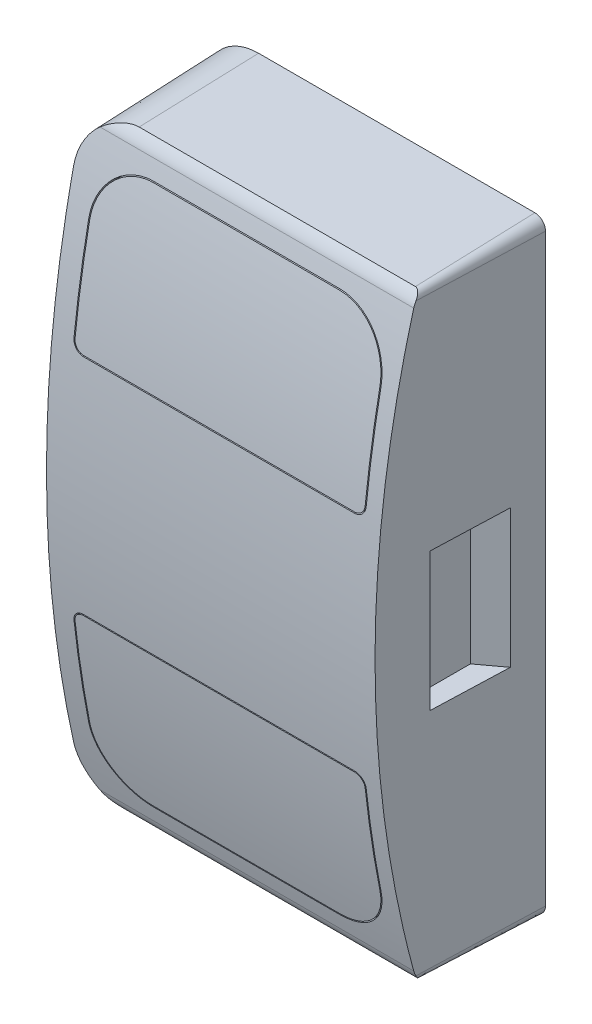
ISO-10303-21;
HEADER;
FILE_DESCRIPTION(('STEP AP214'),'2;1');
FILE_NAME('part.step','',(''),(''),'','','');
FILE_SCHEMA(('AUTOMOTIVE_DESIGN { 1 0 10303 214 1 1 1 1 }'));
ENDSEC;
DATA;
#1=APPLICATION_CONTEXT('core data for automotive mechanical design processes');
#2=APPLICATION_PROTOCOL_DEFINITION('international standard','automotive_design',2000,#1);
#3=PRODUCT_CONTEXT('',#1,'mechanical');
#4=PRODUCT('Part','Part','',(#3));
#5=PRODUCT_RELATED_PRODUCT_CATEGORY('part','',(#4));
#6=PRODUCT_DEFINITION_FORMATION('','',#4);
#7=PRODUCT_DEFINITION_CONTEXT('part definition',#1,'design');
#8=PRODUCT_DEFINITION('design','',#6,#7);
#9=PRODUCT_DEFINITION_SHAPE('','',#8);
#10=(LENGTH_UNIT() NAMED_UNIT(*) SI_UNIT(.MILLI.,.METRE.));
#11=(NAMED_UNIT(*) PLANE_ANGLE_UNIT() SI_UNIT($,.RADIAN.));
#12=(NAMED_UNIT(*) SI_UNIT($,.STERADIAN.) SOLID_ANGLE_UNIT());
#13=UNCERTAINTY_MEASURE_WITH_UNIT(LENGTH_MEASURE(1.E-05),#10,'distance_accuracy_value','');
#14=(GEOMETRIC_REPRESENTATION_CONTEXT(3) GLOBAL_UNCERTAINTY_ASSIGNED_CONTEXT((#13)) GLOBAL_UNIT_ASSIGNED_CONTEXT((#10,
#11,#12)) REPRESENTATION_CONTEXT('',''));
#15=CARTESIAN_POINT('',(0.,0.,0.));
#16=DIRECTION('',(0.,0.,1.));
#17=DIRECTION('',(1.,0.,0.));
#18=AXIS2_PLACEMENT_3D('',#15,#16,#17);
#19=CARTESIAN_POINT('',(14.25,40.1,5.));
#20=DIRECTION('',(0.,-1.,0.));
#21=DIRECTION('',(0.,0.,1.));
#22=AXIS2_PLACEMENT_3D('',#19,#20,#21);
#23=PLANE('',#22);
#24=DIRECTION('',(-1.,0.,0.));
#25=VECTOR('',#24,1.);
#26=CARTESIAN_POINT('',(14.25,40.1,0.));
#27=LINE('',#26,#25);
#28=CARTESIAN_POINT('',(13.5,40.1,0.));
#29=VERTEX_POINT('',#28);
#30=CARTESIAN_POINT('',(0.,40.1,0.));
#31=VERTEX_POINT('',#30);
#32=EDGE_CURVE('E472',#29,#31,#27,.T.);
#33=ORIENTED_EDGE('',*,*,#32,.F.);
#34=DIRECTION('',(0.,0.,-1.));
#35=VECTOR('',#34,1.);
#36=CARTESIAN_POINT('',(13.5,40.1,5.));
#37=LINE('',#36,#35);
#38=CARTESIAN_POINT('',(13.5,40.1,5.));
#39=VERTEX_POINT('',#38);
#40=EDGE_CURVE('E458',#39,#29,#37,.T.);
#41=ORIENTED_EDGE('',*,*,#40,.F.);
#42=DIRECTION('',(-1.,0.,0.));
#43=VECTOR('',#42,1.);
#44=CARTESIAN_POINT('',(14.25,40.1,5.));
#45=LINE('',#44,#43);
#46=CARTESIAN_POINT('',(0.,40.1,5.));
#47=VERTEX_POINT('',#46);
#48=EDGE_CURVE('E467',#39,#47,#45,.T.);
#49=ORIENTED_EDGE('',*,*,#48,.T.);
#50=DIRECTION('',(0.,0.,-1.));
#51=VECTOR('',#50,1.);
#52=CARTESIAN_POINT('',(0.,40.1,5.));
#53=LINE('',#52,#51);
#54=EDGE_CURVE('E1770',#47,#31,#53,.T.);
#55=ORIENTED_EDGE('',*,*,#54,.T.);
#56=EDGE_LOOP('',(#33,#41,#49,#55));
#57=FACE_BOUND('',#56,.T.);
#58=ADVANCED_FACE('F14',(#57),#23,.T.);
#59=CARTESIAN_POINT('',(-0.75,33.9,5.));
#60=DIRECTION('',(0.,1.,0.));
#61=DIRECTION('',(0.,0.,-1.));
#62=AXIS2_PLACEMENT_3D('',#59,#60,#61);
#63=PLANE('',#62);
#64=DIRECTION('',(0.,0.,-1.));
#65=VECTOR('',#64,1.);
#66=CARTESIAN_POINT('',(13.5,33.9,5.));
#67=LINE('',#66,#65);
#68=CARTESIAN_POINT('',(13.5,33.9,5.));
#69=VERTEX_POINT('',#68);
#70=CARTESIAN_POINT('',(13.5,33.9,0.));
#71=VERTEX_POINT('',#70);
#72=EDGE_CURVE('E450',#69,#71,#67,.T.);
#73=ORIENTED_EDGE('',*,*,#72,.T.);
#74=DIRECTION('',(1.,0.,0.));
#75=VECTOR('',#74,1.);
#76=CARTESIAN_POINT('',(-0.75,33.9,0.));
#77=LINE('',#76,#75);
#78=CARTESIAN_POINT('',(0.,33.9,0.));
#79=VERTEX_POINT('',#78);
#80=EDGE_CURVE('E476',#79,#71,#77,.T.);
#81=ORIENTED_EDGE('',*,*,#80,.F.);
#82=DIRECTION('',(0.,0.,-1.));
#83=VECTOR('',#82,1.);
#84=CARTESIAN_POINT('',(0.,33.9,5.));
#85=LINE('',#84,#83);
#86=CARTESIAN_POINT('',(0.,33.9,5.));
#87=VERTEX_POINT('',#86);
#88=EDGE_CURVE('E471',#87,#79,#85,.T.);
#89=ORIENTED_EDGE('',*,*,#88,.F.);
#90=DIRECTION('',(1.,0.,0.));
#91=VECTOR('',#90,1.);
#92=CARTESIAN_POINT('',(-0.75,33.9,5.));
#93=LINE('',#92,#91);
#94=EDGE_CURVE('E466',#87,#69,#93,.T.);
#95=ORIENTED_EDGE('',*,*,#94,.T.);
#96=EDGE_LOOP('',(#73,#81,#89,#95));
#97=FACE_BOUND('',#96,.T.);
#98=ADVANCED_FACE('F470',(#97),#63,.T.);
#99=CARTESIAN_POINT('',(14.25,3.1,5.));
#100=DIRECTION('',(0.,-1.,0.));
#101=DIRECTION('',(0.,0.,1.));
#102=AXIS2_PLACEMENT_3D('',#99,#100,#101);
#103=PLANE('',#102);
#104=DIRECTION('',(-1.,0.,0.));
#105=VECTOR('',#104,1.);
#106=CARTESIAN_POINT('',(14.25,3.1,0.));
#107=LINE('',#106,#105);
#108=CARTESIAN_POINT('',(13.5,3.1,0.));
#109=VERTEX_POINT('',#108);
#110=CARTESIAN_POINT('',(0.,3.1,0.));
#111=VERTEX_POINT('',#110);
#112=EDGE_CURVE('E488',#109,#111,#107,.T.);
#113=ORIENTED_EDGE('',*,*,#112,.F.);
#114=DIRECTION('',(0.,0.,-1.));
#115=VECTOR('',#114,1.);
#116=CARTESIAN_POINT('',(13.5,3.1,5.));
#117=LINE('',#116,#115);
#118=CARTESIAN_POINT('',(13.5,3.1,5.));
#119=VERTEX_POINT('',#118);
#120=EDGE_CURVE('E859',#119,#109,#117,.T.);
#121=ORIENTED_EDGE('',*,*,#120,.F.);
#122=DIRECTION('',(-1.,0.,0.));
#123=VECTOR('',#122,1.);
#124=CARTESIAN_POINT('',(14.25,3.1,5.));
#125=LINE('',#124,#123);
#126=CARTESIAN_POINT('',(0.,3.1,5.));
#127=VERTEX_POINT('',#126);
#128=EDGE_CURVE('E487',#119,#127,#125,.T.);
#129=ORIENTED_EDGE('',*,*,#128,.T.);
#130=DIRECTION('',(0.,0.,-1.));
#131=VECTOR('',#130,1.);
#132=CARTESIAN_POINT('',(0.,3.1,5.));
#133=LINE('',#132,#131);
#134=EDGE_CURVE('E875',#127,#111,#133,.T.);
#135=ORIENTED_EDGE('',*,*,#134,.T.);
#136=EDGE_LOOP('',(#113,#121,#129,#135));
#137=FACE_BOUND('',#136,.T.);
#138=ADVANCED_FACE('F842',(#137),#103,.T.);
#139=CARTESIAN_POINT('',(-0.75,-3.1,5.));
#140=DIRECTION('',(0.,1.,0.));
#141=DIRECTION('',(0.,0.,-1.));
#142=AXIS2_PLACEMENT_3D('',#139,#140,#141);
#143=PLANE('',#142);
#144=DIRECTION('',(0.,0.,-1.));
#145=VECTOR('',#144,1.);
#146=CARTESIAN_POINT('',(13.5,-3.1,5.));
#147=LINE('',#146,#145);
#148=CARTESIAN_POINT('',(13.5,-3.1,5.));
#149=VERTEX_POINT('',#148);
#150=CARTESIAN_POINT('',(13.5,-3.1,0.));
#151=VERTEX_POINT('',#150);
#152=EDGE_CURVE('E853',#149,#151,#147,.T.);
#153=ORIENTED_EDGE('',*,*,#152,.T.);
#154=DIRECTION('',(1.,0.,0.));
#155=VECTOR('',#154,1.);
#156=CARTESIAN_POINT('',(-0.75,-3.1,0.));
#157=LINE('',#156,#155);
#158=CARTESIAN_POINT('',(0.,-3.1,0.));
#159=VERTEX_POINT('',#158);
#160=EDGE_CURVE('E474',#159,#151,#157,.T.);
#161=ORIENTED_EDGE('',*,*,#160,.F.);
#162=DIRECTION('',(0.,0.,-1.));
#163=VECTOR('',#162,1.);
#164=CARTESIAN_POINT('',(0.,-3.1,5.));
#165=LINE('',#164,#163);
#166=CARTESIAN_POINT('',(0.,-3.1,5.));
#167=VERTEX_POINT('',#166);
#168=EDGE_CURVE('E871',#167,#159,#165,.T.);
#169=ORIENTED_EDGE('',*,*,#168,.F.);
#170=DIRECTION('',(1.,0.,0.));
#171=VECTOR('',#170,1.);
#172=CARTESIAN_POINT('',(-0.75,-3.1,5.));
#173=LINE('',#172,#171);
#174=EDGE_CURVE('E484',#167,#149,#173,.T.);
#175=ORIENTED_EDGE('',*,*,#174,.T.);
#176=EDGE_LOOP('',(#153,#161,#169,#175));
#177=FACE_BOUND('',#176,.T.);
#178=ADVANCED_FACE('F808',(#177),#143,.T.);
#179=CARTESIAN_POINT('',(15.25,35.5,10.));
#180=DIRECTION('',(0.,0.,1.));
#181=DIRECTION('',(0.,1.,0.));
#182=AXIS2_PLACEMENT_3D('',#179,#180,#181);
#183=PLANE('',#182);
#184=CARTESIAN_POINT('',(14.5,38.5,10.));
#185=DIRECTION('',(0.,0.,1.));
#186=DIRECTION('',(0.,-1.,0.));
#187=AXIS2_PLACEMENT_3D('',#184,#185,#186);
#188=CIRCLE('',#187,5.);
#189=CARTESIAN_POINT('',(19.5,38.5,10.));
#190=VERTEX_POINT('',#189);
#191=CARTESIAN_POINT('',(14.5,43.5,10.));
#192=VERTEX_POINT('',#191);
#193=EDGE_CURVE('E877',#190,#192,#188,.T.);
#194=ORIENTED_EDGE('',*,*,#193,.F.);
#195=DIRECTION('',(0.,1.,0.));
#196=VECTOR('',#195,1.);
#197=CARTESIAN_POINT('',(19.5,38.5,10.));
#198=LINE('',#197,#196);
#199=CARTESIAN_POINT('',(19.5,35.5,10.));
#200=VERTEX_POINT('',#199);
#201=EDGE_CURVE('E883',#200,#190,#198,.T.);
#202=ORIENTED_EDGE('',*,*,#201,.F.);
#203=CARTESIAN_POINT('',(14.5,35.5,10.));
#204=DIRECTION('',(0.,0.,1.));
#205=DIRECTION('',(0.,-1.,0.));
#206=AXIS2_PLACEMENT_3D('',#203,#204,#205);
#207=CIRCLE('',#206,5.);
#208=CARTESIAN_POINT('',(14.5,30.5,10.));
#209=VERTEX_POINT('',#208);
#210=EDGE_CURVE('E891',#209,#200,#207,.T.);
#211=ORIENTED_EDGE('',*,*,#210,.F.);
#212=DIRECTION('',(1.,0.,0.));
#213=VECTOR('',#212,1.);
#214=CARTESIAN_POINT('',(-1.75,30.5,10.));
#215=LINE('',#214,#213);
#216=CARTESIAN_POINT('',(-1.,30.5,10.));
#217=VERTEX_POINT('',#216);
#218=EDGE_CURVE('E1192',#217,#209,#215,.T.);
#219=ORIENTED_EDGE('',*,*,#218,.F.);
#220=CARTESIAN_POINT('',(-1.,35.5,10.));
#221=DIRECTION('',(0.,0.,1.));
#222=DIRECTION('',(0.,-1.,0.));
#223=AXIS2_PLACEMENT_3D('',#220,#221,#222);
#224=CIRCLE('',#223,5.);
#225=CARTESIAN_POINT('',(-6.,35.5,10.));
#226=VERTEX_POINT('',#225);
#227=EDGE_CURVE('E909',#226,#217,#224,.T.);
#228=ORIENTED_EDGE('',*,*,#227,.F.);
#229=DIRECTION('',(0.,-1.,0.));
#230=VECTOR('',#229,1.);
#231=CARTESIAN_POINT('',(-6.,38.5,10.));
#232=LINE('',#231,#230);
#233=CARTESIAN_POINT('',(-6.,38.5,10.));
#234=VERTEX_POINT('',#233);
#235=EDGE_CURVE('E918',#234,#226,#232,.T.);
#236=ORIENTED_EDGE('',*,*,#235,.F.);
#237=CARTESIAN_POINT('',(-1.,38.5,10.));
#238=DIRECTION('',(0.,0.,1.));
#239=DIRECTION('',(0.,-1.,0.));
#240=AXIS2_PLACEMENT_3D('',#237,#238,#239);
#241=CIRCLE('',#240,5.);
#242=CARTESIAN_POINT('',(-1.,43.5,10.));
#243=VERTEX_POINT('',#242);
#244=EDGE_CURVE('E904',#243,#234,#241,.T.);
#245=ORIENTED_EDGE('',*,*,#244,.F.);
#246=DIRECTION('',(-1.,0.,0.));
#247=VECTOR('',#246,1.);
#248=CARTESIAN_POINT('',(15.25,43.5,10.));
#249=LINE('',#248,#247);
#250=EDGE_CURVE('E1195',#192,#243,#249,.T.);
#251=ORIENTED_EDGE('',*,*,#250,.F.);
#252=EDGE_LOOP('',(#194,#202,#211,#219,#228,#236,#245,#251));
#253=FACE_BOUND('',#252,.T.);
#254=ADVANCED_FACE('F805',(#253),#183,.F.);
#255=CARTESIAN_POINT('',(15.25,35.5,5.));
#256=DIRECTION('',(0.,0.,1.));
#257=DIRECTION('',(0.,1.,0.));
#258=AXIS2_PLACEMENT_3D('',#255,#256,#257);
#259=PLANE('',#258);
#260=CARTESIAN_POINT('',(13.5,37.,5.));
#261=DIRECTION('',(0.,0.,1.));
#262=DIRECTION('',(0.,-1.,0.));
#263=AXIS2_PLACEMENT_3D('',#260,#261,#262);
#264=CIRCLE('',#263,3.1);
#265=EDGE_CURVE('E453',#69,#39,#264,.T.);
#266=ORIENTED_EDGE('',*,*,#265,.F.);
#267=ORIENTED_EDGE('',*,*,#94,.F.);
#268=CARTESIAN_POINT('',(0.,37.,5.));
#269=DIRECTION('',(0.,0.,1.));
#270=DIRECTION('',(0.,-1.,0.));
#271=AXIS2_PLACEMENT_3D('',#268,#269,#270);
#272=CIRCLE('',#271,3.1);
#273=EDGE_CURVE('E1771',#47,#87,#272,.T.);
#274=ORIENTED_EDGE('',*,*,#273,.F.);
#275=ORIENTED_EDGE('',*,*,#48,.F.);
#276=EDGE_LOOP('',(#266,#267,#274,#275));
#277=FACE_BOUND('',#276,.T.);
#278=DIRECTION('',(0.,1.,0.));
#279=VECTOR('',#278,1.);
#280=CARTESIAN_POINT('',(19.5,38.5,5.));
#281=LINE('',#280,#279);
#282=CARTESIAN_POINT('',(19.5,35.5,5.));
#283=VERTEX_POINT('',#282);
#284=CARTESIAN_POINT('',(19.5,38.5,5.));
#285=VERTEX_POINT('',#284);
#286=EDGE_CURVE('E886',#283,#285,#281,.T.);
#287=ORIENTED_EDGE('',*,*,#286,.T.);
#288=CARTESIAN_POINT('',(14.5,38.5,5.));
#289=DIRECTION('',(0.,0.,1.));
#290=DIRECTION('',(0.,-1.,0.));
#291=AXIS2_PLACEMENT_3D('',#288,#289,#290);
#292=CIRCLE('',#291,5.);
#293=CARTESIAN_POINT('',(14.5,43.5,5.));
#294=VERTEX_POINT('',#293);
#295=EDGE_CURVE('E879',#285,#294,#292,.T.);
#296=ORIENTED_EDGE('',*,*,#295,.T.);
#297=DIRECTION('',(-1.,0.,0.));
#298=VECTOR('',#297,1.);
#299=CARTESIAN_POINT('',(15.25,43.5,5.));
#300=LINE('',#299,#298);
#301=CARTESIAN_POINT('',(-1.,43.5,5.));
#302=VERTEX_POINT('',#301);
#303=EDGE_CURVE('E1196',#294,#302,#300,.T.);
#304=ORIENTED_EDGE('',*,*,#303,.T.);
#305=CARTESIAN_POINT('',(-1.,38.5,5.));
#306=DIRECTION('',(0.,0.,1.));
#307=DIRECTION('',(0.,-1.,0.));
#308=AXIS2_PLACEMENT_3D('',#305,#306,#307);
#309=CIRCLE('',#308,5.);
#310=CARTESIAN_POINT('',(-6.,38.5,5.));
#311=VERTEX_POINT('',#310);
#312=EDGE_CURVE('E905',#302,#311,#309,.T.);
#313=ORIENTED_EDGE('',*,*,#312,.T.);
#314=DIRECTION('',(0.,-1.,0.));
#315=VECTOR('',#314,1.);
#316=CARTESIAN_POINT('',(-6.,38.5,5.));
#317=LINE('',#316,#315);
#318=CARTESIAN_POINT('',(-6.,35.5,5.));
#319=VERTEX_POINT('',#318);
#320=EDGE_CURVE('E908',#311,#319,#317,.T.);
#321=ORIENTED_EDGE('',*,*,#320,.T.);
#322=CARTESIAN_POINT('',(-1.,35.5,5.));
#323=DIRECTION('',(0.,0.,1.));
#324=DIRECTION('',(0.,-1.,0.));
#325=AXIS2_PLACEMENT_3D('',#322,#323,#324);
#326=CIRCLE('',#325,5.);
#327=CARTESIAN_POINT('',(-1.,30.5,5.));
#328=VERTEX_POINT('',#327);
#329=EDGE_CURVE('E912',#319,#328,#326,.T.);
#330=ORIENTED_EDGE('',*,*,#329,.T.);
#331=DIRECTION('',(1.,0.,0.));
#332=VECTOR('',#331,1.);
#333=CARTESIAN_POINT('',(-1.75,30.5,5.));
#334=LINE('',#333,#332);
#335=CARTESIAN_POINT('',(14.5,30.5,5.));
#336=VERTEX_POINT('',#335);
#337=EDGE_CURVE('E1191',#328,#336,#334,.T.);
#338=ORIENTED_EDGE('',*,*,#337,.T.);
#339=CARTESIAN_POINT('',(14.5,35.5,5.));
#340=DIRECTION('',(0.,0.,1.));
#341=DIRECTION('',(0.,-1.,0.));
#342=AXIS2_PLACEMENT_3D('',#339,#340,#341);
#343=CIRCLE('',#342,5.);
#344=EDGE_CURVE('E882',#336,#283,#343,.T.);
#345=ORIENTED_EDGE('',*,*,#344,.T.);
#346=EDGE_LOOP('',(#287,#296,#304,#313,#321,#330,#338,#345));
#347=FACE_BOUND('',#346,.T.);
#348=ADVANCED_FACE('F463',(#277,#347),#259,.T.);
#349=CARTESIAN_POINT('',(15.25,43.5,10.));
#350=DIRECTION('',(0.,-1.,0.));
#351=DIRECTION('',(0.,0.,1.));
#352=AXIS2_PLACEMENT_3D('',#349,#350,#351);
#353=PLANE('',#352);
#354=ORIENTED_EDGE('',*,*,#303,.F.);
#355=DIRECTION('',(0.,0.,1.));
#356=VECTOR('',#355,1.);
#357=CARTESIAN_POINT('',(14.5,43.5,5.));
#358=LINE('',#357,#356);
#359=EDGE_CURVE('E901',#294,#192,#358,.T.);
#360=ORIENTED_EDGE('',*,*,#359,.T.);
#361=ORIENTED_EDGE('',*,*,#250,.T.);
#362=DIRECTION('',(0.,0.,1.));
#363=VECTOR('',#362,1.);
#364=CARTESIAN_POINT('',(-1.,43.5,5.));
#365=LINE('',#364,#363);
#366=EDGE_CURVE('E915',#302,#243,#365,.T.);
#367=ORIENTED_EDGE('',*,*,#366,.F.);
#368=EDGE_LOOP('',(#354,#360,#361,#367));
#369=FACE_BOUND('',#368,.T.);
#370=ADVANCED_FACE('F812',(#369),#353,.T.);
#371=CARTESIAN_POINT('',(-1.75,30.5,10.));
#372=DIRECTION('',(0.,1.,0.));
#373=DIRECTION('',(0.,0.,-1.));
#374=AXIS2_PLACEMENT_3D('',#371,#372,#373);
#375=PLANE('',#374);
#376=DIRECTION('',(0.,0.,1.));
#377=VECTOR('',#376,1.);
#378=CARTESIAN_POINT('',(14.5,30.5,5.));
#379=LINE('',#378,#377);
#380=EDGE_CURVE('E899',#336,#209,#379,.T.);
#381=ORIENTED_EDGE('',*,*,#380,.F.);
#382=ORIENTED_EDGE('',*,*,#337,.F.);
#383=DIRECTION('',(0.,0.,1.));
#384=VECTOR('',#383,1.);
#385=CARTESIAN_POINT('',(-1.,30.5,5.));
#386=LINE('',#385,#384);
#387=EDGE_CURVE('E923',#328,#217,#386,.T.);
#388=ORIENTED_EDGE('',*,*,#387,.T.);
#389=ORIENTED_EDGE('',*,*,#218,.T.);
#390=EDGE_LOOP('',(#381,#382,#388,#389));
#391=FACE_BOUND('',#390,.T.);
#392=ADVANCED_FACE('F815',(#391),#375,.T.);
#393=CARTESIAN_POINT('',(15.25,-1.5,10.));
#394=DIRECTION('',(0.,0.,1.));
#395=DIRECTION('',(0.,1.,0.));
#396=AXIS2_PLACEMENT_3D('',#393,#394,#395);
#397=PLANE('',#396);
#398=CARTESIAN_POINT('',(14.5,1.5,10.));
#399=DIRECTION('',(0.,0.,1.));
#400=DIRECTION('',(0.,-1.,0.));
#401=AXIS2_PLACEMENT_3D('',#398,#399,#400);
#402=CIRCLE('',#401,5.);
#403=CARTESIAN_POINT('',(19.5,1.5,10.));
#404=VERTEX_POINT('',#403);
#405=CARTESIAN_POINT('',(14.5,6.5,10.));
#406=VERTEX_POINT('',#405);
#407=EDGE_CURVE('E931',#404,#406,#402,.T.);
#408=ORIENTED_EDGE('',*,*,#407,.F.);
#409=DIRECTION('',(0.,1.,0.));
#410=VECTOR('',#409,1.);
#411=CARTESIAN_POINT('',(19.5,1.5,10.));
#412=LINE('',#411,#410);
#413=CARTESIAN_POINT('',(19.5,-1.5,10.));
#414=VERTEX_POINT('',#413);
#415=EDGE_CURVE('E936',#414,#404,#412,.T.);
#416=ORIENTED_EDGE('',*,*,#415,.F.);
#417=CARTESIAN_POINT('',(14.5,-1.5,10.));
#418=DIRECTION('',(0.,0.,1.));
#419=DIRECTION('',(0.,-1.,0.));
#420=AXIS2_PLACEMENT_3D('',#417,#418,#419);
#421=CIRCLE('',#420,5.);
#422=CARTESIAN_POINT('',(14.5,-6.5,10.));
#423=VERTEX_POINT('',#422);
#424=EDGE_CURVE('E944',#423,#414,#421,.T.);
#425=ORIENTED_EDGE('',*,*,#424,.F.);
#426=DIRECTION('',(1.,0.,0.));
#427=VECTOR('',#426,1.);
#428=CARTESIAN_POINT('',(-1.75,-6.5,10.));
#429=LINE('',#428,#427);
#430=CARTESIAN_POINT('',(-1.,-6.5,10.));
#431=VERTEX_POINT('',#430);
#432=EDGE_CURVE('E1202',#431,#423,#429,.T.);
#433=ORIENTED_EDGE('',*,*,#432,.F.);
#434=CARTESIAN_POINT('',(-1.,-1.5,10.));
#435=DIRECTION('',(0.,0.,1.));
#436=DIRECTION('',(0.,-1.,0.));
#437=AXIS2_PLACEMENT_3D('',#434,#435,#436);
#438=CIRCLE('',#437,5.);
#439=CARTESIAN_POINT('',(-6.,-1.5,10.));
#440=VERTEX_POINT('',#439);
#441=EDGE_CURVE('E962',#440,#431,#438,.T.);
#442=ORIENTED_EDGE('',*,*,#441,.F.);
#443=DIRECTION('',(0.,-1.,0.));
#444=VECTOR('',#443,1.);
#445=CARTESIAN_POINT('',(-6.,1.5,10.));
#446=LINE('',#445,#444);
#447=CARTESIAN_POINT('',(-6.,1.5,10.));
#448=VERTEX_POINT('',#447);
#449=EDGE_CURVE('E971',#448,#440,#446,.T.);
#450=ORIENTED_EDGE('',*,*,#449,.F.);
#451=CARTESIAN_POINT('',(-1.,1.5,10.));
#452=DIRECTION('',(0.,0.,1.));
#453=DIRECTION('',(0.,-1.,0.));
#454=AXIS2_PLACEMENT_3D('',#451,#452,#453);
#455=CIRCLE('',#454,5.);
#456=CARTESIAN_POINT('',(-1.,6.5,10.));
#457=VERTEX_POINT('',#456);
#458=EDGE_CURVE('E957',#457,#448,#455,.T.);
#459=ORIENTED_EDGE('',*,*,#458,.F.);
#460=DIRECTION('',(-1.,0.,0.));
#461=VECTOR('',#460,1.);
#462=CARTESIAN_POINT('',(15.25,6.5,10.));
#463=LINE('',#462,#461);
#464=EDGE_CURVE('E482',#406,#457,#463,.T.);
#465=ORIENTED_EDGE('',*,*,#464,.F.);
#466=EDGE_LOOP('',(#408,#416,#425,#433,#442,#450,#459,#465));
#467=FACE_BOUND('',#466,.T.);
#468=ADVANCED_FACE('F819',(#467),#397,.F.);
#469=CARTESIAN_POINT('',(15.25,-1.5,5.));
#470=DIRECTION('',(0.,0.,1.));
#471=DIRECTION('',(0.,1.,0.));
#472=AXIS2_PLACEMENT_3D('',#469,#470,#471);
#473=PLANE('',#472);
#474=CARTESIAN_POINT('',(13.5,0.,5.));
#475=DIRECTION('',(0.,0.,1.));
#476=DIRECTION('',(0.,-1.,0.));
#477=AXIS2_PLACEMENT_3D('',#474,#475,#476);
#478=CIRCLE('',#477,3.1);
#479=EDGE_CURVE('E1775',#149,#119,#478,.T.);
#480=ORIENTED_EDGE('',*,*,#479,.F.);
#481=ORIENTED_EDGE('',*,*,#174,.F.);
#482=CARTESIAN_POINT('',(0.,0.,5.));
#483=DIRECTION('',(0.,0.,1.));
#484=DIRECTION('',(0.,-1.,0.));
#485=AXIS2_PLACEMENT_3D('',#482,#483,#484);
#486=CIRCLE('',#485,3.1);
#487=EDGE_CURVE('E869',#127,#167,#486,.T.);
#488=ORIENTED_EDGE('',*,*,#487,.F.);
#489=ORIENTED_EDGE('',*,*,#128,.F.);
#490=EDGE_LOOP('',(#480,#481,#488,#489));
#491=FACE_BOUND('',#490,.T.);
#492=DIRECTION('',(0.,1.,0.));
#493=VECTOR('',#492,1.);
#494=CARTESIAN_POINT('',(19.5,1.5,5.));
#495=LINE('',#494,#493);
#496=CARTESIAN_POINT('',(19.5,-1.5,5.));
#497=VERTEX_POINT('',#496);
#498=CARTESIAN_POINT('',(19.5,1.5,5.));
#499=VERTEX_POINT('',#498);
#500=EDGE_CURVE('E939',#497,#499,#495,.T.);
#501=ORIENTED_EDGE('',*,*,#500,.T.);
#502=CARTESIAN_POINT('',(14.5,1.5,5.));
#503=DIRECTION('',(0.,0.,1.));
#504=DIRECTION('',(0.,-1.,0.));
#505=AXIS2_PLACEMENT_3D('',#502,#503,#504);
#506=CIRCLE('',#505,5.);
#507=CARTESIAN_POINT('',(14.5,6.5,5.));
#508=VERTEX_POINT('',#507);
#509=EDGE_CURVE('E932',#499,#508,#506,.T.);
#510=ORIENTED_EDGE('',*,*,#509,.T.);
#511=DIRECTION('',(-1.,0.,0.));
#512=VECTOR('',#511,1.);
#513=CARTESIAN_POINT('',(15.25,6.5,5.));
#514=LINE('',#513,#512);
#515=CARTESIAN_POINT('',(-1.,6.5,5.));
#516=VERTEX_POINT('',#515);
#517=EDGE_CURVE('E479',#508,#516,#514,.T.);
#518=ORIENTED_EDGE('',*,*,#517,.T.);
#519=CARTESIAN_POINT('',(-1.,1.5,5.));
#520=DIRECTION('',(0.,0.,1.));
#521=DIRECTION('',(0.,-1.,0.));
#522=AXIS2_PLACEMENT_3D('',#519,#520,#521);
#523=CIRCLE('',#522,5.);
#524=CARTESIAN_POINT('',(-6.,1.5,5.));
#525=VERTEX_POINT('',#524);
#526=EDGE_CURVE('E958',#516,#525,#523,.T.);
#527=ORIENTED_EDGE('',*,*,#526,.T.);
#528=DIRECTION('',(0.,-1.,0.));
#529=VECTOR('',#528,1.);
#530=CARTESIAN_POINT('',(-6.,1.5,5.));
#531=LINE('',#530,#529);
#532=CARTESIAN_POINT('',(-6.,-1.5,5.));
#533=VERTEX_POINT('',#532);
#534=EDGE_CURVE('E961',#525,#533,#531,.T.);
#535=ORIENTED_EDGE('',*,*,#534,.T.);
#536=CARTESIAN_POINT('',(-1.,-1.5,5.));
#537=DIRECTION('',(0.,0.,1.));
#538=DIRECTION('',(0.,-1.,0.));
#539=AXIS2_PLACEMENT_3D('',#536,#537,#538);
#540=CIRCLE('',#539,5.);
#541=CARTESIAN_POINT('',(-1.,-6.5,5.));
#542=VERTEX_POINT('',#541);
#543=EDGE_CURVE('E965',#533,#542,#540,.T.);
#544=ORIENTED_EDGE('',*,*,#543,.T.);
#545=DIRECTION('',(1.,0.,0.));
#546=VECTOR('',#545,1.);
#547=CARTESIAN_POINT('',(-1.75,-6.5,5.));
#548=LINE('',#547,#546);
#549=CARTESIAN_POINT('',(14.5,-6.5,5.));
#550=VERTEX_POINT('',#549);
#551=EDGE_CURVE('E1198',#542,#550,#548,.T.);
#552=ORIENTED_EDGE('',*,*,#551,.T.);
#553=CARTESIAN_POINT('',(14.5,-1.5,5.));
#554=DIRECTION('',(0.,0.,1.));
#555=DIRECTION('',(0.,-1.,0.));
#556=AXIS2_PLACEMENT_3D('',#553,#554,#555);
#557=CIRCLE('',#556,5.);
#558=EDGE_CURVE('E935',#550,#497,#557,.T.);
#559=ORIENTED_EDGE('',*,*,#558,.T.);
#560=EDGE_LOOP('',(#501,#510,#518,#527,#535,#544,#552,#559));
#561=FACE_BOUND('',#560,.T.);
#562=ADVANCED_FACE('F823',(#491,#561),#473,.T.);
#563=CARTESIAN_POINT('',(15.25,6.5,10.));
#564=DIRECTION('',(0.,-1.,0.));
#565=DIRECTION('',(0.,0.,1.));
#566=AXIS2_PLACEMENT_3D('',#563,#564,#565);
#567=PLANE('',#566);
#568=ORIENTED_EDGE('',*,*,#517,.F.);
#569=DIRECTION('',(0.,0.,1.));
#570=VECTOR('',#569,1.);
#571=CARTESIAN_POINT('',(14.5,6.5,5.));
#572=LINE('',#571,#570);
#573=EDGE_CURVE('E954',#508,#406,#572,.T.);
#574=ORIENTED_EDGE('',*,*,#573,.T.);
#575=ORIENTED_EDGE('',*,*,#464,.T.);
#576=DIRECTION('',(0.,0.,1.));
#577=VECTOR('',#576,1.);
#578=CARTESIAN_POINT('',(-1.,6.5,5.));
#579=LINE('',#578,#577);
#580=EDGE_CURVE('E968',#516,#457,#579,.T.);
#581=ORIENTED_EDGE('',*,*,#580,.F.);
#582=EDGE_LOOP('',(#568,#574,#575,#581));
#583=FACE_BOUND('',#582,.T.);
#584=ADVANCED_FACE('F827',(#583),#567,.T.);
#585=CARTESIAN_POINT('',(-1.75,-6.5,10.));
#586=DIRECTION('',(0.,1.,0.));
#587=DIRECTION('',(0.,0.,-1.));
#588=AXIS2_PLACEMENT_3D('',#585,#586,#587);
#589=PLANE('',#588);
#590=DIRECTION('',(0.,0.,1.));
#591=VECTOR('',#590,1.);
#592=CARTESIAN_POINT('',(14.5,-6.5,5.));
#593=LINE('',#592,#591);
#594=EDGE_CURVE('E952',#550,#423,#593,.T.);
#595=ORIENTED_EDGE('',*,*,#594,.F.);
#596=ORIENTED_EDGE('',*,*,#551,.F.);
#597=DIRECTION('',(0.,0.,1.));
#598=VECTOR('',#597,1.);
#599=CARTESIAN_POINT('',(-1.,-6.5,5.));
#600=LINE('',#599,#598);
#601=EDGE_CURVE('E976',#542,#431,#600,.T.);
#602=ORIENTED_EDGE('',*,*,#601,.T.);
#603=ORIENTED_EDGE('',*,*,#432,.T.);
#604=EDGE_LOOP('',(#595,#596,#602,#603));
#605=FACE_BOUND('',#604,.T.);
#606=ADVANCED_FACE('F831',(#605),#589,.T.);
#607=CARTESIAN_POINT('',(22.75,-9.,0.));
#608=DIRECTION('',(0.999390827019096,0.,0.0348994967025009));
#609=DIRECTION('',(-0.0348994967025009,0.,0.999390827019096));
#610=AXIS2_PLACEMENT_3D('',#607,#608,#609);
#611=PLANE('',#610);
#612=DIRECTION('',(0.0348994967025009,0.,-0.999390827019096));
#613=VECTOR('',#612,1.);
#614=CARTESIAN_POINT('',(22.75,46.,0.));
#615=LINE('',#614,#613);
#616=CARTESIAN_POINT('',(22.3385621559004,46.,11.782038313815));
#617=VERTEX_POINT('',#616);
#618=CARTESIAN_POINT('',(22.75,46.,0.));
#619=VERTEX_POINT('',#618);
#620=EDGE_CURVE('E1365',#617,#619,#615,.T.);
#621=ORIENTED_EDGE('',*,*,#620,.F.);
#622=CARTESIAN_POINT('',(22.3990467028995,45.,10.0499875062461));
#623=DIRECTION('',(0.999390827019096,0.,0.0348994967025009));
#624=DIRECTION('',(0.0348994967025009,0.,-0.999390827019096));
#625=AXIS2_PLACEMENT_3D('',#622,#623,#624);
#626=ELLIPSE('',#625,2.00121908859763,2.);
#627=CARTESIAN_POINT('',(22.3315332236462,45.512077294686,11.9833205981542));
#628=VERTEX_POINT('',#627);
#629=EDGE_CURVE('E1328',#617,#628,#626,.T.);
#630=ORIENTED_EDGE('',*,*,#629,.T.);
#631=CARTESIAN_POINT('',(25.8928692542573,18.5,-90.));
#632=DIRECTION('',(0.999390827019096,0.,0.0348994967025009));
#633=DIRECTION('',(0.0348994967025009,0.,-0.999390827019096));
#634=AXIS2_PLACEMENT_3D('',#631,#632,#633);
#635=ELLIPSE('',#634,105.564306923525,105.5);
#636=CARTESIAN_POINT('',(22.3315332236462,-8.512077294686,11.9833205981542));
#637=VERTEX_POINT('',#636);
#638=EDGE_CURVE('E503',#628,#637,#635,.T.);
#639=ORIENTED_EDGE('',*,*,#638,.T.);
#640=CARTESIAN_POINT('',(22.3990467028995,-8.,10.0499875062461));
#641=DIRECTION('',(0.999390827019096,0.,0.0348994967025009));
#642=DIRECTION('',(0.0348994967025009,0.,-0.999390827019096));
#643=AXIS2_PLACEMENT_3D('',#640,#641,#642);
#644=ELLIPSE('',#643,2.00121908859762,2.);
#645=CARTESIAN_POINT('',(22.3385621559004,-9.,11.782038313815));
#646=VERTEX_POINT('',#645);
#647=EDGE_CURVE('E1419',#637,#646,#644,.T.);
#648=ORIENTED_EDGE('',*,*,#647,.T.);
#649=DIRECTION('',(0.0348994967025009,0.,-0.999390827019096));
#650=VECTOR('',#649,1.);
#651=CARTESIAN_POINT('',(22.75,-9.,0.));
#652=LINE('',#651,#650);
#653=CARTESIAN_POINT('',(22.75,-9.,0.));
#654=VERTEX_POINT('',#653);
#655=EDGE_CURVE('E1361',#646,#654,#652,.T.);
#656=ORIENTED_EDGE('',*,*,#655,.T.);
#657=DIRECTION('',(0.,1.,0.));
#658=VECTOR('',#657,1.);
#659=CARTESIAN_POINT('',(22.75,-9.,0.));
#660=LINE('',#659,#658);
#661=EDGE_CURVE('E1339',#654,#619,#660,.T.);
#662=ORIENTED_EDGE('',*,*,#661,.T.);
#663=EDGE_LOOP('',(#621,#630,#639,#648,#656,#662));
#664=FACE_BOUND('',#663,.T.);
#665=DIRECTION('',(-0.0348994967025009,0.,0.999390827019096));
#666=VECTOR('',#665,1.);
#667=CARTESIAN_POINT('',(22.75,12.,0.));
#668=LINE('',#667,#666);
#669=CARTESIAN_POINT('',(22.3830462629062,12.,10.5081801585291));
#670=VERTEX_POINT('',#669);
#671=CARTESIAN_POINT('',(22.6381468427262,12.,3.203055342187));
#672=VERTEX_POINT('',#671);
#673=EDGE_CURVE('E9',#670,#672,#668,.F.);
#674=ORIENTED_EDGE('',*,*,#673,.F.);
#675=DIRECTION('',(0.,1.,0.));
#676=VECTOR('',#675,1.);
#677=CARTESIAN_POINT('',(22.3830462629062,-9.,10.5081801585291));
#678=LINE('',#677,#676);
#679=CARTESIAN_POINT('',(22.3830462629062,25.,10.5081801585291));
#680=VERTEX_POINT('',#679);
#681=EDGE_CURVE('E1285',#680,#670,#678,.F.);
#682=ORIENTED_EDGE('',*,*,#681,.F.);
#683=DIRECTION('',(-0.0348994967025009,0.,0.999390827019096));
#684=VECTOR('',#683,1.);
#685=CARTESIAN_POINT('',(22.75,25.,0.));
#686=LINE('',#685,#684);
#687=CARTESIAN_POINT('',(22.6381468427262,25.,3.203055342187));
#688=VERTEX_POINT('',#687);
#689=EDGE_CURVE('E1282',#680,#688,#686,.F.);
#690=ORIENTED_EDGE('',*,*,#689,.T.);
#691=DIRECTION('',(0.,-1.,0.));
#692=VECTOR('',#691,1.);
#693=CARTESIAN_POINT('',(22.6381468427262,-9.,3.203055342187));
#694=LINE('',#693,#692);
#695=EDGE_CURVE('E23',#672,#688,#694,.F.);
#696=ORIENTED_EDGE('',*,*,#695,.F.);
#697=EDGE_LOOP('',(#674,#682,#690,#696));
#698=FACE_BOUND('',#697,.T.);
#699=ADVANCED_FACE('F835',(#664,#698),#611,.T.);
#700=CARTESIAN_POINT('',(21.75,-9.,0.));
#701=DIRECTION('',(0.,0.,1.));
#702=DIRECTION('',(0.,1.,0.));
#703=AXIS2_PLACEMENT_3D('',#700,#701,#702);
#704=PLANE('',#703);
#705=ORIENTED_EDGE('',*,*,#80,.T.);
#706=CARTESIAN_POINT('',(13.5,37.,0.));
#707=DIRECTION('',(0.,0.,1.));
#708=DIRECTION('',(0.,-1.,0.));
#709=AXIS2_PLACEMENT_3D('',#706,#707,#708);
#710=CIRCLE('',#709,3.1);
#711=EDGE_CURVE('E30',#71,#29,#710,.T.);
#712=ORIENTED_EDGE('',*,*,#711,.T.);
#713=ORIENTED_EDGE('',*,*,#32,.T.);
#714=CARTESIAN_POINT('',(0.,37.,0.));
#715=DIRECTION('',(0.,0.,1.));
#716=DIRECTION('',(0.,-1.,0.));
#717=AXIS2_PLACEMENT_3D('',#714,#715,#716);
#718=CIRCLE('',#717,3.1);
#719=EDGE_CURVE('E1768',#31,#79,#718,.T.);
#720=ORIENTED_EDGE('',*,*,#719,.T.);
#721=EDGE_LOOP('',(#705,#712,#713,#720));
#722=FACE_BOUND('',#721,.T.);
#723=ORIENTED_EDGE('',*,*,#160,.T.);
#724=CARTESIAN_POINT('',(13.5,0.,0.));
#725=DIRECTION('',(0.,0.,1.));
#726=DIRECTION('',(0.,-1.,0.));
#727=AXIS2_PLACEMENT_3D('',#724,#725,#726);
#728=CIRCLE('',#727,3.1);
#729=EDGE_CURVE('E38',#151,#109,#728,.T.);
#730=ORIENTED_EDGE('',*,*,#729,.T.);
#731=ORIENTED_EDGE('',*,*,#112,.T.);
#732=CARTESIAN_POINT('',(0.,0.,0.));
#733=DIRECTION('',(0.,0.,1.));
#734=DIRECTION('',(0.,-1.,0.));
#735=AXIS2_PLACEMENT_3D('',#732,#733,#734);
#736=CIRCLE('',#735,3.1);
#737=EDGE_CURVE('E858',#111,#159,#736,.T.);
#738=ORIENTED_EDGE('',*,*,#737,.T.);
#739=EDGE_LOOP('',(#723,#730,#731,#738));
#740=FACE_BOUND('',#739,.T.);
#741=DIRECTION('',(1.,0.,0.));
#742=VECTOR('',#741,1.);
#743=CARTESIAN_POINT('',(-4.25,-10.,0.));
#744=LINE('',#743,#742);
#745=CARTESIAN_POINT('',(-4.25,-10.,0.));
#746=VERTEX_POINT('',#745);
#747=CARTESIAN_POINT('',(21.75,-10.,0.));
#748=VERTEX_POINT('',#747);
#749=EDGE_CURVE('E1333',#746,#748,#744,.T.);
#750=ORIENTED_EDGE('',*,*,#749,.F.);
#751=CARTESIAN_POINT('',(-4.25,-5.,0.));
#752=DIRECTION('',(0.,0.,1.));
#753=DIRECTION('',(0.,1.,0.));
#754=AXIS2_PLACEMENT_3D('',#751,#752,#753);
#755=CIRCLE('',#754,5.);
#756=CARTESIAN_POINT('',(-9.25,-5.,0.));
#757=VERTEX_POINT('',#756);
#758=EDGE_CURVE('E1354',#757,#746,#755,.T.);
#759=ORIENTED_EDGE('',*,*,#758,.F.);
#760=DIRECTION('',(0.,-1.,0.));
#761=VECTOR('',#760,1.);
#762=CARTESIAN_POINT('',(-9.25,42.,0.));
#763=LINE('',#762,#761);
#764=CARTESIAN_POINT('',(-9.25,42.,0.));
#765=VERTEX_POINT('',#764);
#766=EDGE_CURVE('E1351',#765,#757,#763,.T.);
#767=ORIENTED_EDGE('',*,*,#766,.F.);
#768=CARTESIAN_POINT('',(-4.25,42.,0.));
#769=DIRECTION('',(0.,0.,1.));
#770=DIRECTION('',(0.,1.,0.));
#771=AXIS2_PLACEMENT_3D('',#768,#769,#770);
#772=CIRCLE('',#771,5.);
#773=CARTESIAN_POINT('',(-4.25,47.,0.));
#774=VERTEX_POINT('',#773);
#775=EDGE_CURVE('E1348',#774,#765,#772,.T.);
#776=ORIENTED_EDGE('',*,*,#775,.F.);
#777=DIRECTION('',(-1.,0.,0.));
#778=VECTOR('',#777,1.);
#779=CARTESIAN_POINT('',(21.75,47.,0.));
#780=LINE('',#779,#778);
#781=CARTESIAN_POINT('',(21.75,47.,0.));
#782=VERTEX_POINT('',#781);
#783=EDGE_CURVE('E1345',#782,#774,#780,.T.);
#784=ORIENTED_EDGE('',*,*,#783,.F.);
#785=CARTESIAN_POINT('',(21.75,46.,0.));
#786=DIRECTION('',(0.,0.,1.));
#787=DIRECTION('',(0.,1.,0.));
#788=AXIS2_PLACEMENT_3D('',#785,#786,#787);
#789=CIRCLE('',#788,1.);
#790=EDGE_CURVE('E1342',#619,#782,#789,.T.);
#791=ORIENTED_EDGE('',*,*,#790,.F.);
#792=ORIENTED_EDGE('',*,*,#661,.F.);
#793=CARTESIAN_POINT('',(21.75,-9.,0.));
#794=DIRECTION('',(0.,0.,1.));
#795=DIRECTION('',(0.,1.,0.));
#796=AXIS2_PLACEMENT_3D('',#793,#794,#795);
#797=CIRCLE('',#796,1.);
#798=EDGE_CURVE('E1336',#748,#654,#797,.T.);
#799=ORIENTED_EDGE('',*,*,#798,.F.);
#800=EDGE_LOOP('',(#750,#759,#767,#776,#784,#791,#792,#799));
#801=FACE_BOUND('',#800,.T.);
#802=ADVANCED_FACE('F862',(#722,#740,#801),#704,.F.);
#803=CARTESIAN_POINT('',(-4.25,-10.,0.));
#804=DIRECTION('',(0.,-0.999390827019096,0.0348994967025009));
#805=DIRECTION('',(0.,0.034899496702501,0.999390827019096));
#806=AXIS2_PLACEMENT_3D('',#803,#804,#805);
#807=PLANE('',#806);
#808=DIRECTION('',(0.,-0.0348994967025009,-0.999390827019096));
#809=VECTOR('',#808,1.);
#810=CARTESIAN_POINT('',(21.75,-10.,0.));
#811=LINE('',#810,#809);
#812=CARTESIAN_POINT('',(21.75,-9.6074929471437,11.2399313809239));
#813=VERTEX_POINT('',#812);
#814=EDGE_CURVE('E1358',#813,#748,#811,.T.);
#815=ORIENTED_EDGE('',*,*,#814,.F.);
#816=DIRECTION('',(1.,0.,0.));
#817=VECTOR('',#816,1.);
#818=CARTESIAN_POINT('',(-26.75,-9.6074929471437,11.2399313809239));
#819=LINE('',#818,#817);
#820=CARTESIAN_POINT('',(-4.25,-9.6074929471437,11.2399313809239));
#821=VERTEX_POINT('',#820);
#822=EDGE_CURVE('E505',#813,#821,#819,.F.);
#823=ORIENTED_EDGE('',*,*,#822,.T.);
#824=DIRECTION('',(0.,-0.0348994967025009,-0.999390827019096));
#825=VECTOR('',#824,1.);
#826=CARTESIAN_POINT('',(-4.25,-10.,0.));
#827=LINE('',#826,#825);
#828=EDGE_CURVE('E1357',#821,#746,#827,.T.);
#829=ORIENTED_EDGE('',*,*,#828,.T.);
#830=ORIENTED_EDGE('',*,*,#749,.T.);
#831=EDGE_LOOP('',(#815,#823,#829,#830));
#832=FACE_BOUND('',#831,.T.);
#833=ADVANCED_FACE('F1306',(#832),#807,.T.);
#834=CARTESIAN_POINT('',(21.75,-9.,0.));
#835=DIRECTION('',(0.,0.,-1.));
#836=DIRECTION('',(0.,1.,0.));
#837=AXIS2_PLACEMENT_3D('',#834,#835,#836);
#838=CONICAL_SURFACE('',#837,1.,0.0349065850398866);
#839=ORIENTED_EDGE('',*,*,#655,.F.);
#840=CARTESIAN_POINT('',(22.3385580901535,-8.9998,11.7821537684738));
#841=CARTESIAN_POINT('',(22.3389876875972,-9.02085628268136,11.7700033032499));
#842=CARTESIAN_POINT('',(22.3383047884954,-9.0416844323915,11.7574659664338));
#843=CARTESIAN_POINT('',(22.3348556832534,-9.08272796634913,11.7317378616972));
#844=CARTESIAN_POINT('',(22.3320916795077,-9.10294397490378,11.7185477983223));
#845=CARTESIAN_POINT('',(22.3209271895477,-9.16229582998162,11.6782811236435));
#846=CARTESIAN_POINT('',(22.3096556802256,-9.2003606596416,11.6503774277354));
#847=CARTESIAN_POINT('',(22.2811543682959,-9.27090677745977,11.594886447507));
#848=CARTESIAN_POINT('',(22.2642619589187,-9.30357481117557,11.5673571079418));
#849=CARTESIAN_POINT('',(22.2248716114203,-9.36527927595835,11.5120839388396));
#850=CARTESIAN_POINT('',(22.2023642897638,-9.39430950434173,11.4843398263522));
#851=CARTESIAN_POINT('',(22.1550171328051,-9.44485397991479,11.433289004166));
#852=CARTESIAN_POINT('',(22.1308240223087,-9.46685423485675,11.409862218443));
#853=CARTESIAN_POINT('',(22.0779830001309,-9.50724071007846,11.3649509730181));
#854=CARTESIAN_POINT('',(22.0493423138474,-9.52563268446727,11.3434634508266));
#855=CARTESIAN_POINT('',(21.9985852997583,-9.55200677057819,11.3115490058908));
#856=CARTESIAN_POINT('',(21.9779120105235,-9.56133636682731,11.2999504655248));
#857=CARTESIAN_POINT('',(21.9346637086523,-9.57777028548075,11.2791391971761));
#858=CARTESIAN_POINT('',(21.9120983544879,-9.58488512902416,11.269915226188));
#859=CARTESIAN_POINT('',(21.8667923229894,-9.59603357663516,11.2552929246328));
#860=CARTESIAN_POINT('',(21.8441696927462,-9.60024496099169,11.2496756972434));
#861=CARTESIAN_POINT('',(21.7976836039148,-9.60601912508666,11.2419243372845));
#862=CARTESIAN_POINT('',(21.773806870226,-9.60754242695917,11.239842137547));
#863=CARTESIAN_POINT('',(21.7498,-9.60749291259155,11.2399314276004));
#864=B_SPLINE_CURVE_WITH_KNOTS('',3,(#840,#841,#842,#843,#844,#845,#846,#847,#848,#849,#850,
#851,#852,#853,#854,#855,#856,#857,#858,#859,#860,#861,#862,#863),.UNSPECIFIED.,.F.,.F.,(4,2,2,
2,2,2,2,2,2,2,2,4),(0.,0.0728728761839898,0.145668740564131,0.290490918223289,0.427841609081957,
0.565423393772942,0.685747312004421,0.805877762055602,0.882087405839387,0.957929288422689,
1.02857240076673,1.10024462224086),.UNSPECIFIED.);
#865=EDGE_CURVE('E1418',#646,#813,#864,.T.);
#866=ORIENTED_EDGE('',*,*,#865,.T.);
#867=ORIENTED_EDGE('',*,*,#814,.T.);
#868=ORIENTED_EDGE('',*,*,#798,.T.);
#869=EDGE_LOOP('',(#839,#866,#867,#868));
#870=FACE_BOUND('',#869,.T.);
#871=ADVANCED_FACE('F1310',(#870),#838,.T.);
#872=CARTESIAN_POINT('',(21.75,46.,0.));
#873=DIRECTION('',(0.,0.,-1.));
#874=DIRECTION('',(0.,1.,0.));
#875=AXIS2_PLACEMENT_3D('',#872,#873,#874);
#876=CONICAL_SURFACE('',#875,1.,0.0349065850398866);
#877=DIRECTION('',(0.,0.0348994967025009,-0.999390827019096));
#878=VECTOR('',#877,1.);
#879=CARTESIAN_POINT('',(21.75,47.,0.));
#880=LINE('',#879,#878);
#881=CARTESIAN_POINT('',(21.75,46.6074929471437,11.2399313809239));
#882=VERTEX_POINT('',#881);
#883=EDGE_CURVE('E1367',#882,#782,#880,.T.);
#884=ORIENTED_EDGE('',*,*,#883,.F.);
#885=CARTESIAN_POINT('',(21.7498,46.6074929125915,11.2399314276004));
#886=CARTESIAN_POINT('',(21.7708169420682,46.6075268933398,11.2398707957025));
#887=CARTESIAN_POINT('',(21.7917588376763,46.6063644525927,11.2414565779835));
#888=CARTESIAN_POINT('',(21.8327636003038,46.6019060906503,11.2474512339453));
#889=CARTESIAN_POINT('',(21.8528338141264,46.5986348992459,11.2518273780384));
#890=CARTESIAN_POINT('',(21.8971502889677,46.5890690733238,11.2644557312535));
#891=CARTESIAN_POINT('',(21.9210585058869,46.5821961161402,11.2734360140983));
#892=CARTESIAN_POINT('',(21.966843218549,46.5659718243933,11.2941367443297));
#893=CARTESIAN_POINT('',(21.988708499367,46.556607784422,11.3058712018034));
#894=CARTESIAN_POINT('',(22.0411662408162,46.530456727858,11.3377431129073));
#895=CARTESIAN_POINT('',(22.0703659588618,46.512344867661,11.3590720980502));
#896=CARTESIAN_POINT('',(22.1242567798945,46.4724243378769,11.4038247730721));
#897=CARTESIAN_POINT('',(22.1489385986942,46.4506082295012,11.427252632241));
#898=CARTESIAN_POINT('',(22.2006954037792,46.3968542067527,11.4820019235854));
#899=CARTESIAN_POINT('',(22.2263366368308,46.3638270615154,11.5136171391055));
#900=CARTESIAN_POINT('',(22.2703283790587,46.2930753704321,11.5764865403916));
#901=CARTESIAN_POINT('',(22.2886926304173,46.2553598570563,11.6077412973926));
#902=CARTESIAN_POINT('',(22.3151208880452,46.1821580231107,11.6637595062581));
#903=CARTESIAN_POINT('',(22.3243645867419,46.1472845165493,11.6887600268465));
#904=CARTESIAN_POINT('',(22.3364708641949,46.0751524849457,11.7369891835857));
#905=CARTESIAN_POINT('',(22.3393152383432,46.0378874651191,11.7602125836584));
#906=CARTESIAN_POINT('',(22.3385580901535,45.9998,11.7821537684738));
#907=B_SPLINE_CURVE_WITH_KNOTS('',3,(#885,#886,#887,#888,#889,#890,#891,#892,#893,#894,#895,
#896,#897,#898,#899,#900,#901,#902,#903,#904,#905,#906),.UNSPECIFIED.,.F.,.F.,(4,2,2,2,2,2,2,2,
2,2,4),(0.,0.0628349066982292,0.124946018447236,0.203850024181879,0.283164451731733,
0.403826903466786,0.52473459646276,0.681228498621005,0.837425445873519,0.968567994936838,
1.10008314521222),.UNSPECIFIED.);
#908=EDGE_CURVE('E1320',#882,#617,#907,.T.);
#909=ORIENTED_EDGE('',*,*,#908,.T.);
#910=ORIENTED_EDGE('',*,*,#620,.T.);
#911=ORIENTED_EDGE('',*,*,#790,.T.);
#912=EDGE_LOOP('',(#884,#909,#910,#911));
#913=FACE_BOUND('',#912,.T.);
#914=ADVANCED_FACE('F1313',(#913),#876,.T.);
#915=CARTESIAN_POINT('',(21.75,47.,0.));
#916=DIRECTION('',(0.,0.999390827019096,0.0348994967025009));
#917=DIRECTION('',(0.,0.034899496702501,-0.999390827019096));
#918=AXIS2_PLACEMENT_3D('',#915,#916,#917);
#919=PLANE('',#918);
#920=DIRECTION('',(0.,0.0348994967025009,-0.999390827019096));
#921=VECTOR('',#920,1.);
#922=CARTESIAN_POINT('',(-4.25,47.,0.));
#923=LINE('',#922,#921);
#924=CARTESIAN_POINT('',(-4.25,46.6074929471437,11.2399313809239));
#925=VERTEX_POINT('',#924);
#926=EDGE_CURVE('E1369',#925,#774,#923,.T.);
#927=ORIENTED_EDGE('',*,*,#926,.F.);
#928=DIRECTION('',(1.,0.,0.));
#929=VECTOR('',#928,1.);
#930=CARTESIAN_POINT('',(-26.75,46.6074929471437,11.2399313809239));
#931=LINE('',#930,#929);
#932=EDGE_CURVE('E1329',#925,#882,#931,.T.);
#933=ORIENTED_EDGE('',*,*,#932,.T.);
#934=ORIENTED_EDGE('',*,*,#883,.T.);
#935=ORIENTED_EDGE('',*,*,#783,.T.);
#936=EDGE_LOOP('',(#927,#933,#934,#935));
#937=FACE_BOUND('',#936,.T.);
#938=ADVANCED_FACE('F1317',(#937),#919,.T.);
#939=CARTESIAN_POINT('',(-4.25,42.,0.));
#940=DIRECTION('',(0.,0.,-1.));
#941=DIRECTION('',(0.,1.,0.));
#942=AXIS2_PLACEMENT_3D('',#939,#940,#941);
#943=CONICAL_SURFACE('',#942,5.,0.0349065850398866);
#944=CARTESIAN_POINT('',(-8.80128730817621,41.9998,12.8494501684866));
#945=CARTESIAN_POINT('',(-8.80235357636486,42.1312336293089,12.8194219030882));
#946=CARTESIAN_POINT('',(-8.79771252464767,42.2626484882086,12.7891276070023));
#947=CARTESIAN_POINT('',(-8.7771254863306,42.5245171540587,12.728236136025));
#948=CARTESIAN_POINT('',(-8.76117969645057,42.6549709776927,12.6976389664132));
#949=CARTESIAN_POINT('',(-8.71807565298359,42.9141024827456,12.6363453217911));
#950=CARTESIAN_POINT('',(-8.69090842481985,43.0427786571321,12.6056487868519));
#951=CARTESIAN_POINT('',(-8.62555331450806,43.297337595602,12.5444253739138));
#952=CARTESIAN_POINT('',(-8.58736581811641,43.4232204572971,12.5138984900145));
#953=CARTESIAN_POINT('',(-8.50018505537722,43.6714031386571,12.4532420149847));
#954=CARTESIAN_POINT('',(-8.45118337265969,43.793700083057,12.4231127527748));
#955=CARTESIAN_POINT('',(-8.34270654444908,44.0337300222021,12.3635380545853));
#956=CARTESIAN_POINT('',(-8.28323151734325,44.1514630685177,12.3340926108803));
#957=CARTESIAN_POINT('',(-8.15428456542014,44.3813306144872,12.2761983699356));
#958=CARTESIAN_POINT('',(-8.08482817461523,44.4934734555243,12.2477481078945));
#959=CARTESIAN_POINT('',(-7.93632249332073,44.7114790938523,12.1920790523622));
#960=CARTESIAN_POINT('',(-7.85727667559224,44.8173441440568,12.1648598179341));
#961=CARTESIAN_POINT('',(-7.68617359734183,45.0268037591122,12.1106797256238));
#962=CARTESIAN_POINT('',(-7.59368141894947,45.1300621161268,12.0837901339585));
#963=CARTESIAN_POINT('',(-7.39949436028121,45.3278821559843,12.0319814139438));
#964=CARTESIAN_POINT('',(-7.29780759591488,45.4224513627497,12.0070605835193));
#965=CARTESIAN_POINT('',(-7.1918313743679,45.5122772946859,11.9832676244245));
#966=B_SPLINE_CURVE_WITH_KNOTS('',3,(#944,#945,#946,#947,#948,#949,#950,#951,#952,#953,#954,
#955,#956,#957,#958,#959,#960,#961,#962,#963,#964,#965),.UNSPECIFIED.,.F.,.F.,(4,2,2,2,2,2,2,2,
2,2,4),(0.,0.404347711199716,0.80868838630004,1.21335306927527,1.61800358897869,
2.02297015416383,2.42793214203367,2.83227057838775,3.23646302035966,3.65950783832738,
4.08218282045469),.UNSPECIFIED.);
#967=CARTESIAN_POINT('',(-8.80128890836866,42.,12.8494044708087));
#968=VERTEX_POINT('',#967);
#969=CARTESIAN_POINT('',(-7.1920672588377,45.512077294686,11.9833205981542));
#970=VERTEX_POINT('',#969);
#971=EDGE_CURVE('E502',#968,#970,#966,.T.);
#972=ORIENTED_EDGE('',*,*,#971,.T.);
#973=CARTESIAN_POINT('',(-7.19230311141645,45.511877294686,11.9833735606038));
#974=CARTESIAN_POINT('',(-7.10285438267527,45.5877309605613,11.9632731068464));
#975=CARTESIAN_POINT('',(-7.01115947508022,45.6597694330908,11.9394453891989));
#976=CARTESIAN_POINT('',(-6.82388682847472,45.7960556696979,11.8861937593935));
#977=CARTESIAN_POINT('',(-6.72831483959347,45.860314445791,11.8567779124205));
#978=CARTESIAN_POINT('',(-6.5320537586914,45.9820818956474,11.7936304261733));
#979=CARTESIAN_POINT('',(-6.43130668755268,46.0394636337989,11.7598363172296));
#980=CARTESIAN_POINT('',(-6.22638227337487,46.1462787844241,11.6901431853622));
#981=CARTESIAN_POINT('',(-6.12220455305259,46.1957113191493,11.6542439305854));
#982=CARTESIAN_POINT('',(-5.9050977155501,46.2889229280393,11.5804720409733));
#983=CARTESIAN_POINT('',(-5.79199287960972,46.3322871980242,11.5425918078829));
#984=CARTESIAN_POINT('',(-5.56187880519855,46.4100987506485,11.4693102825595));
#985=CARTESIAN_POINT('',(-5.44486770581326,46.4445417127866,11.4339101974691));
#986=CARTESIAN_POINT('',(-5.20817552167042,46.503776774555,11.3692885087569));
#987=CARTESIAN_POINT('',(-5.08853805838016,46.5286710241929,11.3400031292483));
#988=CARTESIAN_POINT('',(-4.84578623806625,46.5686569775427,11.2910900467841));
#989=CARTESIAN_POINT('',(-4.72267916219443,46.583767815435,11.2714435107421));
#990=CARTESIAN_POINT('',(-4.54082768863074,46.5982351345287,11.2523595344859));
#991=CARTESIAN_POINT('',(-4.48292345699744,46.6016948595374,11.2477340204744));
#992=CARTESIAN_POINT('',(-4.36662049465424,46.6063316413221,11.2415015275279));
#993=CARTESIAN_POINT('',(-4.30822070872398,46.6074991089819,11.2399072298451));
#994=CARTESIAN_POINT('',(-4.2498,46.6074929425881,11.2399313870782));
#995=B_SPLINE_CURVE_WITH_KNOTS('',3,(#973,#974,#975,#976,#977,#978,#979,#980,#981,#982,#983,
#984,#985,#986,#987,#988,#989,#990,#991,#992,#993,#994),.UNSPECIFIED.,.F.,.F.,(4,2,2,2,2,2,2,2,
2,2,4),(0.,0.356670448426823,0.712829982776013,1.07478831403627,1.43678658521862,
1.81717575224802,2.19774879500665,2.57412876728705,2.94977038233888,3.12423273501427,
3.29942336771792),.UNSPECIFIED.);
#996=EDGE_CURVE('E1379',#970,#925,#995,.T.);
#997=ORIENTED_EDGE('',*,*,#996,.T.);
#998=ORIENTED_EDGE('',*,*,#926,.T.);
#999=ORIENTED_EDGE('',*,*,#775,.T.);
#1000=DIRECTION('',(-0.0348994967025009,0.,-0.999390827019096));
#1001=VECTOR('',#1000,1.);
#1002=CARTESIAN_POINT('',(-9.25,42.,0.));
#1003=LINE('',#1002,#1001);
#1004=EDGE_CURVE('E1371',#968,#765,#1003,.T.);
#1005=ORIENTED_EDGE('',*,*,#1004,.F.);
#1006=EDGE_LOOP('',(#972,#997,#998,#999,#1005));
#1007=FACE_BOUND('',#1006,.T.);
#1008=ADVANCED_FACE('F1385',(#1007),#943,.T.);
#1009=CARTESIAN_POINT('',(-9.25,42.,0.));
#1010=DIRECTION('',(-0.999390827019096,0.,0.0348994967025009));
#1011=DIRECTION('',(-0.0348994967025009,0.,-0.999390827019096));
#1012=AXIS2_PLACEMENT_3D('',#1009,#1010,#1011);
#1013=PLANE('',#1012);
#1014=DIRECTION('',(-0.0348994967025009,0.,-0.999390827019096));
#1015=VECTOR('',#1014,1.);
#1016=CARTESIAN_POINT('',(-9.25,-5.,0.));
#1017=LINE('',#1016,#1015);
#1018=CARTESIAN_POINT('',(-8.80128890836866,-5.,12.8494044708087));
#1019=VERTEX_POINT('',#1018);
#1020=EDGE_CURVE('E1363',#1019,#757,#1017,.T.);
#1021=ORIENTED_EDGE('',*,*,#1020,.F.);
#1022=CARTESIAN_POINT('',(-12.3928692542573,18.5,-90.));
#1023=DIRECTION('',(-0.999390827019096,0.,0.0348994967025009));
#1024=DIRECTION('',(0.0348994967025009,0.,0.999390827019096));
#1025=AXIS2_PLACEMENT_3D('',#1022,#1023,#1024);
#1026=ELLIPSE('',#1025,105.564306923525,105.5);
#1027=EDGE_CURVE('E499',#1019,#968,#1026,.T.);
#1028=ORIENTED_EDGE('',*,*,#1027,.T.);
#1029=ORIENTED_EDGE('',*,*,#1004,.T.);
#1030=ORIENTED_EDGE('',*,*,#766,.T.);
#1031=EDGE_LOOP('',(#1021,#1028,#1029,#1030));
#1032=FACE_BOUND('',#1031,.T.);
#1033=ADVANCED_FACE('F1388',(#1032),#1013,.T.);
#1034=CARTESIAN_POINT('',(-4.25,-5.,0.));
#1035=DIRECTION('',(0.,0.,-1.));
#1036=DIRECTION('',(0.,1.,0.));
#1037=AXIS2_PLACEMENT_3D('',#1034,#1035,#1036);
#1038=CONICAL_SURFACE('',#1037,5.,0.0349065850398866);
#1039=CARTESIAN_POINT('',(-4.2498,-9.60749294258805,11.2399313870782));
#1040=CARTESIAN_POINT('',(-4.33541793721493,-9.60751836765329,11.2398192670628));
#1041=CARTESIAN_POINT('',(-4.42096756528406,-9.60499718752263,11.2433046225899));
#1042=CARTESIAN_POINT('',(-4.59105771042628,-9.59505137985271,11.2566055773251));
#1043=CARTESIAN_POINT('',(-4.67560036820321,-9.58764037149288,11.2664035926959));
#1044=CARTESIAN_POINT('',(-4.84269587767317,-9.56817158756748,11.2913857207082));
#1045=CARTESIAN_POINT('',(-4.92525854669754,-9.55614688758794,11.3065314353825));
#1046=CARTESIAN_POINT('',(-5.08877820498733,-9.52767283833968,11.3410023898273));
#1047=CARTESIAN_POINT('',(-5.16973379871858,-9.51121980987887,11.3603311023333));
#1048=CARTESIAN_POINT('',(-5.37568264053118,-9.46347419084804,11.4138617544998));
#1049=CARTESIAN_POINT('',(-5.4993885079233,-9.42907568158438,11.4502486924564));
#1050=CARTESIAN_POINT('',(-5.74256275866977,-9.35034877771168,11.5263214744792));
#1051=CARTESIAN_POINT('',(-5.86202873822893,-9.30601485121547,11.5660091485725));
#1052=CARTESIAN_POINT('',(-6.09710496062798,-9.2075082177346,11.6455895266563));
#1053=CARTESIAN_POINT('',(-6.21270615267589,-9.15331410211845,11.6854824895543));
#1054=CARTESIAN_POINT('',(-6.43970328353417,-9.03517805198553,11.7627013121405));
#1055=CARTESIAN_POINT('',(-6.5511000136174,-8.97123796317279,11.80002765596));
#1056=CARTESIAN_POINT('',(-6.7525157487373,-8.84419983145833,11.8642601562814));
#1057=CARTESIAN_POINT('',(-6.84318027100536,-8.78249545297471,11.8918853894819));
#1058=CARTESIAN_POINT('',(-7.02066635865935,-8.65228598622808,11.9419083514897));
#1059=CARTESIAN_POINT('',(-7.10749578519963,-8.5837958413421,11.9643172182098));
#1060=CARTESIAN_POINT('',(-7.1923031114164,-8.511877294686,11.9833735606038));
#1061=B_SPLINE_CURVE_WITH_KNOTS('',3,(#1039,#1040,#1041,#1042,#1043,#1044,#1045,#1046,#1047,
#1048,#1049,#1050,#1051,#1052,#1053,#1054,#1055,#1056,#1057,#1058,#1059,#1060),.UNSPECIFIED.,
.F.,.F.,(4,2,2,2,2,2,2,2,2,2,4),(0.,0.256635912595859,0.512560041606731,0.76668273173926,
1.02101721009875,1.42077624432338,1.82075841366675,2.22161962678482,2.62240501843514,
2.96132217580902,3.29950890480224),.UNSPECIFIED.);
#1062=CARTESIAN_POINT('',(-7.19206725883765,-8.512077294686,11.9833205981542));
#1063=VERTEX_POINT('',#1062);
#1064=EDGE_CURVE('E1360',#821,#1063,#1061,.T.);
#1065=ORIENTED_EDGE('',*,*,#1064,.T.);
#1066=CARTESIAN_POINT('',(-7.19183137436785,-8.51227729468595,11.9832676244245));
#1067=CARTESIAN_POINT('',(-7.29156072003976,-8.42774058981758,12.0056593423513));
#1068=CARTESIAN_POINT('',(-7.38749149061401,-8.33901083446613,12.0290482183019));
#1069=CARTESIAN_POINT('',(-7.57116314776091,-8.15390971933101,12.0775598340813));
#1070=CARTESIAN_POINT('',(-7.65890545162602,-8.05753968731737,12.1026822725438));
#1071=CARTESIAN_POINT('',(-7.82557535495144,-7.85795301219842,12.15438769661));
#1072=CARTESIAN_POINT('',(-7.90450998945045,-7.75474193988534,12.1809694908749));
#1073=CARTESIAN_POINT('',(-8.05314122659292,-7.54220989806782,12.2353430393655));
#1074=CARTESIAN_POINT('',(-8.12283776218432,-7.43288888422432,12.2631348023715));
#1075=CARTESIAN_POINT('',(-8.31738719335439,-7.09693645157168,12.3479357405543));
#1076=CARTESIAN_POINT('',(-8.42785207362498,-6.86213268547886,12.4064181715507));
#1077=CARTESIAN_POINT('',(-8.60723927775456,-6.37787184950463,12.5251361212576));
#1078=CARTESIAN_POINT('',(-8.67619840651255,-6.12842797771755,12.5853700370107));
#1079=CARTESIAN_POINT('',(-8.75062293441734,-5.73085996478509,12.6797814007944));
#1080=CARTESIAN_POINT('',(-8.77064184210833,-5.58533811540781,12.7140150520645));
#1081=CARTESIAN_POINT('',(-8.79655528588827,-5.29317030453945,12.7820881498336));
#1082=CARTESIAN_POINT('',(-8.80246979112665,-5.14652622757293,12.8159280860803));
#1083=CARTESIAN_POINT('',(-8.80128730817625,-4.9998,12.8494501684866));
#1084=B_SPLINE_CURVE_WITH_KNOTS('',3,(#1066,#1067,#1068,#1069,#1070,#1071,#1072,#1073,#1074,
#1075,#1076,#1077,#1078,#1079,#1080,#1081,#1082,#1083),.UNSPECIFIED.,.F.,.F.,(4,2,2,2,2,2,2,2,
4),(0.,0.397777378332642,0.795485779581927,1.19287420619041,1.5902655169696,2.3843292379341,
3.1776877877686,3.62956884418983,4.08080974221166),.UNSPECIFIED.);
#1085=EDGE_CURVE('E496',#1063,#1019,#1084,.T.);
#1086=ORIENTED_EDGE('',*,*,#1085,.T.);
#1087=ORIENTED_EDGE('',*,*,#1020,.T.);
#1088=ORIENTED_EDGE('',*,*,#758,.T.);
#1089=ORIENTED_EDGE('',*,*,#828,.F.);
#1090=EDGE_LOOP('',(#1065,#1086,#1087,#1088,#1089));
#1091=FACE_BOUND('',#1090,.T.);
#1092=ADVANCED_FACE('F16',(#1091),#1038,.T.);
#1093=CARTESIAN_POINT('',(-26.75,45.,10.0499875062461));
#1094=DIRECTION('',(1.,0.,0.));
#1095=DIRECTION('',(0.,1.,0.));
#1096=AXIS2_PLACEMENT_3D('',#1093,#1094,#1095);
#1097=CYLINDRICAL_SURFACE('',#1096,2.);
#1098=ORIENTED_EDGE('',*,*,#908,.F.);
#1099=ORIENTED_EDGE('',*,*,#932,.F.);
#1100=ORIENTED_EDGE('',*,*,#996,.F.);
#1101=DIRECTION('',(1.,0.,0.));
#1102=VECTOR('',#1101,1.);
#1103=CARTESIAN_POINT('',(-26.75,45.512077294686,11.9833205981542));
#1104=LINE('',#1103,#1102);
#1105=EDGE_CURVE('E493',#970,#628,#1104,.T.);
#1106=ORIENTED_EDGE('',*,*,#1105,.T.);
#1107=ORIENTED_EDGE('',*,*,#629,.F.);
#1108=EDGE_LOOP('',(#1098,#1099,#1100,#1106,#1107));
#1109=FACE_BOUND('',#1108,.T.);
#1110=ADVANCED_FACE('F529',(#1109),#1097,.T.);
#1111=CARTESIAN_POINT('',(-26.75,-8.,10.0499875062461));
#1112=DIRECTION('',(1.,0.,0.));
#1113=DIRECTION('',(0.,1.,0.));
#1114=AXIS2_PLACEMENT_3D('',#1111,#1112,#1113);
#1115=CYLINDRICAL_SURFACE('',#1114,2.);
#1116=DIRECTION('',(1.,0.,0.));
#1117=VECTOR('',#1116,1.);
#1118=CARTESIAN_POINT('',(-26.75,-8.512077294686,11.9833205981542));
#1119=LINE('',#1118,#1117);
#1120=EDGE_CURVE('E490',#1063,#637,#1119,.T.);
#1121=ORIENTED_EDGE('',*,*,#1120,.F.);
#1122=ORIENTED_EDGE('',*,*,#1064,.F.);
#1123=ORIENTED_EDGE('',*,*,#822,.F.);
#1124=ORIENTED_EDGE('',*,*,#865,.F.);
#1125=ORIENTED_EDGE('',*,*,#647,.F.);
#1126=EDGE_LOOP('',(#1121,#1122,#1123,#1124,#1125));
#1127=FACE_BOUND('',#1126,.T.);
#1128=ADVANCED_FACE('F525',(#1127),#1115,.T.);
#1129=CARTESIAN_POINT('',(-26.75,18.5,-90.));
#1130=DIRECTION('',(1.,0.,0.));
#1131=DIRECTION('',(0.,1.,0.));
#1132=AXIS2_PLACEMENT_3D('',#1129,#1130,#1131);
#1133=CYLINDRICAL_SURFACE('',#1132,105.5);
#1134=DIRECTION('',(1.,0.,0.));
#1135=VECTOR('',#1134,1.);
#1136=CARTESIAN_POINT('',(-26.75,29.,14.9761877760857));
#1137=LINE('',#1136,#1135);
#1138=CARTESIAN_POINT('',(19.75,29.,14.9761877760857));
#1139=VERTEX_POINT('',#1138);
#1140=CARTESIAN_POINT('',(-5.75,29.,14.9761877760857));
#1141=VERTEX_POINT('',#1140);
#1142=EDGE_CURVE('E2016',#1139,#1141,#1137,.F.);
#1143=ORIENTED_EDGE('',*,*,#1142,.T.);
#1144=CARTESIAN_POINT('',(-5.75,29.,14.9761877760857));
#1145=CARTESIAN_POINT('',(-5.77803035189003,29.0000001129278,14.9761876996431));
#1146=CARTESIAN_POINT('',(-5.80604724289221,29.0011792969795,14.9760698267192));
#1147=CARTESIAN_POINT('',(-5.8618798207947,29.0058830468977,14.9755992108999));
#1148=CARTESIAN_POINT('',(-5.88969551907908,29.0094074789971,14.9752464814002));
#1149=CARTESIAN_POINT('',(-5.97248584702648,29.0234630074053,14.9738387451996));
#1150=CARTESIAN_POINT('',(-6.02690475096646,29.0374764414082,14.9724341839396));
#1151=CARTESIAN_POINT('',(-6.13260230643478,29.0743894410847,14.9687221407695));
#1152=CARTESIAN_POINT('',(-6.18387957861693,29.0972928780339,14.9664142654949));
#1153=CARTESIAN_POINT('',(-6.28185236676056,29.1513185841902,14.9609458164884));
#1154=CARTESIAN_POINT('',(-6.32854852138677,29.1824397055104,14.9577853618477));
#1155=CARTESIAN_POINT('',(-6.41614277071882,29.2520751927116,14.9506746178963));
#1156=CARTESIAN_POINT('',(-6.45702876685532,29.2906046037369,14.9467227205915));
#1157=CARTESIAN_POINT('',(-6.53176360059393,29.3739189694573,14.9381228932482));
#1158=CARTESIAN_POINT('',(-6.5656110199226,29.4187051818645,14.9334748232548));
#1159=CARTESIAN_POINT('',(-6.62547653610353,29.5134825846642,14.9235697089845));
#1160=CARTESIAN_POINT('',(-6.65145513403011,29.5634983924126,14.9183097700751));
#1161=CARTESIAN_POINT('',(-6.694638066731,29.6671253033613,14.9073306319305));
#1162=CARTESIAN_POINT('',(-6.71184678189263,29.7207345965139,14.9016116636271));
#1163=CARTESIAN_POINT('',(-6.73293615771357,29.8122003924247,14.8917799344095));
#1164=CARTESIAN_POINT('',(-6.73933167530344,29.8495059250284,14.8877501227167));
#1165=CARTESIAN_POINT('',(-6.74786316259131,29.9245368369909,14.8796042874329));
#1166=CARTESIAN_POINT('',(-6.75000521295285,29.9622615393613,14.8754883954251));
#1167=CARTESIAN_POINT('',(-6.75,30.,14.8713497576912));
#1168=B_SPLINE_CURVE_WITH_KNOTS('',3,(#1144,#1145,#1146,#1147,#1148,#1149,#1150,#1151,#1152,
#1153,#1154,#1155,#1156,#1157,#1158,#1159,#1160,#1161,#1162,#1163,#1164,#1165,#1166,#1167),
.UNSPECIFIED.,.F.,.F.,(4,2,2,2,2,2,2,2,2,2,2,4),(0.,0.084039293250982,0.168073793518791,
0.335843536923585,0.5036864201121,0.671505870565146,0.839669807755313,1.00786759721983,
1.17689620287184,1.345840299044,1.45980557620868,1.57360781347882),.UNSPECIFIED.);
#1169=CARTESIAN_POINT('',(-6.75,30.,14.8713497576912));
#1170=VERTEX_POINT('',#1169);
#1171=EDGE_CURVE('E642',#1141,#1170,#1168,.T.);
#1172=ORIENTED_EDGE('',*,*,#1171,.T.);
#1173=CARTESIAN_POINT('',(-6.75,18.5,-90.));
#1174=DIRECTION('',(-1.,0.,0.));
#1175=DIRECTION('',(0.,-1.,0.));
#1176=AXIS2_PLACEMENT_3D('',#1173,#1174,#1175);
#1177=CIRCLE('',#1176,105.5);
#1178=CARTESIAN_POINT('',(-6.75,39.,13.489129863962));
#1179=VERTEX_POINT('',#1178);
#1180=EDGE_CURVE('E2026',#1170,#1179,#1177,.T.);
#1181=ORIENTED_EDGE('',*,*,#1180,.T.);
#1182=CARTESIAN_POINT('',(-6.75,39.,13.489129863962));
#1183=CARTESIAN_POINT('',(-6.75001355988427,39.1434366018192,13.4607198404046));
#1184=CARTESIAN_POINT('',(-6.74382840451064,39.2868090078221,13.4320065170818));
#1185=CARTESIAN_POINT('',(-6.71919030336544,39.5724105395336,13.3741968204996));
#1186=CARTESIAN_POINT('',(-6.7007380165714,39.7146397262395,13.3451004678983));
#1187=CARTESIAN_POINT('',(-6.65170472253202,39.996901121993,13.2867564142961));
#1188=CARTESIAN_POINT('',(-6.62112839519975,40.1369341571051,13.2575087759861));
#1189=CARTESIAN_POINT('',(-6.54806891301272,40.4138742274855,13.1990897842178));
#1190=CARTESIAN_POINT('',(-6.50558583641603,40.5507812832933,13.1699184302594));
#1191=CARTESIAN_POINT('',(-6.40898643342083,40.8205432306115,13.1118925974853));
#1192=CARTESIAN_POINT('',(-6.35486681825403,40.9533969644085,13.0830382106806));
#1193=CARTESIAN_POINT('',(-6.23533854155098,41.2141162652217,13.0259032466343));
#1194=CARTESIAN_POINT('',(-6.16992572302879,41.341979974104,12.9976228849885));
#1195=CARTESIAN_POINT('',(-6.02829454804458,41.5916762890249,12.9419294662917));
#1196=CARTESIAN_POINT('',(-5.95208232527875,41.7135122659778,12.9145159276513));
#1197=CARTESIAN_POINT('',(-5.78929647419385,41.9503799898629,12.8608012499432));
#1198=CARTESIAN_POINT('',(-5.70271930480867,42.0654093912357,12.8345004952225));
#1199=CARTESIAN_POINT('',(-5.52024307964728,42.2872162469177,12.7834190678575));
#1200=CARTESIAN_POINT('',(-5.42439138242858,42.3940310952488,12.7586316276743));
#1201=CARTESIAN_POINT('',(-5.22365652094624,42.599209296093,12.7107064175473));
#1202=CARTESIAN_POINT('',(-5.11877355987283,42.6975728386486,12.6875686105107));
#1203=CARTESIAN_POINT('',(-4.90065030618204,42.885112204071,12.6431955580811));
#1204=CARTESIAN_POINT('',(-4.78740711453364,42.974284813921,12.6219609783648));
#1205=CARTESIAN_POINT('',(-4.55343110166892,43.1426486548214,12.5816619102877));
#1206=CARTESIAN_POINT('',(-4.43270123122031,43.2218437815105,12.562596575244));
#1207=CARTESIAN_POINT('',(-4.18720370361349,43.3680679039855,12.5272390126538));
#1208=CARTESIAN_POINT('',(-4.06257535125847,43.4353186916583,12.5108966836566));
#1209=CARTESIAN_POINT('',(-3.80786646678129,43.5590816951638,12.4807127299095));
#1210=CARTESIAN_POINT('',(-3.67778818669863,43.6155982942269,12.4668700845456));
#1211=CARTESIAN_POINT('',(-3.41315414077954,43.7174147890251,12.4418603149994));
#1212=CARTESIAN_POINT('',(-3.27860118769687,43.7627215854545,12.4306915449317));
#1213=CARTESIAN_POINT('',(-3.0059893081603,43.841759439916,12.4111657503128));
#1214=CARTESIAN_POINT('',(-2.86793151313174,43.8754941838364,12.4028078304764));
#1215=CARTESIAN_POINT('',(-2.56764415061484,43.9354193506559,12.3879417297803));
#1216=CARTESIAN_POINT('',(-2.40499015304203,43.9596247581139,12.381922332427));
#1217=CARTESIAN_POINT('',(-2.07822100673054,43.9919226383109,12.3738830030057));
#1218=CARTESIAN_POINT('',(-1.91410818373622,44.0000372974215,12.3718575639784));
#1219=CARTESIAN_POINT('',(-1.75,44.,12.3718711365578));
#1220=B_SPLINE_CURVE_WITH_KNOTS('',3,(#1182,#1183,#1184,#1185,#1186,#1187,#1188,#1189,#1190,
#1191,#1192,#1193,#1194,#1195,#1196,#1197,#1198,#1199,#1200,#1201,#1202,#1203,#1204,#1205,#1206,
#1207,#1208,#1209,#1210,#1211,#1212,#1213,#1214,#1215,#1216,#1217,#1218,#1219),.UNSPECIFIED.,
.F.,.F.,(4,2,2,2,2,2,2,2,2,2,2,2,2,2,2,2,2,2,4),(0.,0.438532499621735,0.877041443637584,
1.31538128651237,1.75371824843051,2.1921792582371,2.63080200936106,3.06917662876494,
3.50770144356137,3.9440946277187,4.38047799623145,4.81701340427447,5.25337783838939,
5.68051791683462,6.10748319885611,6.53418498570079,6.96075073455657,7.45355657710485,
7.94568245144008),.UNSPECIFIED.);
#1221=CARTESIAN_POINT('',(-1.75,44.,12.3718711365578));
#1222=VERTEX_POINT('',#1221);
#1223=EDGE_CURVE('E614',#1179,#1222,#1220,.T.);
#1224=ORIENTED_EDGE('',*,*,#1223,.T.);
#1225=DIRECTION('',(1.,0.,0.));
#1226=VECTOR('',#1225,1.);
#1227=CARTESIAN_POINT('',(-26.75,44.,12.3718711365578));
#1228=LINE('',#1227,#1226);
#1229=CARTESIAN_POINT('',(15.75,44.,12.3718711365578));
#1230=VERTEX_POINT('',#1229);
#1231=EDGE_CURVE('E2023',#1222,#1230,#1228,.T.);
#1232=ORIENTED_EDGE('',*,*,#1231,.T.);
#1233=CARTESIAN_POINT('',(15.75,44.,12.3718711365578));
#1234=CARTESIAN_POINT('',(15.887784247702,44.0000172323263,12.3718647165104));
#1235=CARTESIAN_POINT('',(16.0255644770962,43.994305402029,12.3732895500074));
#1236=CARTESIAN_POINT('',(16.3001118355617,43.9715492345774,12.378955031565));
#1237=CARTESIAN_POINT('',(16.4368790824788,43.9545062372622,12.3831953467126));
#1238=CARTESIAN_POINT('',(16.708202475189,43.9092509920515,12.3944357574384));
#1239=CARTESIAN_POINT('',(16.8427619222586,43.8810573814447,12.4014312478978));
#1240=CARTESIAN_POINT('',(17.1089485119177,43.8137410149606,12.4180927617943));
#1241=CARTESIAN_POINT('',(17.2405756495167,43.7746182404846,12.427758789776));
#1242=CARTESIAN_POINT('',(17.4999701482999,43.6857656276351,12.4496427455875));
#1243=CARTESIAN_POINT('',(17.627737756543,43.6360364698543,12.4618605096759));
#1244=CARTESIAN_POINT('',(17.8785955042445,43.5263482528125,12.4887070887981));
#1245=CARTESIAN_POINT('',(18.0016838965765,43.4663854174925,12.5033367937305));
#1246=CARTESIAN_POINT('',(18.2422760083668,43.3367301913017,12.5348295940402));
#1247=CARTESIAN_POINT('',(18.3597813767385,43.2670406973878,12.5516920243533));
#1248=CARTESIAN_POINT('',(18.5885251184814,43.1184203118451,12.5874710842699));
#1249=CARTESIAN_POINT('',(18.6997611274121,43.0394859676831,12.6063884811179));
#1250=CARTESIAN_POINT('',(18.9167103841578,42.8718211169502,12.6463436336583));
#1251=CARTESIAN_POINT('',(19.0223255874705,42.7829698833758,12.6674071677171));
#1252=CARTESIAN_POINT('',(19.2257060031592,42.5970077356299,12.7112133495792));
#1253=CARTESIAN_POINT('',(19.3234682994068,42.4998937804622,12.7339566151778));
#1254=CARTESIAN_POINT('',(19.5104860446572,42.298128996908,12.7808823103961));
#1255=CARTESIAN_POINT('',(19.5997425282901,42.1934790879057,12.8050645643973));
#1256=CARTESIAN_POINT('',(19.7692310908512,41.9773599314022,12.8546348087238));
#1257=CARTESIAN_POINT('',(19.8494598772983,41.8658882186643,12.8800232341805));
#1258=CARTESIAN_POINT('',(20.0798520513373,41.5162486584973,12.9590216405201));
#1259=CARTESIAN_POINT('',(20.2147996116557,41.2681599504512,13.0142238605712));
#1260=CARTESIAN_POINT('',(20.4409098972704,40.7534048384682,13.1266471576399));
#1261=CARTESIAN_POINT('',(20.5320877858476,40.4867449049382,13.1838675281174));
#1262=CARTESIAN_POINT('',(20.6499499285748,40.0160408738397,13.2828691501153));
#1263=CARTESIAN_POINT('',(20.6874194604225,39.8146317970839,13.3246282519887));
#1264=CARTESIAN_POINT('',(20.7374492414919,39.4088799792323,13.4075053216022));
#1265=CARTESIAN_POINT('',(20.7500403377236,39.2045411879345,13.4486240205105));
#1266=CARTESIAN_POINT('',(20.75,39.,13.4891298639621));
#1267=B_SPLINE_CURVE_WITH_KNOTS('',3,(#1233,#1234,#1235,#1236,#1237,#1238,#1239,#1240,#1241,
#1242,#1243,#1244,#1245,#1246,#1247,#1248,#1249,#1250,#1251,#1252,#1253,#1254,#1255,#1256,#1257,
#1258,#1259,#1260,#1261,#1262,#1263,#1264,#1265,#1266),.UNSPECIFIED.,.F.,.F.,(4,2,2,2,2,2,2,2,2,
2,2,2,2,2,2,2,4),(0.,0.413221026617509,0.826393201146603,1.23887769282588,1.65136288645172,
2.06382161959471,2.47643287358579,2.8889214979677,3.30156466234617,3.71993332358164,
4.13845663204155,4.55692896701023,4.97555343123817,5.83456028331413,6.69326933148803,
7.31905726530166,7.94406879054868),.UNSPECIFIED.);
#1268=CARTESIAN_POINT('',(20.75,39.,13.489129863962));
#1269=VERTEX_POINT('',#1268);
#1270=EDGE_CURVE('E624',#1230,#1269,#1267,.T.);
#1271=ORIENTED_EDGE('',*,*,#1270,.T.);
#1272=CARTESIAN_POINT('',(20.75,18.5,-90.));
#1273=DIRECTION('',(1.,0.,0.));
#1274=DIRECTION('',(0.,1.,0.));
#1275=AXIS2_PLACEMENT_3D('',#1272,#1273,#1274);
#1276=CIRCLE('',#1275,105.5);
#1277=CARTESIAN_POINT('',(20.75,30.,14.8713497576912));
#1278=VERTEX_POINT('',#1277);
#1279=EDGE_CURVE('E2020',#1269,#1278,#1276,.T.);
#1280=ORIENTED_EDGE('',*,*,#1279,.T.);
#1281=CARTESIAN_POINT('',(20.75,30.,14.8713497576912));
#1282=CARTESIAN_POINT('',(20.7499997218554,29.971761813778,14.8744463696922));
#1283=CARTESIAN_POINT('',(20.7488031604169,29.9435357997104,14.8775299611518));
#1284=CARTESIAN_POINT('',(20.7440283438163,29.887282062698,14.8836527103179));
#1285=CARTESIAN_POINT('',(20.7404501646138,29.8592543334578,14.8866918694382));
#1286=CARTESIAN_POINT('',(20.7261733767,29.7758084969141,14.8957065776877));
#1287=CARTESIAN_POINT('',(20.7119324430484,29.7209438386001,14.9015885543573));
#1288=CARTESIAN_POINT('',(20.6743814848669,29.61436091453,14.9129346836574));
#1289=CARTESIAN_POINT('',(20.6510663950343,29.5626444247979,14.91839860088));
#1290=CARTESIAN_POINT('',(20.5960137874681,29.4638511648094,14.9287683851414));
#1291=CARTESIAN_POINT('',(20.5642782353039,29.4167733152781,14.9336743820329));
#1292=CARTESIAN_POINT('',(20.4933790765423,29.3287532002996,14.9427942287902));
#1293=CARTESIAN_POINT('',(20.454238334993,29.2877927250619,14.9470101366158));
#1294=CARTESIAN_POINT('',(20.3695569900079,29.2130188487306,14.9546694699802));
#1295=CARTESIAN_POINT('',(20.3240151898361,29.1792067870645,14.958112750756));
#1296=CARTESIAN_POINT('',(20.2280848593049,29.1198859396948,14.9641315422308));
#1297=CARTESIAN_POINT('',(20.1777219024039,29.0943361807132,14.9667113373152));
#1298=CARTESIAN_POINT('',(20.0733976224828,29.0520674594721,14.9709689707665));
#1299=CARTESIAN_POINT('',(20.0194386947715,29.0353426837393,14.9726474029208));
#1300=CARTESIAN_POINT('',(19.9292682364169,29.0155377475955,14.9746327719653));
#1301=CARTESIAN_POINT('',(19.8936413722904,29.0097145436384,14.975215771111));
#1302=CARTESIAN_POINT('',(19.8220148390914,29.0019463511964,14.975993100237));
#1303=CARTESIAN_POINT('',(19.7860157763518,28.9999958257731,14.9761879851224));
#1304=CARTESIAN_POINT('',(19.75,29.,14.9761877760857));
#1305=B_SPLINE_CURVE_WITH_KNOTS('',3,(#1281,#1282,#1283,#1284,#1285,#1286,#1287,#1288,#1289,
#1290,#1291,#1292,#1293,#1294,#1295,#1296,#1297,#1298,#1299,#1300,#1301,#1302,#1303,#1304),
.UNSPECIFIED.,.F.,.F.,(4,2,2,2,2,2,2,2,2,2,2,4),(0.,0.0851702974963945,0.170337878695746,
0.340423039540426,0.51060328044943,0.680743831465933,0.850367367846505,1.02002265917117,
1.18882323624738,1.35751247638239,1.46562861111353,1.57359005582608),.UNSPECIFIED.);
#1306=EDGE_CURVE('E633',#1278,#1139,#1305,.T.);
#1307=ORIENTED_EDGE('',*,*,#1306,.T.);
#1308=EDGE_LOOP('',(#1143,#1172,#1181,#1224,#1232,#1271,#1280,#1307));
#1309=FACE_BOUND('',#1308,.T.);
#1310=CARTESIAN_POINT('',(20.75,-2.,13.489129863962));
#1311=CARTESIAN_POINT('',(20.7500135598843,-2.1434366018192,13.4607198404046));
#1312=CARTESIAN_POINT('',(20.7438284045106,-2.28680900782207,13.4320065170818));
#1313=CARTESIAN_POINT('',(20.7191903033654,-2.57241053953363,13.3741968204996));
#1314=CARTESIAN_POINT('',(20.7007380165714,-2.71463972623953,13.3451004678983));
#1315=CARTESIAN_POINT('',(20.651704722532,-2.99690112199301,13.2867564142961));
#1316=CARTESIAN_POINT('',(20.6211283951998,-3.13693415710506,13.2575087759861));
#1317=CARTESIAN_POINT('',(20.5480689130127,-3.41387422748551,13.1990897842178));
#1318=CARTESIAN_POINT('',(20.505585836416,-3.55078128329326,13.1699184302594));
#1319=CARTESIAN_POINT('',(20.4089864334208,-3.82054323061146,13.1118925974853));
#1320=CARTESIAN_POINT('',(20.354866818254,-3.95339696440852,13.0830382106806));
#1321=CARTESIAN_POINT('',(20.235338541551,-4.21411626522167,13.0259032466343));
#1322=CARTESIAN_POINT('',(20.1699257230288,-4.34197997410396,12.9976228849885));
#1323=CARTESIAN_POINT('',(20.0282945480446,-4.59167628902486,12.9419294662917));
#1324=CARTESIAN_POINT('',(19.9520823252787,-4.71351226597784,12.9145159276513));
#1325=CARTESIAN_POINT('',(19.7892964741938,-4.95037998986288,12.8608012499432));
#1326=CARTESIAN_POINT('',(19.7027193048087,-5.06540939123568,12.8345004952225));
#1327=CARTESIAN_POINT('',(19.5202430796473,-5.28721624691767,12.7834190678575));
#1328=CARTESIAN_POINT('',(19.4243913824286,-5.39403109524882,12.7586316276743));
#1329=CARTESIAN_POINT('',(19.2236565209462,-5.59920929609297,12.7107064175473));
#1330=CARTESIAN_POINT('',(19.1187735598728,-5.69757283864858,12.6875686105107));
#1331=CARTESIAN_POINT('',(18.900650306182,-5.88511220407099,12.6431955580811));
#1332=CARTESIAN_POINT('',(18.7874071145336,-5.97428481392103,12.6219609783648));
#1333=CARTESIAN_POINT('',(18.5534311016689,-6.14264865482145,12.5816619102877));
#1334=CARTESIAN_POINT('',(18.4327012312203,-6.22184378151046,12.562596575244));
#1335=CARTESIAN_POINT('',(18.1872037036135,-6.36806790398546,12.5272390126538));
#1336=CARTESIAN_POINT('',(18.0625753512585,-6.43531869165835,12.5108966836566));
#1337=CARTESIAN_POINT('',(17.8078664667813,-6.55908169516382,12.4807127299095));
#1338=CARTESIAN_POINT('',(17.6777881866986,-6.61559829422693,12.4668700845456));
#1339=CARTESIAN_POINT('',(17.4131541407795,-6.71741478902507,12.4418603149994));
#1340=CARTESIAN_POINT('',(17.2786011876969,-6.76272158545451,12.4306915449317));
#1341=CARTESIAN_POINT('',(17.0059893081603,-6.84175943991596,12.4111657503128));
#1342=CARTESIAN_POINT('',(16.8679315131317,-6.87549418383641,12.4028078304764));
#1343=CARTESIAN_POINT('',(16.5676441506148,-6.93541935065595,12.3879417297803));
#1344=CARTESIAN_POINT('',(16.404990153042,-6.95962475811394,12.381922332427));
#1345=CARTESIAN_POINT('',(16.0782210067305,-6.99192263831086,12.3738830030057));
#1346=CARTESIAN_POINT('',(15.9141081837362,-7.0000372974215,12.3718575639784));
#1347=CARTESIAN_POINT('',(15.75,-7.,12.3718711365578));
#1348=B_SPLINE_CURVE_WITH_KNOTS('',3,(#1310,#1311,#1312,#1313,#1314,#1315,#1316,#1317,#1318,
#1319,#1320,#1321,#1322,#1323,#1324,#1325,#1326,#1327,#1328,#1329,#1330,#1331,#1332,#1333,#1334,
#1335,#1336,#1337,#1338,#1339,#1340,#1341,#1342,#1343,#1344,#1345,#1346,#1347),.UNSPECIFIED.,
.F.,.F.,(4,2,2,2,2,2,2,2,2,2,2,2,2,2,2,2,2,2,4),(0.,0.438532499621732,0.87704144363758,
1.31538128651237,1.75371824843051,2.1921792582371,2.63080200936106,3.06917662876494,
3.50770144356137,3.9440946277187,4.38047799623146,4.81701340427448,5.25337783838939,
5.68051791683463,6.10748319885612,6.5341849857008,6.96075073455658,7.45355657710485,
7.94568245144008),.UNSPECIFIED.);
#1349=CARTESIAN_POINT('',(20.75,-2.,13.489129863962));
#1350=VERTEX_POINT('',#1349);
#1351=CARTESIAN_POINT('',(15.75,-7.,12.3718711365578));
#1352=VERTEX_POINT('',#1351);
#1353=EDGE_CURVE('E569',#1350,#1352,#1348,.T.);
#1354=ORIENTED_EDGE('',*,*,#1353,.T.);
#1355=DIRECTION('',(1.,0.,0.));
#1356=VECTOR('',#1355,1.);
#1357=CARTESIAN_POINT('',(-26.75,-7.,12.3718711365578));
#1358=LINE('',#1357,#1356);
#1359=CARTESIAN_POINT('',(-1.75,-7.,12.3718711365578));
#1360=VERTEX_POINT('',#1359);
#1361=EDGE_CURVE('E2041',#1352,#1360,#1358,.F.);
#1362=ORIENTED_EDGE('',*,*,#1361,.T.);
#1363=CARTESIAN_POINT('',(-1.75,-7.,12.3718711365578));
#1364=CARTESIAN_POINT('',(-1.88778424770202,-7.0000172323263,12.3718647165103));
#1365=CARTESIAN_POINT('',(-2.02556447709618,-6.99430540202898,12.3732895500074));
#1366=CARTESIAN_POINT('',(-2.30011183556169,-6.97154923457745,12.378955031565));
#1367=CARTESIAN_POINT('',(-2.43687908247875,-6.95450623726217,12.3831953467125));
#1368=CARTESIAN_POINT('',(-2.708202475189,-6.90925099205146,12.3944357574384));
#1369=CARTESIAN_POINT('',(-2.84276192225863,-6.88105738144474,12.4014312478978));
#1370=CARTESIAN_POINT('',(-3.10894851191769,-6.81374101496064,12.4180927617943));
#1371=CARTESIAN_POINT('',(-3.24057564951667,-6.77461824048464,12.427758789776));
#1372=CARTESIAN_POINT('',(-3.49997014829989,-6.68576562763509,12.4496427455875));
#1373=CARTESIAN_POINT('',(-3.62773775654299,-6.63603646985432,12.4618605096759));
#1374=CARTESIAN_POINT('',(-3.87859550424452,-6.52634825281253,12.4887070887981));
#1375=CARTESIAN_POINT('',(-4.00168389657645,-6.46638541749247,12.5033367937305));
#1376=CARTESIAN_POINT('',(-4.24227600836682,-6.3367301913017,12.5348295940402));
#1377=CARTESIAN_POINT('',(-4.35978137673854,-6.26704069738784,12.5516920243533));
#1378=CARTESIAN_POINT('',(-4.58852511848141,-6.11842031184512,12.5874710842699));
#1379=CARTESIAN_POINT('',(-4.69976112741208,-6.03948596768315,12.6063884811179));
#1380=CARTESIAN_POINT('',(-4.9167103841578,-5.87182111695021,12.6463436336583));
#1381=CARTESIAN_POINT('',(-5.02232558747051,-5.78296988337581,12.6674071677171));
#1382=CARTESIAN_POINT('',(-5.22570600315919,-5.59700773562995,12.7112133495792));
#1383=CARTESIAN_POINT('',(-5.32346829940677,-5.49989378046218,12.7339566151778));
#1384=CARTESIAN_POINT('',(-5.51048604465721,-5.29812899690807,12.7808823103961));
#1385=CARTESIAN_POINT('',(-5.59974252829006,-5.19347908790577,12.8050645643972));
#1386=CARTESIAN_POINT('',(-5.76923109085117,-4.9773599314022,12.8546348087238));
#1387=CARTESIAN_POINT('',(-5.84945987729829,-4.86588821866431,12.8800232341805));
#1388=CARTESIAN_POINT('',(-6.07985205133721,-4.51624865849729,12.9590216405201));
#1389=CARTESIAN_POINT('',(-6.21479961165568,-4.26815995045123,13.0142238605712));
#1390=CARTESIAN_POINT('',(-6.44090989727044,-3.75340483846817,13.1266471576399));
#1391=CARTESIAN_POINT('',(-6.53208778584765,-3.48674490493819,13.1838675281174));
#1392=CARTESIAN_POINT('',(-6.64994992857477,-3.01604087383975,13.2828691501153));
#1393=CARTESIAN_POINT('',(-6.6874194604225,-2.81463179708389,13.3246282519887));
#1394=CARTESIAN_POINT('',(-6.73744924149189,-2.4088799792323,13.4075053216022));
#1395=CARTESIAN_POINT('',(-6.75004033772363,-2.20454118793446,13.4486240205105));
#1396=CARTESIAN_POINT('',(-6.75,-2.,13.489129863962));
#1397=B_SPLINE_CURVE_WITH_KNOTS('',3,(#1363,#1364,#1365,#1366,#1367,#1368,#1369,#1370,#1371,
#1372,#1373,#1374,#1375,#1376,#1377,#1378,#1379,#1380,#1381,#1382,#1383,#1384,#1385,#1386,#1387,
#1388,#1389,#1390,#1391,#1392,#1393,#1394,#1395,#1396),.UNSPECIFIED.,.F.,.F.,(4,2,2,2,2,2,2,2,2,
2,2,2,2,2,2,2,4),(0.,0.413221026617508,0.826393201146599,1.23887769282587,1.65136288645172,
2.06382161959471,2.47643287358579,2.8889214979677,3.30156466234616,3.71993332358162,
4.13845663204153,4.5569289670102,4.97555343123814,5.83456028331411,6.69326933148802,
7.31905726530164,7.94406879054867),.UNSPECIFIED.);
#1398=CARTESIAN_POINT('',(-6.75,-2.,13.489129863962));
#1399=VERTEX_POINT('',#1398);
#1400=EDGE_CURVE('E541',#1360,#1399,#1397,.T.);
#1401=ORIENTED_EDGE('',*,*,#1400,.T.);
#1402=CARTESIAN_POINT('',(-6.75,18.5,-90.));
#1403=DIRECTION('',(-1.,0.,0.));
#1404=DIRECTION('',(0.,-1.,0.));
#1405=AXIS2_PLACEMENT_3D('',#1402,#1403,#1404);
#1406=CIRCLE('',#1405,105.5);
#1407=CARTESIAN_POINT('',(-6.75,7.,14.8713497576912));
#1408=VERTEX_POINT('',#1407);
#1409=EDGE_CURVE('E2052',#1399,#1408,#1406,.T.);
#1410=ORIENTED_EDGE('',*,*,#1409,.T.);
#1411=CARTESIAN_POINT('',(-6.75,7.,14.8713497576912));
#1412=CARTESIAN_POINT('',(-6.74999972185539,7.02823818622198,14.8744463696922));
#1413=CARTESIAN_POINT('',(-6.74880316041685,7.05646420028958,14.8775299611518));
#1414=CARTESIAN_POINT('',(-6.74402834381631,7.11271793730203,14.8836527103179));
#1415=CARTESIAN_POINT('',(-6.74045016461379,7.14074566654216,14.8866918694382));
#1416=CARTESIAN_POINT('',(-6.72617337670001,7.22419150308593,14.8957065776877));
#1417=CARTESIAN_POINT('',(-6.71193244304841,7.2790561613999,14.9015885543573));
#1418=CARTESIAN_POINT('',(-6.67438148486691,7.38563908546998,14.9129346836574));
#1419=CARTESIAN_POINT('',(-6.65106639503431,7.4373555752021,14.91839860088));
#1420=CARTESIAN_POINT('',(-6.59601378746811,7.53614883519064,14.9287683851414));
#1421=CARTESIAN_POINT('',(-6.56427823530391,7.58322668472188,14.9336743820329));
#1422=CARTESIAN_POINT('',(-6.49337907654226,7.67124679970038,14.9427942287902));
#1423=CARTESIAN_POINT('',(-6.454238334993,7.71220727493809,14.9470101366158));
#1424=CARTESIAN_POINT('',(-6.36955699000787,7.78698115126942,14.9546694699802));
#1425=CARTESIAN_POINT('',(-6.32401518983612,7.82079321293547,14.958112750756));
#1426=CARTESIAN_POINT('',(-6.22808485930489,7.88011406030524,14.9641315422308));
#1427=CARTESIAN_POINT('',(-6.17772190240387,7.90566381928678,14.9667113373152));
#1428=CARTESIAN_POINT('',(-6.07339762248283,7.94793254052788,14.9709689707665));
#1429=CARTESIAN_POINT('',(-6.01943869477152,7.9646573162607,14.9726474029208));
#1430=CARTESIAN_POINT('',(-5.9292682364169,7.98446225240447,14.9746327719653));
#1431=CARTESIAN_POINT('',(-5.89364137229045,7.99028545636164,14.975215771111));
#1432=CARTESIAN_POINT('',(-5.82201483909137,7.99805364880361,14.975993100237));
#1433=CARTESIAN_POINT('',(-5.78601577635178,8.00000417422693,14.9761879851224));
#1434=CARTESIAN_POINT('',(-5.75,8.,14.9761877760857));
#1435=B_SPLINE_CURVE_WITH_KNOTS('',3,(#1411,#1412,#1413,#1414,#1415,#1416,#1417,#1418,#1419,
#1420,#1421,#1422,#1423,#1424,#1425,#1426,#1427,#1428,#1429,#1430,#1431,#1432,#1433,#1434),
.UNSPECIFIED.,.F.,.F.,(4,2,2,2,2,2,2,2,2,2,2,4),(0.,0.0851702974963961,0.170337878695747,
0.340423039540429,0.510603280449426,0.680743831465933,0.850367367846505,1.02002265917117,
1.18882323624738,1.35751247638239,1.46562861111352,1.57359005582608),.UNSPECIFIED.);
#1436=CARTESIAN_POINT('',(-5.75,8.,14.9761877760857));
#1437=VERTEX_POINT('',#1436);
#1438=EDGE_CURVE('E551',#1408,#1437,#1435,.T.);
#1439=ORIENTED_EDGE('',*,*,#1438,.T.);
#1440=DIRECTION('',(1.,0.,0.));
#1441=VECTOR('',#1440,1.);
#1442=CARTESIAN_POINT('',(-26.75,8.,14.9761877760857));
#1443=LINE('',#1442,#1441);
#1444=CARTESIAN_POINT('',(19.75,8.,14.9761877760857));
#1445=VERTEX_POINT('',#1444);
#1446=EDGE_CURVE('E2049',#1437,#1445,#1443,.T.);
#1447=ORIENTED_EDGE('',*,*,#1446,.T.);
#1448=CARTESIAN_POINT('',(19.75,8.,14.9761877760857));
#1449=CARTESIAN_POINT('',(19.77803035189,7.99999988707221,14.9761876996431));
#1450=CARTESIAN_POINT('',(19.8060472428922,7.99882070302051,14.9760698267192));
#1451=CARTESIAN_POINT('',(19.8618798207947,7.99411695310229,14.9755992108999));
#1452=CARTESIAN_POINT('',(19.8896955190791,7.99059252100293,14.9752464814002));
#1453=CARTESIAN_POINT('',(19.9724858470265,7.97653699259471,14.9738387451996));
#1454=CARTESIAN_POINT('',(20.0269047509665,7.96252355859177,14.9724341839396));
#1455=CARTESIAN_POINT('',(20.1326023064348,7.92561055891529,14.9687221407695));
#1456=CARTESIAN_POINT('',(20.1838795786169,7.9027071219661,14.9664142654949));
#1457=CARTESIAN_POINT('',(20.2818523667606,7.84868141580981,14.9609458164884));
#1458=CARTESIAN_POINT('',(20.3285485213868,7.81756029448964,14.9577853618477));
#1459=CARTESIAN_POINT('',(20.4161427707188,7.74792480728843,14.9506746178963));
#1460=CARTESIAN_POINT('',(20.4570287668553,7.70939539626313,14.9467227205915));
#1461=CARTESIAN_POINT('',(20.5317636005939,7.62608103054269,14.9381228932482));
#1462=CARTESIAN_POINT('',(20.5656110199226,7.58129481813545,14.9334748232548));
#1463=CARTESIAN_POINT('',(20.6254765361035,7.48651741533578,14.9235697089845));
#1464=CARTESIAN_POINT('',(20.6514551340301,7.43650160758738,14.9183097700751));
#1465=CARTESIAN_POINT('',(20.694638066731,7.3328746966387,14.9073306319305));
#1466=CARTESIAN_POINT('',(20.7118467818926,7.27926540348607,14.9016116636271));
#1467=CARTESIAN_POINT('',(20.7329361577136,7.18779960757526,14.8917799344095));
#1468=CARTESIAN_POINT('',(20.7393316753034,7.15049407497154,14.8877501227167));
#1469=CARTESIAN_POINT('',(20.7478631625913,7.07546316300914,14.8796042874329));
#1470=CARTESIAN_POINT('',(20.7500052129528,7.03773846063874,14.8754883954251));
#1471=CARTESIAN_POINT('',(20.75,7.,14.8713497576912));
#1472=B_SPLINE_CURVE_WITH_KNOTS('',3,(#1448,#1449,#1450,#1451,#1452,#1453,#1454,#1455,#1456,
#1457,#1458,#1459,#1460,#1461,#1462,#1463,#1464,#1465,#1466,#1467,#1468,#1469,#1470,#1471),
.UNSPECIFIED.,.F.,.F.,(4,2,2,2,2,2,2,2,2,2,2,4),(0.,0.0840392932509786,0.168073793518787,
0.33584353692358,0.503686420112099,0.671505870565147,0.839669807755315,1.00786759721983,
1.17689620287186,1.34584029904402,1.4598055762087,1.57360781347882),.UNSPECIFIED.);
#1473=CARTESIAN_POINT('',(20.75,7.,14.8713497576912));
#1474=VERTEX_POINT('',#1473);
#1475=EDGE_CURVE('E560',#1445,#1474,#1472,.T.);
#1476=ORIENTED_EDGE('',*,*,#1475,.T.);
#1477=CARTESIAN_POINT('',(20.75,18.5,-90.));
#1478=DIRECTION('',(1.,0.,0.));
#1479=DIRECTION('',(0.,1.,0.));
#1480=AXIS2_PLACEMENT_3D('',#1477,#1478,#1479);
#1481=CIRCLE('',#1480,105.5);
#1482=EDGE_CURVE('E2046',#1474,#1350,#1481,.T.);
#1483=ORIENTED_EDGE('',*,*,#1482,.T.);
#1484=EDGE_LOOP('',(#1354,#1362,#1401,#1410,#1439,#1447,#1476,#1483));
#1485=FACE_BOUND('',#1484,.T.);
#1486=ORIENTED_EDGE('',*,*,#1105,.F.);
#1487=ORIENTED_EDGE('',*,*,#971,.F.);
#1488=ORIENTED_EDGE('',*,*,#1027,.F.);
#1489=ORIENTED_EDGE('',*,*,#1085,.F.);
#1490=ORIENTED_EDGE('',*,*,#1120,.T.);
#1491=ORIENTED_EDGE('',*,*,#638,.F.);
#1492=EDGE_LOOP('',(#1486,#1487,#1488,#1489,#1490,#1491));
#1493=FACE_BOUND('',#1492,.T.);
#1494=ADVANCED_FACE('F519',(#1309,#1485,#1493),#1133,.T.);
#1495=CARTESIAN_POINT('',(-1.75,-7.,10.5));
#1496=DIRECTION('',(0.,-1.,0.));
#1497=DIRECTION('',(0.,0.,1.));
#1498=AXIS2_PLACEMENT_3D('',#1495,#1496,#1497);
#1499=PLANE('',#1498);
#1500=DIRECTION('',(0.,0.,1.));
#1501=VECTOR('',#1500,1.);
#1502=CARTESIAN_POINT('',(15.75,-7.,10.5));
#1503=LINE('',#1502,#1501);
#1504=CARTESIAN_POINT('',(15.75,-7.,10.5));
#1505=VERTEX_POINT('',#1504);
#1506=EDGE_CURVE('E1188',#1505,#1352,#1503,.T.);
#1507=ORIENTED_EDGE('',*,*,#1506,.F.);
#1508=DIRECTION('',(1.,0.,0.));
#1509=VECTOR('',#1508,1.);
#1510=CARTESIAN_POINT('',(-1.75,-7.,10.5));
#1511=LINE('',#1510,#1509);
#1512=CARTESIAN_POINT('',(-1.75,-7.,10.5));
#1513=VERTEX_POINT('',#1512);
#1514=EDGE_CURVE('E1097',#1513,#1505,#1511,.T.);
#1515=ORIENTED_EDGE('',*,*,#1514,.F.);
#1516=DIRECTION('',(0.,0.,1.));
#1517=VECTOR('',#1516,1.);
#1518=CARTESIAN_POINT('',(-1.75,-7.,10.5));
#1519=LINE('',#1518,#1517);
#1520=EDGE_CURVE('E1149',#1513,#1360,#1519,.T.);
#1521=ORIENTED_EDGE('',*,*,#1520,.T.);
#1522=ORIENTED_EDGE('',*,*,#1361,.F.);
#1523=EDGE_LOOP('',(#1507,#1515,#1521,#1522));
#1524=FACE_BOUND('',#1523,.T.);
#1525=ADVANCED_FACE('F524',(#1524),#1499,.F.);
#1526=CARTESIAN_POINT('',(15.75,-2.,10.5));
#1527=DIRECTION('',(0.,0.,1.));
#1528=DIRECTION('',(0.,1.,0.));
#1529=AXIS2_PLACEMENT_3D('',#1526,#1527,#1528);
#1530=CYLINDRICAL_SURFACE('',#1529,5.);
#1531=DIRECTION('',(0.,0.,1.));
#1532=VECTOR('',#1531,1.);
#1533=CARTESIAN_POINT('',(20.75,-2.,10.5));
#1534=LINE('',#1533,#1532);
#1535=CARTESIAN_POINT('',(20.75,-2.,10.5));
#1536=VERTEX_POINT('',#1535);
#1537=EDGE_CURVE('E1185',#1536,#1350,#1534,.T.);
#1538=ORIENTED_EDGE('',*,*,#1537,.F.);
#1539=CARTESIAN_POINT('',(15.75,-2.,10.5));
#1540=DIRECTION('',(0.,0.,1.));
#1541=DIRECTION('',(0.,1.,0.));
#1542=AXIS2_PLACEMENT_3D('',#1539,#1540,#1541);
#1543=CIRCLE('',#1542,5.);
#1544=EDGE_CURVE('E1100',#1505,#1536,#1543,.T.);
#1545=ORIENTED_EDGE('',*,*,#1544,.F.);
#1546=ORIENTED_EDGE('',*,*,#1506,.T.);
#1547=ORIENTED_EDGE('',*,*,#1353,.F.);
#1548=EDGE_LOOP('',(#1538,#1545,#1546,#1547));
#1549=FACE_BOUND('',#1548,.T.);
#1550=ADVANCED_FACE('F796',(#1549),#1530,.F.);
#1551=CARTESIAN_POINT('',(20.75,-2.,10.5));
#1552=DIRECTION('',(1.,0.,0.));
#1553=DIRECTION('',(0.,1.,0.));
#1554=AXIS2_PLACEMENT_3D('',#1551,#1552,#1553);
#1555=PLANE('',#1554);
#1556=DIRECTION('',(0.,0.,1.));
#1557=VECTOR('',#1556,1.);
#1558=CARTESIAN_POINT('',(20.75,7.,10.5));
#1559=LINE('',#1558,#1557);
#1560=CARTESIAN_POINT('',(20.75,7.,10.5));
#1561=VERTEX_POINT('',#1560);
#1562=EDGE_CURVE('E1182',#1561,#1474,#1559,.T.);
#1563=ORIENTED_EDGE('',*,*,#1562,.F.);
#1564=DIRECTION('',(0.,1.,0.));
#1565=VECTOR('',#1564,1.);
#1566=CARTESIAN_POINT('',(20.75,-2.,10.5));
#1567=LINE('',#1566,#1565);
#1568=EDGE_CURVE('E1103',#1536,#1561,#1567,.T.);
#1569=ORIENTED_EDGE('',*,*,#1568,.F.);
#1570=ORIENTED_EDGE('',*,*,#1537,.T.);
#1571=ORIENTED_EDGE('',*,*,#1482,.F.);
#1572=EDGE_LOOP('',(#1563,#1569,#1570,#1571));
#1573=FACE_BOUND('',#1572,.T.);
#1574=ADVANCED_FACE('F793',(#1573),#1555,.F.);
#1575=CARTESIAN_POINT('',(19.75,7.,10.5));
#1576=DIRECTION('',(0.,0.,1.));
#1577=DIRECTION('',(0.,1.,0.));
#1578=AXIS2_PLACEMENT_3D('',#1575,#1576,#1577);
#1579=CYLINDRICAL_SURFACE('',#1578,1.);
#1580=DIRECTION('',(0.,0.,1.));
#1581=VECTOR('',#1580,1.);
#1582=CARTESIAN_POINT('',(19.75,8.,10.5));
#1583=LINE('',#1582,#1581);
#1584=CARTESIAN_POINT('',(19.75,8.,10.5));
#1585=VERTEX_POINT('',#1584);
#1586=EDGE_CURVE('E1179',#1585,#1445,#1583,.T.);
#1587=ORIENTED_EDGE('',*,*,#1586,.F.);
#1588=CARTESIAN_POINT('',(19.75,7.,10.5));
#1589=DIRECTION('',(0.,0.,1.));
#1590=DIRECTION('',(0.,1.,0.));
#1591=AXIS2_PLACEMENT_3D('',#1588,#1589,#1590);
#1592=CIRCLE('',#1591,1.);
#1593=EDGE_CURVE('E1106',#1561,#1585,#1592,.T.);
#1594=ORIENTED_EDGE('',*,*,#1593,.F.);
#1595=ORIENTED_EDGE('',*,*,#1562,.T.);
#1596=ORIENTED_EDGE('',*,*,#1475,.F.);
#1597=EDGE_LOOP('',(#1587,#1594,#1595,#1596));
#1598=FACE_BOUND('',#1597,.T.);
#1599=ADVANCED_FACE('F788',(#1598),#1579,.F.);
#1600=CARTESIAN_POINT('',(19.75,8.,10.5));
#1601=DIRECTION('',(0.,1.,0.));
#1602=DIRECTION('',(0.,0.,-1.));
#1603=AXIS2_PLACEMENT_3D('',#1600,#1601,#1602);
#1604=PLANE('',#1603);
#1605=DIRECTION('',(0.,0.,1.));
#1606=VECTOR('',#1605,1.);
#1607=CARTESIAN_POINT('',(-5.75,8.,10.5));
#1608=LINE('',#1607,#1606);
#1609=CARTESIAN_POINT('',(-5.75,8.,10.5));
#1610=VERTEX_POINT('',#1609);
#1611=EDGE_CURVE('E1176',#1610,#1437,#1608,.T.);
#1612=ORIENTED_EDGE('',*,*,#1611,.F.);
#1613=DIRECTION('',(-1.,0.,0.));
#1614=VECTOR('',#1613,1.);
#1615=CARTESIAN_POINT('',(19.75,8.,10.5));
#1616=LINE('',#1615,#1614);
#1617=EDGE_CURVE('E1109',#1585,#1610,#1616,.T.);
#1618=ORIENTED_EDGE('',*,*,#1617,.F.);
#1619=ORIENTED_EDGE('',*,*,#1586,.T.);
#1620=ORIENTED_EDGE('',*,*,#1446,.F.);
#1621=EDGE_LOOP('',(#1612,#1618,#1619,#1620));
#1622=FACE_BOUND('',#1621,.T.);
#1623=ADVANCED_FACE('F785',(#1622),#1604,.F.);
#1624=CARTESIAN_POINT('',(-5.75,7.,10.5));
#1625=DIRECTION('',(0.,0.,1.));
#1626=DIRECTION('',(0.,1.,0.));
#1627=AXIS2_PLACEMENT_3D('',#1624,#1625,#1626);
#1628=CYLINDRICAL_SURFACE('',#1627,1.);
#1629=DIRECTION('',(0.,0.,1.));
#1630=VECTOR('',#1629,1.);
#1631=CARTESIAN_POINT('',(-6.75,7.,10.5));
#1632=LINE('',#1631,#1630);
#1633=CARTESIAN_POINT('',(-6.75,7.,10.5));
#1634=VERTEX_POINT('',#1633);
#1635=EDGE_CURVE('E1173',#1634,#1408,#1632,.T.);
#1636=ORIENTED_EDGE('',*,*,#1635,.F.);
#1637=CARTESIAN_POINT('',(-5.75,7.,10.5));
#1638=DIRECTION('',(0.,0.,1.));
#1639=DIRECTION('',(0.,1.,0.));
#1640=AXIS2_PLACEMENT_3D('',#1637,#1638,#1639);
#1641=CIRCLE('',#1640,1.);
#1642=EDGE_CURVE('E1112',#1610,#1634,#1641,.T.);
#1643=ORIENTED_EDGE('',*,*,#1642,.F.);
#1644=ORIENTED_EDGE('',*,*,#1611,.T.);
#1645=ORIENTED_EDGE('',*,*,#1438,.F.);
#1646=EDGE_LOOP('',(#1636,#1643,#1644,#1645));
#1647=FACE_BOUND('',#1646,.T.);
#1648=ADVANCED_FACE('F780',(#1647),#1628,.F.);
#1649=CARTESIAN_POINT('',(-6.75,7.,10.5));
#1650=DIRECTION('',(-1.,0.,0.));
#1651=DIRECTION('',(0.,-1.,0.));
#1652=AXIS2_PLACEMENT_3D('',#1649,#1650,#1651);
#1653=PLANE('',#1652);
#1654=DIRECTION('',(0.,0.,1.));
#1655=VECTOR('',#1654,1.);
#1656=CARTESIAN_POINT('',(-6.75,-2.,10.5));
#1657=LINE('',#1656,#1655);
#1658=CARTESIAN_POINT('',(-6.75,-2.,10.5));
#1659=VERTEX_POINT('',#1658);
#1660=EDGE_CURVE('E1171',#1659,#1399,#1657,.T.);
#1661=ORIENTED_EDGE('',*,*,#1660,.F.);
#1662=DIRECTION('',(0.,-1.,0.));
#1663=VECTOR('',#1662,1.);
#1664=CARTESIAN_POINT('',(-6.75,7.,10.5));
#1665=LINE('',#1664,#1663);
#1666=EDGE_CURVE('E1115',#1634,#1659,#1665,.T.);
#1667=ORIENTED_EDGE('',*,*,#1666,.F.);
#1668=ORIENTED_EDGE('',*,*,#1635,.T.);
#1669=ORIENTED_EDGE('',*,*,#1409,.F.);
#1670=EDGE_LOOP('',(#1661,#1667,#1668,#1669));
#1671=FACE_BOUND('',#1670,.T.);
#1672=ADVANCED_FACE('F746',(#1671),#1653,.F.);
#1673=CARTESIAN_POINT('',(-1.75,-6.9,10.5));
#1674=DIRECTION('',(0.,-1.,0.));
#1675=DIRECTION('',(0.,0.,1.));
#1676=AXIS2_PLACEMENT_3D('',#1673,#1674,#1675);
#1677=PLANE('',#1676);
#1678=DIRECTION('',(1.,0.,0.));
#1679=VECTOR('',#1678,1.);
#1680=CARTESIAN_POINT('',(-26.75,-6.9,12.3967284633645));
#1681=LINE('',#1680,#1679);
#1682=CARTESIAN_POINT('',(15.75,-6.9,12.3967284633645));
#1683=VERTEX_POINT('',#1682);
#1684=CARTESIAN_POINT('',(-1.75,-6.9,12.3967284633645));
#1685=VERTEX_POINT('',#1684);
#1686=EDGE_CURVE('E2028',#1683,#1685,#1681,.F.);
#1687=ORIENTED_EDGE('',*,*,#1686,.T.);
#1688=DIRECTION('',(0.,0.,1.));
#1689=VECTOR('',#1688,1.);
#1690=CARTESIAN_POINT('',(-1.75,-6.9,10.5));
#1691=LINE('',#1690,#1689);
#1692=CARTESIAN_POINT('',(-1.75,-6.9,10.5));
#1693=VERTEX_POINT('',#1692);
#1694=EDGE_CURVE('E1146',#1693,#1685,#1691,.T.);
#1695=ORIENTED_EDGE('',*,*,#1694,.F.);
#1696=DIRECTION('',(1.,0.,0.));
#1697=VECTOR('',#1696,1.);
#1698=CARTESIAN_POINT('',(-1.75,-6.9,10.5));
#1699=LINE('',#1698,#1697);
#1700=CARTESIAN_POINT('',(15.75,-6.9,10.5));
#1701=VERTEX_POINT('',#1700);
#1702=EDGE_CURVE('E1142',#1693,#1701,#1699,.T.);
#1703=ORIENTED_EDGE('',*,*,#1702,.T.);
#1704=DIRECTION('',(0.,0.,1.));
#1705=VECTOR('',#1704,1.);
#1706=CARTESIAN_POINT('',(15.75,-6.9,10.5));
#1707=LINE('',#1706,#1705);
#1708=EDGE_CURVE('E1145',#1701,#1683,#1707,.T.);
#1709=ORIENTED_EDGE('',*,*,#1708,.T.);
#1710=EDGE_LOOP('',(#1687,#1695,#1703,#1709));
#1711=FACE_BOUND('',#1710,.T.);
#1712=ADVANCED_FACE('F743',(#1711),#1677,.T.);
#1713=CARTESIAN_POINT('',(-1.75,-2.,10.5));
#1714=DIRECTION('',(0.,0.,1.));
#1715=DIRECTION('',(0.,1.,0.));
#1716=AXIS2_PLACEMENT_3D('',#1713,#1714,#1715);
#1717=CYLINDRICAL_SURFACE('',#1716,4.9);
#1718=CARTESIAN_POINT('',(-1.75,-6.9,12.3967284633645));
#1719=CARTESIAN_POINT('',(-1.88504794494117,-6.90001687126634,12.3967222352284));
#1720=CARTESIAN_POINT('',(-2.02009197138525,-6.89441769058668,12.3981131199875));
#1721=CARTESIAN_POINT('',(-2.28918732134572,-6.87211019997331,12.4036438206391));
#1722=CARTESIAN_POINT('',(-2.42323875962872,-6.85540319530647,12.4077833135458));
#1723=CARTESIAN_POINT('',(-2.68917588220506,-6.81103974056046,12.4187568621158));
#1724=CARTESIAN_POINT('',(-2.82106478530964,-6.78340146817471,12.4255864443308));
#1725=CARTESIAN_POINT('',(-3.08196875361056,-6.71741059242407,12.4418535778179));
#1726=CARTESIAN_POINT('',(-3.21098381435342,-6.67905797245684,12.4512911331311));
#1727=CARTESIAN_POINT('',(-3.46523136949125,-6.59195368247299,12.4726591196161));
#1728=CARTESIAN_POINT('',(-3.59046409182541,-6.54320264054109,12.4845894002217));
#1729=CARTESIAN_POINT('',(-3.83634465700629,-6.43567106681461,12.5108061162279));
#1730=CARTESIAN_POINT('',(-3.95699078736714,-6.37688683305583,12.5250934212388));
#1731=CARTESIAN_POINT('',(-4.1928081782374,-6.24977935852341,12.5558515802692));
#1732=CARTESIAN_POINT('',(-4.30798106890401,-6.18145898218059,12.5723217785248));
#1733=CARTESIAN_POINT('',(-4.53218292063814,-6.03575761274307,12.6072717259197));
#1734=CARTESIAN_POINT('',(-4.64120956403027,-5.95837323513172,12.6257522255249));
#1735=CARTESIAN_POINT('',(-4.85383361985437,-5.79401095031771,12.6647858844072));
#1736=CARTESIAN_POINT('',(-4.95733583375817,-5.70691582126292,12.685364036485));
#1737=CARTESIAN_POINT('',(-5.15664543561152,-5.52462977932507,12.7281652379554));
#1738=CARTESIAN_POINT('',(-5.25244996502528,-5.42943588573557,12.7503888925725));
#1739=CARTESIAN_POINT('',(-5.43571988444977,-5.23166118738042,12.7962477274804));
#1740=CARTESIAN_POINT('',(-5.52318629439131,-5.12908128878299,12.8198827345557));
#1741=CARTESIAN_POINT('',(-5.68927242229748,-4.91723829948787,12.8683371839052));
#1742=CARTESIAN_POINT('',(-5.76788891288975,-4.8079727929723,12.8931570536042));
#1743=CARTESIAN_POINT('',(-5.99361685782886,-4.46529843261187,12.9703870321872));
#1744=CARTESIAN_POINT('',(-6.12581905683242,-4.22217254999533,13.0243637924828));
#1745=CARTESIAN_POINT('',(-6.34731747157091,-3.71772856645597,13.1343257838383));
#1746=CARTESIAN_POINT('',(-6.43662851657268,-3.45641678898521,13.1903103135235));
#1747=CARTESIAN_POINT('',(-6.55204777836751,-2.99523424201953,13.2871933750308));
#1748=CARTESIAN_POINT('',(-6.58873223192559,-2.7979440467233,13.3280610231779));
#1749=CARTESIAN_POINT('',(-6.63771292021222,-2.40049849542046,13.409191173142));
#1750=CARTESIAN_POINT('',(-6.65003945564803,-2.20034701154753,13.4494543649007));
#1751=CARTESIAN_POINT('',(-6.65,-2.,13.489129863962));
#1752=B_SPLINE_CURVE_WITH_KNOTS('',3,(#1718,#1719,#1720,#1721,#1722,#1723,#1724,#1725,#1726,
#1727,#1728,#1729,#1730,#1731,#1732,#1733,#1734,#1735,#1736,#1737,#1738,#1739,#1740,#1741,#1742,
#1743,#1744,#1745,#1746,#1747,#1748,#1749,#1750,#1751),.UNSPECIFIED.,.F.,.F.,(4,2,2,2,2,2,2,2,2,
2,2,2,2,2,2,2,4),(0.,0.405014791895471,0.809981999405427,1.21427859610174,1.61857581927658,
2.02284862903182,2.42727092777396,2.83157200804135,3.23602453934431,3.64603511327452,
4.05619724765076,4.46630914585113,4.87657012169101,5.7182595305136,6.55965772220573,
7.17261704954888,7.78481338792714),.UNSPECIFIED.);
#1753=CARTESIAN_POINT('',(-6.65,-2.,13.489129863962));
#1754=VERTEX_POINT('',#1753);
#1755=EDGE_CURVE('E605',#1685,#1754,#1752,.T.);
#1756=ORIENTED_EDGE('',*,*,#1755,.T.);
#1757=DIRECTION('',(0.,0.,1.));
#1758=VECTOR('',#1757,1.);
#1759=CARTESIAN_POINT('',(-6.65,-2.,10.5));
#1760=LINE('',#1759,#1758);
#1761=CARTESIAN_POINT('',(-6.65,-2.,10.5));
#1762=VERTEX_POINT('',#1761);
#1763=EDGE_CURVE('E1150',#1762,#1754,#1760,.T.);
#1764=ORIENTED_EDGE('',*,*,#1763,.F.);
#1765=CARTESIAN_POINT('',(-1.75,-2.,10.5));
#1766=DIRECTION('',(0.,0.,1.));
#1767=DIRECTION('',(0.,1.,0.));
#1768=AXIS2_PLACEMENT_3D('',#1765,#1766,#1767);
#1769=CIRCLE('',#1768,4.9);
#1770=EDGE_CURVE('E1139',#1762,#1693,#1769,.T.);
#1771=ORIENTED_EDGE('',*,*,#1770,.T.);
#1772=ORIENTED_EDGE('',*,*,#1694,.T.);
#1773=EDGE_LOOP('',(#1756,#1764,#1771,#1772));
#1774=FACE_BOUND('',#1773,.T.);
#1775=ADVANCED_FACE('F745',(#1774),#1717,.T.);
#1776=CARTESIAN_POINT('',(-6.65,7.,10.5));
#1777=DIRECTION('',(-1.,0.,0.));
#1778=DIRECTION('',(0.,-1.,0.));
#1779=AXIS2_PLACEMENT_3D('',#1776,#1777,#1778);
#1780=PLANE('',#1779);
#1781=CARTESIAN_POINT('',(-6.65,18.5,-90.));
#1782=DIRECTION('',(-1.,0.,0.));
#1783=DIRECTION('',(0.,-1.,0.));
#1784=AXIS2_PLACEMENT_3D('',#1781,#1782,#1783);
#1785=CIRCLE('',#1784,105.5);
#1786=CARTESIAN_POINT('',(-6.65,7.,14.8713497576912));
#1787=VERTEX_POINT('',#1786);
#1788=EDGE_CURVE('E2030',#1754,#1787,#1785,.T.);
#1789=ORIENTED_EDGE('',*,*,#1788,.T.);
#1790=DIRECTION('',(0.,0.,1.));
#1791=VECTOR('',#1790,1.);
#1792=CARTESIAN_POINT('',(-6.65,7.,10.5));
#1793=LINE('',#1792,#1791);
#1794=CARTESIAN_POINT('',(-6.65,7.,10.5));
#1795=VERTEX_POINT('',#1794);
#1796=EDGE_CURVE('E1153',#1795,#1787,#1793,.T.);
#1797=ORIENTED_EDGE('',*,*,#1796,.F.);
#1798=DIRECTION('',(0.,-1.,0.));
#1799=VECTOR('',#1798,1.);
#1800=CARTESIAN_POINT('',(-6.65,7.,10.5));
#1801=LINE('',#1800,#1799);
#1802=EDGE_CURVE('E1136',#1795,#1762,#1801,.T.);
#1803=ORIENTED_EDGE('',*,*,#1802,.T.);
#1804=ORIENTED_EDGE('',*,*,#1763,.T.);
#1805=EDGE_LOOP('',(#1789,#1797,#1803,#1804));
#1806=FACE_BOUND('',#1805,.T.);
#1807=ADVANCED_FACE('F751',(#1806),#1780,.T.);
#1808=CARTESIAN_POINT('',(-5.75,7.,10.5));
#1809=DIRECTION('',(0.,0.,1.));
#1810=DIRECTION('',(0.,1.,0.));
#1811=AXIS2_PLACEMENT_3D('',#1808,#1809,#1810);
#1812=CYLINDRICAL_SURFACE('',#1811,0.9);
#1813=CARTESIAN_POINT('',(-6.65,7.,14.8713497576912));
#1814=CARTESIAN_POINT('',(-6.65004216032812,7.05082123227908,14.8769241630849));
#1815=CARTESIAN_POINT('',(-6.64569777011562,7.10163641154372,14.8824576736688));
#1816=CARTESIAN_POINT('',(-6.62853995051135,7.20181133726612,14.8932952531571));
#1817=CARTESIAN_POINT('',(-6.61573159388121,7.25117193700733,14.8985994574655));
#1818=CARTESIAN_POINT('',(-6.58193982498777,7.34708533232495,14.9088406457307));
#1819=CARTESIAN_POINT('',(-6.56095186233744,7.39363654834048,14.9137774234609));
#1820=CARTESIAN_POINT('',(-6.51139882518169,7.48255596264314,14.9231524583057));
#1821=CARTESIAN_POINT('',(-6.48283551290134,7.524925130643,14.927590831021));
#1822=CARTESIAN_POINT('',(-6.41902139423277,7.60414405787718,14.9358466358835));
#1823=CARTESIAN_POINT('',(-6.38379095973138,7.64101003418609,14.9396658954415));
#1824=CARTESIAN_POINT('',(-6.30756962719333,7.70830829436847,14.9466080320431));
#1825=CARTESIAN_POINT('',(-6.26657765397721,7.7387393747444,14.9497307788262));
#1826=CARTESIAN_POINT('',(-6.18023272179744,7.79212644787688,14.9551912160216));
#1827=CARTESIAN_POINT('',(-6.13490298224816,7.81511964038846,14.9575328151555));
#1828=CARTESIAN_POINT('',(-6.04100473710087,7.85315754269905,14.9613982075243));
#1829=CARTESIAN_POINT('',(-5.99243839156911,7.86820749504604,14.9629225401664));
#1830=CARTESIAN_POINT('',(-5.91129129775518,7.8860247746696,14.9647253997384));
#1831=CARTESIAN_POINT('',(-5.87923698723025,7.89126237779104,14.9652547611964));
#1832=CARTESIAN_POINT('',(-5.81479310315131,7.89824937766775,14.965960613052));
#1833=CARTESIAN_POINT('',(-5.78240407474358,7.90000375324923,14.9661376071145));
#1834=CARTESIAN_POINT('',(-5.75,7.9,14.9661373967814));
#1835=B_SPLINE_CURVE_WITH_KNOTS('',3,(#1813,#1814,#1815,#1816,#1817,#1818,#1819,#1820,#1821,
#1822,#1823,#1824,#1825,#1826,#1827,#1828,#1829,#1830,#1831,#1832,#1833,#1834),.UNSPECIFIED.,
.F.,.F.,(4,2,2,2,2,2,2,2,2,2,4),(0.,0.15317918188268,0.306266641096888,0.45943938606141,
0.612576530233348,0.765253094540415,0.9179581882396,1.06988729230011,1.22171599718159,
1.31899009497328,1.41612505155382),.UNSPECIFIED.);
#1836=CARTESIAN_POINT('',(-5.75,7.9,14.9661373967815));
#1837=VERTEX_POINT('',#1836);
#1838=EDGE_CURVE('E596',#1787,#1837,#1835,.T.);
#1839=ORIENTED_EDGE('',*,*,#1838,.T.);
#1840=DIRECTION('',(0.,0.,1.));
#1841=VECTOR('',#1840,1.);
#1842=CARTESIAN_POINT('',(-5.75,7.9,10.5));
#1843=LINE('',#1842,#1841);
#1844=CARTESIAN_POINT('',(-5.75,7.9,10.5));
#1845=VERTEX_POINT('',#1844);
#1846=EDGE_CURVE('E1156',#1845,#1837,#1843,.T.);
#1847=ORIENTED_EDGE('',*,*,#1846,.F.);
#1848=CARTESIAN_POINT('',(-5.75,7.,10.5));
#1849=DIRECTION('',(0.,0.,1.));
#1850=DIRECTION('',(0.,1.,0.));
#1851=AXIS2_PLACEMENT_3D('',#1848,#1849,#1850);
#1852=CIRCLE('',#1851,0.9);
#1853=EDGE_CURVE('E1133',#1845,#1795,#1852,.T.);
#1854=ORIENTED_EDGE('',*,*,#1853,.T.);
#1855=ORIENTED_EDGE('',*,*,#1796,.T.);
#1856=EDGE_LOOP('',(#1839,#1847,#1854,#1855));
#1857=FACE_BOUND('',#1856,.T.);
#1858=ADVANCED_FACE('F754',(#1857),#1812,.T.);
#1859=CARTESIAN_POINT('',(19.75,7.9,10.5));
#1860=DIRECTION('',(0.,1.,0.));
#1861=DIRECTION('',(0.,0.,-1.));
#1862=AXIS2_PLACEMENT_3D('',#1859,#1860,#1861);
#1863=PLANE('',#1862);
#1864=DIRECTION('',(1.,0.,0.));
#1865=VECTOR('',#1864,1.);
#1866=CARTESIAN_POINT('',(-26.75,7.9,14.9661373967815));
#1867=LINE('',#1866,#1865);
#1868=CARTESIAN_POINT('',(19.75,7.9,14.9661373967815));
#1869=VERTEX_POINT('',#1868);
#1870=EDGE_CURVE('E2033',#1837,#1869,#1867,.T.);
#1871=ORIENTED_EDGE('',*,*,#1870,.T.);
#1872=DIRECTION('',(0.,0.,1.));
#1873=VECTOR('',#1872,1.);
#1874=CARTESIAN_POINT('',(19.75,7.9,10.5));
#1875=LINE('',#1874,#1873);
#1876=CARTESIAN_POINT('',(19.75,7.9,10.5));
#1877=VERTEX_POINT('',#1876);
#1878=EDGE_CURVE('E1159',#1877,#1869,#1875,.T.);
#1879=ORIENTED_EDGE('',*,*,#1878,.F.);
#1880=DIRECTION('',(-1.,0.,0.));
#1881=VECTOR('',#1880,1.);
#1882=CARTESIAN_POINT('',(19.75,7.9,10.5));
#1883=LINE('',#1882,#1881);
#1884=EDGE_CURVE('E1130',#1877,#1845,#1883,.T.);
#1885=ORIENTED_EDGE('',*,*,#1884,.T.);
#1886=ORIENTED_EDGE('',*,*,#1846,.T.);
#1887=EDGE_LOOP('',(#1871,#1879,#1885,#1886));
#1888=FACE_BOUND('',#1887,.T.);
#1889=ADVANCED_FACE('F759',(#1888),#1863,.T.);
#1890=CARTESIAN_POINT('',(19.75,7.,10.5));
#1891=DIRECTION('',(0.,0.,1.));
#1892=DIRECTION('',(0.,1.,0.));
#1893=AXIS2_PLACEMENT_3D('',#1890,#1891,#1892);
#1894=CYLINDRICAL_SURFACE('',#1893,0.9);
#1895=CARTESIAN_POINT('',(19.75,7.9,14.9661373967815));
#1896=CARTESIAN_POINT('',(19.80044212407,7.90004387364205,14.9661407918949));
#1897=CARTESIAN_POINT('',(19.8508699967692,7.89576198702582,14.9657094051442));
#1898=CARTESIAN_POINT('',(19.9502511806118,7.87887208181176,14.9640022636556));
#1899=CARTESIAN_POINT('',(19.9992058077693,7.86627173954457,14.9627272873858));
#1900=CARTESIAN_POINT('',(20.0943132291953,7.83306199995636,14.9593573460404));
#1901=CARTESIAN_POINT('',(20.1404647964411,7.81244912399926,14.9572620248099));
#1902=CARTESIAN_POINT('',(20.2286383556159,7.76383121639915,14.9523000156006));
#1903=CARTESIAN_POINT('',(20.2706609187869,7.73582720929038,14.9494334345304));
#1904=CARTESIAN_POINT('',(20.349492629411,7.67316393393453,14.9429874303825));
#1905=CARTESIAN_POINT('',(20.3862906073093,7.63849076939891,14.9394065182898));
#1906=CARTESIAN_POINT('',(20.4535534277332,7.56351503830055,14.9316192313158));
#1907=CARTESIAN_POINT('',(20.4840169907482,7.52321133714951,14.9274127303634));
#1908=CARTESIAN_POINT('',(20.5379012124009,7.43791563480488,14.9184546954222));
#1909=CARTESIAN_POINT('',(20.5612857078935,7.39290109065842,14.9137005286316));
#1910=CARTESIAN_POINT('',(20.6001575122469,7.29963513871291,14.9037845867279));
#1911=CARTESIAN_POINT('',(20.6156487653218,7.25138536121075,14.8986230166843));
#1912=CARTESIAN_POINT('',(20.6346356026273,7.16905740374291,14.8897557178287));
#1913=CARTESIAN_POINT('',(20.6403941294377,7.13547533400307,14.8861226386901));
#1914=CARTESIAN_POINT('',(20.6480759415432,7.06793263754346,14.8787824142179));
#1915=CARTESIAN_POINT('',(20.6500046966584,7.03397262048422,14.8750753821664));
#1916=CARTESIAN_POINT('',(20.65,7.,14.8713497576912));
#1917=B_SPLINE_CURVE_WITH_KNOTS('',3,(#1895,#1896,#1897,#1898,#1899,#1900,#1901,#1902,#1903,
#1904,#1905,#1906,#1907,#1908,#1909,#1910,#1911,#1912,#1913,#1914,#1915,#1916),.UNSPECIFIED.,
.F.,.F.,(4,2,2,2,2,2,2,2,2,2,4),(0.,0.151122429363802,0.302105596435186,0.453154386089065,
0.604182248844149,0.755528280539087,0.906904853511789,1.05904216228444,1.21110337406,
1.31369611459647,1.41614222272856),.UNSPECIFIED.);
#1918=CARTESIAN_POINT('',(20.65,7.,14.8713497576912));
#1919=VERTEX_POINT('',#1918);
#1920=EDGE_CURVE('E587',#1869,#1919,#1917,.T.);
#1921=ORIENTED_EDGE('',*,*,#1920,.T.);
#1922=DIRECTION('',(0.,0.,1.));
#1923=VECTOR('',#1922,1.);
#1924=CARTESIAN_POINT('',(20.65,7.,10.5));
#1925=LINE('',#1924,#1923);
#1926=CARTESIAN_POINT('',(20.65,7.,10.5));
#1927=VERTEX_POINT('',#1926);
#1928=EDGE_CURVE('E1162',#1927,#1919,#1925,.T.);
#1929=ORIENTED_EDGE('',*,*,#1928,.F.);
#1930=CARTESIAN_POINT('',(19.75,7.,10.5));
#1931=DIRECTION('',(0.,0.,1.));
#1932=DIRECTION('',(0.,1.,0.));
#1933=AXIS2_PLACEMENT_3D('',#1930,#1931,#1932);
#1934=CIRCLE('',#1933,0.9);
#1935=EDGE_CURVE('E1127',#1927,#1877,#1934,.T.);
#1936=ORIENTED_EDGE('',*,*,#1935,.T.);
#1937=ORIENTED_EDGE('',*,*,#1878,.T.);
#1938=EDGE_LOOP('',(#1921,#1929,#1936,#1937));
#1939=FACE_BOUND('',#1938,.T.);
#1940=ADVANCED_FACE('F762',(#1939),#1894,.T.);
#1941=CARTESIAN_POINT('',(20.65,-2.,10.5));
#1942=DIRECTION('',(1.,0.,0.));
#1943=DIRECTION('',(0.,1.,0.));
#1944=AXIS2_PLACEMENT_3D('',#1941,#1942,#1943);
#1945=PLANE('',#1944);
#1946=CARTESIAN_POINT('',(20.65,18.5,-90.));
#1947=DIRECTION('',(1.,0.,0.));
#1948=DIRECTION('',(0.,1.,0.));
#1949=AXIS2_PLACEMENT_3D('',#1946,#1947,#1948);
#1950=CIRCLE('',#1949,105.5);
#1951=CARTESIAN_POINT('',(20.65,-2.,13.489129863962));
#1952=VERTEX_POINT('',#1951);
#1953=EDGE_CURVE('E2036',#1919,#1952,#1950,.T.);
#1954=ORIENTED_EDGE('',*,*,#1953,.T.);
#1955=DIRECTION('',(0.,0.,1.));
#1956=VECTOR('',#1955,1.);
#1957=CARTESIAN_POINT('',(20.65,-2.,10.5));
#1958=LINE('',#1957,#1956);
#1959=CARTESIAN_POINT('',(20.65,-2.,10.5));
#1960=VERTEX_POINT('',#1959);
#1961=EDGE_CURVE('E1165',#1960,#1952,#1958,.T.);
#1962=ORIENTED_EDGE('',*,*,#1961,.F.);
#1963=DIRECTION('',(0.,1.,0.));
#1964=VECTOR('',#1963,1.);
#1965=CARTESIAN_POINT('',(20.65,-2.,10.5));
#1966=LINE('',#1965,#1964);
#1967=EDGE_CURVE('E1124',#1960,#1927,#1966,.T.);
#1968=ORIENTED_EDGE('',*,*,#1967,.T.);
#1969=ORIENTED_EDGE('',*,*,#1928,.T.);
#1970=EDGE_LOOP('',(#1954,#1962,#1968,#1969));
#1971=FACE_BOUND('',#1970,.T.);
#1972=ADVANCED_FACE('F767',(#1971),#1945,.T.);
#1973=CARTESIAN_POINT('',(15.75,-2.,10.5));
#1974=DIRECTION('',(0.,0.,1.));
#1975=DIRECTION('',(0.,1.,0.));
#1976=AXIS2_PLACEMENT_3D('',#1973,#1974,#1975);
#1977=CYLINDRICAL_SURFACE('',#1976,4.9);
#1978=CARTESIAN_POINT('',(20.65,-2.,13.489129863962));
#1979=CARTESIAN_POINT('',(20.6500132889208,-2.14055419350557,13.4612906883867));
#1980=CARTESIAN_POINT('',(20.6439530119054,-2.28104672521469,13.4331602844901));
#1981=CARTESIAN_POINT('',(20.6198117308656,-2.56091411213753,13.3765356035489));
#1982=CARTESIAN_POINT('',(20.6017313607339,-2.70028902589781,13.3480413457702));
#1983=CARTESIAN_POINT('',(20.5536854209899,-2.97688919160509,13.2909154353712));
#1984=CARTESIAN_POINT('',(20.52372437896,-3.11411524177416,13.2622838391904));
#1985=CARTESIAN_POINT('',(20.4521340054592,-3.38550630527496,13.2051056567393));
#1986=CARTESIAN_POINT('',(20.4105047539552,-3.51967133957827,13.1765590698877));
#1987=CARTESIAN_POINT('',(20.3158453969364,-3.78403308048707,13.1197854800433));
#1988=CARTESIAN_POINT('',(20.2628120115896,-3.91422863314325,13.0915585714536));
#1989=CARTESIAN_POINT('',(20.1456815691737,-4.16973293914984,13.0356749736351));
#1990=CARTESIAN_POINT('',(20.0815804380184,-4.2950398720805,13.008018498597));
#1991=CARTESIAN_POINT('',(19.9427884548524,-4.53974398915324,12.9535618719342));
#1992=CARTESIAN_POINT('',(19.8681036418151,-4.65914449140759,12.9267612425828));
#1993=CARTESIAN_POINT('',(19.7085795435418,-4.89127790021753,12.8742547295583));
#1994=CARTESIAN_POINT('',(19.6237367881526,-5.00400850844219,12.8485492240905));
#1995=CARTESIAN_POINT('',(19.4449250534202,-5.22137167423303,12.7986327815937));
#1996=CARTESIAN_POINT('',(19.3510034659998,-5.32604165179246,12.7744150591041));
#1997=CARTESIAN_POINT('',(19.154311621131,-5.52710073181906,12.7275965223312));
#1998=CARTESIAN_POINT('',(19.0515415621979,-5.62349001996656,12.7049956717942));
#1999=CARTESIAN_POINT('',(18.837813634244,-5.80726634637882,12.6616565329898));
#2000=CARTESIAN_POINT('',(18.7268529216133,-5.89465023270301,12.6409188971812));
#2001=CARTESIAN_POINT('',(18.4975942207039,-6.05963822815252,12.6015660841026));
#2002=CARTESIAN_POINT('',(18.3792991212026,-6.13724615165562,12.5829500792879));
#2003=CARTESIAN_POINT('',(18.138747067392,-6.28054579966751,12.5484269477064));
#2004=CARTESIAN_POINT('',(18.0166262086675,-6.34645424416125,12.5324709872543));
#2005=CARTESIAN_POINT('',(17.7670431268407,-6.46774889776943,12.5030019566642));
#2006=CARTESIAN_POINT('',(17.6395831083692,-6.52313939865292,12.489487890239));
#2007=CARTESIAN_POINT('',(17.3802764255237,-6.62293018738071,12.4650722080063));
#2008=CARTESIAN_POINT('',(17.2484325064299,-6.66733721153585,12.4541689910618));
#2009=CARTESIAN_POINT('',(16.9813099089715,-6.74480953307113,12.4351071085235));
#2010=CARTESIAN_POINT('',(16.8460323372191,-6.77787843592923,12.4269475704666));
#2011=CARTESIAN_POINT('',(16.551692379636,-6.8366472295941,12.4124281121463));
#2012=CARTESIAN_POINT('',(16.3922120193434,-6.86039246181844,12.4065475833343));
#2013=CARTESIAN_POINT('',(16.071818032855,-6.89207624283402,12.3986938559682));
#2014=CARTESIAN_POINT('',(15.9109066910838,-6.90003658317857,12.3967152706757));
#2015=CARTESIAN_POINT('',(15.75,-6.9,12.3967284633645));
#2016=B_SPLINE_CURVE_WITH_KNOTS('',3,(#1978,#1979,#1980,#1981,#1982,#1983,#1984,#1985,#1986,
#1987,#1988,#1989,#1990,#1991,#1992,#1993,#1994,#1995,#1996,#1997,#1998,#1999,#2000,#2001,#2002,
#2003,#2004,#2005,#2006,#2007,#2008,#2009,#2010,#2011,#2012,#2013,#2014,#2015),.UNSPECIFIED.,
.F.,.F.,(4,2,2,2,2,2,2,2,2,2,2,2,2,2,2,2,2,2,4),(0.,0.429720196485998,0.859417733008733,
1.28895167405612,1.71848267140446,2.14813736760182,2.57795056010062,3.00751948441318,
3.4372355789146,3.86481861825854,4.29239206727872,4.72011466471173,5.14766985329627,
5.56621154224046,5.98458207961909,6.4026953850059,6.82067560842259,7.30386849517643,
7.7863938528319),.UNSPECIFIED.);
#2017=EDGE_CURVE('E578',#1952,#1683,#2016,.T.);
#2018=ORIENTED_EDGE('',*,*,#2017,.T.);
#2019=ORIENTED_EDGE('',*,*,#1708,.F.);
#2020=CARTESIAN_POINT('',(15.75,-2.,10.5));
#2021=DIRECTION('',(0.,0.,1.));
#2022=DIRECTION('',(0.,1.,0.));
#2023=AXIS2_PLACEMENT_3D('',#2020,#2021,#2022);
#2024=CIRCLE('',#2023,4.9);
#2025=EDGE_CURVE('E1121',#1701,#1960,#2024,.T.);
#2026=ORIENTED_EDGE('',*,*,#2025,.T.);
#2027=ORIENTED_EDGE('',*,*,#1961,.T.);
#2028=EDGE_LOOP('',(#2018,#2019,#2026,#2027));
#2029=FACE_BOUND('',#2028,.T.);
#2030=ADVANCED_FACE('F770',(#2029),#1977,.T.);
#2031=CARTESIAN_POINT('',(-1.75,-2.,10.5));
#2032=DIRECTION('',(0.,0.,1.));
#2033=DIRECTION('',(0.,1.,0.));
#2034=AXIS2_PLACEMENT_3D('',#2031,#2032,#2033);
#2035=CYLINDRICAL_SURFACE('',#2034,5.);
#2036=ORIENTED_EDGE('',*,*,#1520,.F.);
#2037=CARTESIAN_POINT('',(-1.75,-2.,10.5));
#2038=DIRECTION('',(0.,0.,1.));
#2039=DIRECTION('',(0.,1.,0.));
#2040=AXIS2_PLACEMENT_3D('',#2037,#2038,#2039);
#2041=CIRCLE('',#2040,5.);
#2042=EDGE_CURVE('E1118',#1659,#1513,#2041,.T.);
#2043=ORIENTED_EDGE('',*,*,#2042,.F.);
#2044=ORIENTED_EDGE('',*,*,#1660,.T.);
#2045=ORIENTED_EDGE('',*,*,#1400,.F.);
#2046=EDGE_LOOP('',(#2036,#2043,#2044,#2045));
#2047=FACE_BOUND('',#2046,.T.);
#2048=ADVANCED_FACE('F741',(#2047),#2035,.F.);
#2049=CARTESIAN_POINT('',(15.75,-2.,10.5));
#2050=DIRECTION('',(0.,0.,1.));
#2051=DIRECTION('',(0.,1.,0.));
#2052=AXIS2_PLACEMENT_3D('',#2049,#2050,#2051);
#2053=PLANE('',#2052);
#2054=ORIENTED_EDGE('',*,*,#1702,.F.);
#2055=ORIENTED_EDGE('',*,*,#1770,.F.);
#2056=ORIENTED_EDGE('',*,*,#1802,.F.);
#2057=ORIENTED_EDGE('',*,*,#1853,.F.);
#2058=ORIENTED_EDGE('',*,*,#1884,.F.);
#2059=ORIENTED_EDGE('',*,*,#1935,.F.);
#2060=ORIENTED_EDGE('',*,*,#1967,.F.);
#2061=ORIENTED_EDGE('',*,*,#2025,.F.);
#2062=EDGE_LOOP('',(#2054,#2055,#2056,#2057,#2058,#2059,#2060,#2061));
#2063=FACE_BOUND('',#2062,.T.);
#2064=ORIENTED_EDGE('',*,*,#1514,.T.);
#2065=ORIENTED_EDGE('',*,*,#1544,.T.);
#2066=ORIENTED_EDGE('',*,*,#1568,.T.);
#2067=ORIENTED_EDGE('',*,*,#1593,.T.);
#2068=ORIENTED_EDGE('',*,*,#1617,.T.);
#2069=ORIENTED_EDGE('',*,*,#1642,.T.);
#2070=ORIENTED_EDGE('',*,*,#1666,.T.);
#2071=ORIENTED_EDGE('',*,*,#2042,.T.);
#2072=EDGE_LOOP('',(#2064,#2065,#2066,#2067,#2068,#2069,#2070,#2071));
#2073=FACE_BOUND('',#2072,.T.);
#2074=ADVANCED_FACE('F738',(#2063,#2073),#2053,.T.);
#2075=ORIENTED_EDGE('',*,*,#1686,.F.);
#2076=ORIENTED_EDGE('',*,*,#2017,.F.);
#2077=ORIENTED_EDGE('',*,*,#1953,.F.);
#2078=ORIENTED_EDGE('',*,*,#1920,.F.);
#2079=ORIENTED_EDGE('',*,*,#1870,.F.);
#2080=ORIENTED_EDGE('',*,*,#1838,.F.);
#2081=ORIENTED_EDGE('',*,*,#1788,.F.);
#2082=ORIENTED_EDGE('',*,*,#1755,.F.);
#2083=EDGE_LOOP('',(#2075,#2076,#2077,#2078,#2079,#2080,#2081,#2082));
#2084=FACE_BOUND('',#2083,.T.);
#2085=ADVANCED_FACE('F528',(#2084),#1133,.T.);
#2086=CARTESIAN_POINT('',(-5.75,30.,10.5));
#2087=DIRECTION('',(0.,0.,1.));
#2088=DIRECTION('',(0.,1.,0.));
#2089=AXIS2_PLACEMENT_3D('',#2086,#2087,#2088);
#2090=CYLINDRICAL_SURFACE('',#2089,1.);
#2091=DIRECTION('',(0.,0.,1.));
#2092=VECTOR('',#2091,1.);
#2093=CARTESIAN_POINT('',(-5.75,29.,10.5));
#2094=LINE('',#2093,#2092);
#2095=CARTESIAN_POINT('',(-5.75,29.,10.5));
#2096=VERTEX_POINT('',#2095);
#2097=EDGE_CURVE('E1094',#2096,#1141,#2094,.T.);
#2098=ORIENTED_EDGE('',*,*,#2097,.F.);
#2099=CARTESIAN_POINT('',(-5.75,30.,10.5));
#2100=DIRECTION('',(0.,0.,1.));
#2101=DIRECTION('',(0.,1.,0.));
#2102=AXIS2_PLACEMENT_3D('',#2099,#2100,#2101);
#2103=CIRCLE('',#2102,1.);
#2104=CARTESIAN_POINT('',(-6.75,30.,10.5));
#2105=VERTEX_POINT('',#2104);
#2106=EDGE_CURVE('E1003',#2105,#2096,#2103,.T.);
#2107=ORIENTED_EDGE('',*,*,#2106,.F.);
#2108=DIRECTION('',(0.,0.,1.));
#2109=VECTOR('',#2108,1.);
#2110=CARTESIAN_POINT('',(-6.75,30.,10.5));
#2111=LINE('',#2110,#2109);
#2112=EDGE_CURVE('E1055',#2105,#1170,#2111,.T.);
#2113=ORIENTED_EDGE('',*,*,#2112,.T.);
#2114=ORIENTED_EDGE('',*,*,#1171,.F.);
#2115=EDGE_LOOP('',(#2098,#2107,#2113,#2114));
#2116=FACE_BOUND('',#2115,.T.);
#2117=ADVANCED_FACE('F732',(#2116),#2090,.F.);
#2118=CARTESIAN_POINT('',(-5.75,29.,10.5));
#2119=DIRECTION('',(0.,-1.,0.));
#2120=DIRECTION('',(0.,0.,1.));
#2121=AXIS2_PLACEMENT_3D('',#2118,#2119,#2120);
#2122=PLANE('',#2121);
#2123=DIRECTION('',(0.,0.,1.));
#2124=VECTOR('',#2123,1.);
#2125=CARTESIAN_POINT('',(19.75,29.,10.5));
#2126=LINE('',#2125,#2124);
#2127=CARTESIAN_POINT('',(19.75,29.,10.5));
#2128=VERTEX_POINT('',#2127);
#2129=EDGE_CURVE('E1091',#2128,#1139,#2126,.T.);
#2130=ORIENTED_EDGE('',*,*,#2129,.F.);
#2131=DIRECTION('',(1.,0.,0.));
#2132=VECTOR('',#2131,1.);
#2133=CARTESIAN_POINT('',(-5.75,29.,10.5));
#2134=LINE('',#2133,#2132);
#2135=EDGE_CURVE('E1006',#2096,#2128,#2134,.T.);
#2136=ORIENTED_EDGE('',*,*,#2135,.F.);
#2137=ORIENTED_EDGE('',*,*,#2097,.T.);
#2138=ORIENTED_EDGE('',*,*,#1142,.F.);
#2139=EDGE_LOOP('',(#2130,#2136,#2137,#2138));
#2140=FACE_BOUND('',#2139,.T.);
#2141=ADVANCED_FACE('F729',(#2140),#2122,.F.);
#2142=CARTESIAN_POINT('',(19.75,30.,10.5));
#2143=DIRECTION('',(0.,0.,1.));
#2144=DIRECTION('',(0.,1.,0.));
#2145=AXIS2_PLACEMENT_3D('',#2142,#2143,#2144);
#2146=CYLINDRICAL_SURFACE('',#2145,1.);
#2147=DIRECTION('',(0.,0.,1.));
#2148=VECTOR('',#2147,1.);
#2149=CARTESIAN_POINT('',(20.75,30.,10.5));
#2150=LINE('',#2149,#2148);
#2151=CARTESIAN_POINT('',(20.75,30.,10.5));
#2152=VERTEX_POINT('',#2151);
#2153=EDGE_CURVE('E1088',#2152,#1278,#2150,.T.);
#2154=ORIENTED_EDGE('',*,*,#2153,.F.);
#2155=CARTESIAN_POINT('',(19.75,30.,10.5));
#2156=DIRECTION('',(0.,0.,1.));
#2157=DIRECTION('',(0.,1.,0.));
#2158=AXIS2_PLACEMENT_3D('',#2155,#2156,#2157);
#2159=CIRCLE('',#2158,1.);
#2160=EDGE_CURVE('E1009',#2128,#2152,#2159,.T.);
#2161=ORIENTED_EDGE('',*,*,#2160,.F.);
#2162=ORIENTED_EDGE('',*,*,#2129,.T.);
#2163=ORIENTED_EDGE('',*,*,#1306,.F.);
#2164=EDGE_LOOP('',(#2154,#2161,#2162,#2163));
#2165=FACE_BOUND('',#2164,.T.);
#2166=ADVANCED_FACE('F724',(#2165),#2146,.F.);
#2167=CARTESIAN_POINT('',(20.75,30.,10.5));
#2168=DIRECTION('',(1.,0.,0.));
#2169=DIRECTION('',(0.,1.,0.));
#2170=AXIS2_PLACEMENT_3D('',#2167,#2168,#2169);
#2171=PLANE('',#2170);
#2172=DIRECTION('',(0.,0.,1.));
#2173=VECTOR('',#2172,1.);
#2174=CARTESIAN_POINT('',(20.75,39.,10.5));
#2175=LINE('',#2174,#2173);
#2176=CARTESIAN_POINT('',(20.75,39.,10.5));
#2177=VERTEX_POINT('',#2176);
#2178=EDGE_CURVE('E1085',#2177,#1269,#2175,.T.);
#2179=ORIENTED_EDGE('',*,*,#2178,.F.);
#2180=DIRECTION('',(0.,1.,0.));
#2181=VECTOR('',#2180,1.);
#2182=CARTESIAN_POINT('',(20.75,30.,10.5));
#2183=LINE('',#2182,#2181);
#2184=EDGE_CURVE('E1012',#2152,#2177,#2183,.T.);
#2185=ORIENTED_EDGE('',*,*,#2184,.F.);
#2186=ORIENTED_EDGE('',*,*,#2153,.T.);
#2187=ORIENTED_EDGE('',*,*,#1279,.F.);
#2188=EDGE_LOOP('',(#2179,#2185,#2186,#2187));
#2189=FACE_BOUND('',#2188,.T.);
#2190=ADVANCED_FACE('F721',(#2189),#2171,.F.);
#2191=CARTESIAN_POINT('',(15.75,39.,10.5));
#2192=DIRECTION('',(0.,0.,1.));
#2193=DIRECTION('',(0.,1.,0.));
#2194=AXIS2_PLACEMENT_3D('',#2191,#2192,#2193);
#2195=CYLINDRICAL_SURFACE('',#2194,5.);
#2196=DIRECTION('',(0.,0.,1.));
#2197=VECTOR('',#2196,1.);
#2198=CARTESIAN_POINT('',(15.75,44.,10.5));
#2199=LINE('',#2198,#2197);
#2200=CARTESIAN_POINT('',(15.75,44.,10.5));
#2201=VERTEX_POINT('',#2200);
#2202=EDGE_CURVE('E1082',#2201,#1230,#2199,.T.);
#2203=ORIENTED_EDGE('',*,*,#2202,.F.);
#2204=CARTESIAN_POINT('',(15.75,39.,10.5));
#2205=DIRECTION('',(0.,0.,1.));
#2206=DIRECTION('',(0.,1.,0.));
#2207=AXIS2_PLACEMENT_3D('',#2204,#2205,#2206);
#2208=CIRCLE('',#2207,5.);
#2209=EDGE_CURVE('E1015',#2177,#2201,#2208,.T.);
#2210=ORIENTED_EDGE('',*,*,#2209,.F.);
#2211=ORIENTED_EDGE('',*,*,#2178,.T.);
#2212=ORIENTED_EDGE('',*,*,#1270,.F.);
#2213=EDGE_LOOP('',(#2203,#2210,#2211,#2212));
#2214=FACE_BOUND('',#2213,.T.);
#2215=ADVANCED_FACE('F716',(#2214),#2195,.F.);
#2216=CARTESIAN_POINT('',(15.75,44.,10.5));
#2217=DIRECTION('',(0.,1.,0.));
#2218=DIRECTION('',(0.,0.,-1.));
#2219=AXIS2_PLACEMENT_3D('',#2216,#2217,#2218);
#2220=PLANE('',#2219);
#2221=DIRECTION('',(0.,0.,1.));
#2222=VECTOR('',#2221,1.);
#2223=CARTESIAN_POINT('',(-1.75,44.,10.5));
#2224=LINE('',#2223,#2222);
#2225=CARTESIAN_POINT('',(-1.75,44.,10.5));
#2226=VERTEX_POINT('',#2225);
#2227=EDGE_CURVE('E1079',#2226,#1222,#2224,.T.);
#2228=ORIENTED_EDGE('',*,*,#2227,.F.);
#2229=DIRECTION('',(-1.,0.,0.));
#2230=VECTOR('',#2229,1.);
#2231=CARTESIAN_POINT('',(15.75,44.,10.5));
#2232=LINE('',#2231,#2230);
#2233=EDGE_CURVE('E1018',#2201,#2226,#2232,.T.);
#2234=ORIENTED_EDGE('',*,*,#2233,.F.);
#2235=ORIENTED_EDGE('',*,*,#2202,.T.);
#2236=ORIENTED_EDGE('',*,*,#1231,.F.);
#2237=EDGE_LOOP('',(#2228,#2234,#2235,#2236));
#2238=FACE_BOUND('',#2237,.T.);
#2239=ADVANCED_FACE('F713',(#2238),#2220,.F.);
#2240=CARTESIAN_POINT('',(-1.75,39.,10.5));
#2241=DIRECTION('',(0.,0.,1.));
#2242=DIRECTION('',(0.,1.,0.));
#2243=AXIS2_PLACEMENT_3D('',#2240,#2241,#2242);
#2244=CYLINDRICAL_SURFACE('',#2243,5.);
#2245=DIRECTION('',(0.,0.,1.));
#2246=VECTOR('',#2245,1.);
#2247=CARTESIAN_POINT('',(-6.75,39.,10.5));
#2248=LINE('',#2247,#2246);
#2249=CARTESIAN_POINT('',(-6.75,39.,10.5));
#2250=VERTEX_POINT('',#2249);
#2251=EDGE_CURVE('E1077',#2250,#1179,#2248,.T.);
#2252=ORIENTED_EDGE('',*,*,#2251,.F.);
#2253=CARTESIAN_POINT('',(-1.75,39.,10.5));
#2254=DIRECTION('',(0.,0.,1.));
#2255=DIRECTION('',(0.,1.,0.));
#2256=AXIS2_PLACEMENT_3D('',#2253,#2254,#2255);
#2257=CIRCLE('',#2256,5.);
#2258=EDGE_CURVE('E1021',#2226,#2250,#2257,.T.);
#2259=ORIENTED_EDGE('',*,*,#2258,.F.);
#2260=ORIENTED_EDGE('',*,*,#2227,.T.);
#2261=ORIENTED_EDGE('',*,*,#1223,.F.);
#2262=EDGE_LOOP('',(#2252,#2259,#2260,#2261));
#2263=FACE_BOUND('',#2262,.T.);
#2264=ADVANCED_FACE('F708',(#2263),#2244,.F.);
#2265=CARTESIAN_POINT('',(-5.75,30.,10.5));
#2266=DIRECTION('',(0.,0.,1.));
#2267=DIRECTION('',(0.,1.,0.));
#2268=AXIS2_PLACEMENT_3D('',#2265,#2266,#2267);
#2269=CYLINDRICAL_SURFACE('',#2268,0.9);
#2270=CARTESIAN_POINT('',(-5.75,29.1,14.9661373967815));
#2271=CARTESIAN_POINT('',(-5.80044212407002,29.099956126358,14.9661407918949));
#2272=CARTESIAN_POINT('',(-5.85086999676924,29.1042380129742,14.9657094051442));
#2273=CARTESIAN_POINT('',(-5.95025118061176,29.1211279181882,14.9640022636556));
#2274=CARTESIAN_POINT('',(-5.99920580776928,29.1337282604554,14.9627272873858));
#2275=CARTESIAN_POINT('',(-6.09431322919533,29.1669380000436,14.9593573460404));
#2276=CARTESIAN_POINT('',(-6.14046479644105,29.1875508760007,14.9572620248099));
#2277=CARTESIAN_POINT('',(-6.22863835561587,29.2361687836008,14.9523000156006));
#2278=CARTESIAN_POINT('',(-6.27066091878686,29.2641727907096,14.9494334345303));
#2279=CARTESIAN_POINT('',(-6.34949262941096,29.3268360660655,14.9429874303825));
#2280=CARTESIAN_POINT('',(-6.38629060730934,29.3615092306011,14.9394065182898));
#2281=CARTESIAN_POINT('',(-6.45355342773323,29.4364849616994,14.9316192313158));
#2282=CARTESIAN_POINT('',(-6.48401699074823,29.4767886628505,14.9274127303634));
#2283=CARTESIAN_POINT('',(-6.53790121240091,29.5620843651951,14.9184546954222));
#2284=CARTESIAN_POINT('',(-6.56128570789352,29.6070989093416,14.9137005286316));
#2285=CARTESIAN_POINT('',(-6.60015751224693,29.7003648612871,14.9037845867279));
#2286=CARTESIAN_POINT('',(-6.61564876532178,29.7486146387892,14.8986230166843));
#2287=CARTESIAN_POINT('',(-6.6346356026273,29.830942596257,14.8897557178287));
#2288=CARTESIAN_POINT('',(-6.64039412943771,29.8645246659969,14.8861226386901));
#2289=CARTESIAN_POINT('',(-6.64807594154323,29.9320673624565,14.8787824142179));
#2290=CARTESIAN_POINT('',(-6.65000469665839,29.9660273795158,14.8750753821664));
#2291=CARTESIAN_POINT('',(-6.65,30.,14.8713497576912));
#2292=B_SPLINE_CURVE_WITH_KNOTS('',3,(#2270,#2271,#2272,#2273,#2274,#2275,#2276,#2277,#2278,
#2279,#2280,#2281,#2282,#2283,#2284,#2285,#2286,#2287,#2288,#2289,#2290,#2291),.UNSPECIFIED.,
.F.,.F.,(4,2,2,2,2,2,2,2,2,2,4),(0.,0.151122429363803,0.302105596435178,0.453154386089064,
0.604182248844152,0.755528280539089,0.906904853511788,1.05904216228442,1.21110337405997,
1.31369611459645,1.41614222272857),.UNSPECIFIED.);
#2293=CARTESIAN_POINT('',(-5.75,29.1,14.9661373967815));
#2294=VERTEX_POINT('',#2293);
#2295=CARTESIAN_POINT('',(-6.65,30.,14.8713497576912));
#2296=VERTEX_POINT('',#2295);
#2297=EDGE_CURVE('E1276',#2294,#2296,#2292,.T.);
#2298=ORIENTED_EDGE('',*,*,#2297,.T.);
#2299=DIRECTION('',(0.,0.,1.));
#2300=VECTOR('',#2299,1.);
#2301=CARTESIAN_POINT('',(-6.65,30.,10.5));
#2302=LINE('',#2301,#2300);
#2303=CARTESIAN_POINT('',(-6.65,30.,10.5));
#2304=VERTEX_POINT('',#2303);
#2305=EDGE_CURVE('E1052',#2304,#2296,#2302,.T.);
#2306=ORIENTED_EDGE('',*,*,#2305,.F.);
#2307=CARTESIAN_POINT('',(-5.75,30.,10.5));
#2308=DIRECTION('',(0.,0.,1.));
#2309=DIRECTION('',(0.,1.,0.));
#2310=AXIS2_PLACEMENT_3D('',#2307,#2308,#2309);
#2311=CIRCLE('',#2310,0.9);
#2312=CARTESIAN_POINT('',(-5.75,29.1,10.5));
#2313=VERTEX_POINT('',#2312);
#2314=EDGE_CURVE('E1048',#2304,#2313,#2311,.T.);
#2315=ORIENTED_EDGE('',*,*,#2314,.T.);
#2316=DIRECTION('',(0.,0.,1.));
#2317=VECTOR('',#2316,1.);
#2318=CARTESIAN_POINT('',(-5.75,29.1,10.5));
#2319=LINE('',#2318,#2317);
#2320=EDGE_CURVE('E1051',#2313,#2294,#2319,.T.);
#2321=ORIENTED_EDGE('',*,*,#2320,.T.);
#2322=EDGE_LOOP('',(#2298,#2306,#2315,#2321));
#2323=FACE_BOUND('',#2322,.T.);
#2324=ADVANCED_FACE('F712',(#2323),#2269,.T.);
#2325=CARTESIAN_POINT('',(-6.65,39.,10.5));
#2326=DIRECTION('',(-1.,0.,0.));
#2327=DIRECTION('',(0.,-1.,0.));
#2328=AXIS2_PLACEMENT_3D('',#2325,#2326,#2327);
#2329=PLANE('',#2328);
#2330=CARTESIAN_POINT('',(-6.65,18.5,-90.));
#2331=DIRECTION('',(-1.,0.,0.));
#2332=DIRECTION('',(0.,-1.,0.));
#2333=AXIS2_PLACEMENT_3D('',#2330,#2331,#2332);
#2334=CIRCLE('',#2333,105.5);
#2335=CARTESIAN_POINT('',(-6.65,39.,13.4891298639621));
#2336=VERTEX_POINT('',#2335);
#2337=EDGE_CURVE('E674',#2296,#2336,#2334,.T.);
#2338=ORIENTED_EDGE('',*,*,#2337,.T.);
#2339=DIRECTION('',(0.,0.,1.));
#2340=VECTOR('',#2339,1.);
#2341=CARTESIAN_POINT('',(-6.65,39.,10.5));
#2342=LINE('',#2341,#2340);
#2343=CARTESIAN_POINT('',(-6.65,39.,10.5));
#2344=VERTEX_POINT('',#2343);
#2345=EDGE_CURVE('E1056',#2344,#2336,#2342,.T.);
#2346=ORIENTED_EDGE('',*,*,#2345,.F.);
#2347=DIRECTION('',(0.,-1.,0.));
#2348=VECTOR('',#2347,1.);
#2349=CARTESIAN_POINT('',(-6.65,39.,10.5));
#2350=LINE('',#2349,#2348);
#2351=EDGE_CURVE('E1045',#2344,#2304,#2350,.T.);
#2352=ORIENTED_EDGE('',*,*,#2351,.T.);
#2353=ORIENTED_EDGE('',*,*,#2305,.T.);
#2354=EDGE_LOOP('',(#2338,#2346,#2352,#2353));
#2355=FACE_BOUND('',#2354,.T.);
#2356=ADVANCED_FACE('F682',(#2355),#2329,.T.);
#2357=CARTESIAN_POINT('',(-1.75,39.,10.5));
#2358=DIRECTION('',(0.,0.,1.));
#2359=DIRECTION('',(0.,1.,0.));
#2360=AXIS2_PLACEMENT_3D('',#2357,#2358,#2359);
#2361=CYLINDRICAL_SURFACE('',#2360,4.9);
#2362=CARTESIAN_POINT('',(-6.65,39.,13.4891298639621));
#2363=CARTESIAN_POINT('',(-6.65001328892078,39.1405541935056,13.4612906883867));
#2364=CARTESIAN_POINT('',(-6.64395301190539,39.2810467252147,13.4331602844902));
#2365=CARTESIAN_POINT('',(-6.61981173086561,39.5609141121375,13.3765356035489));
#2366=CARTESIAN_POINT('',(-6.60173136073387,39.7002890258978,13.3480413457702));
#2367=CARTESIAN_POINT('',(-6.55368542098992,39.9768891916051,13.2909154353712));
#2368=CARTESIAN_POINT('',(-6.52372437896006,40.1141152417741,13.2622838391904));
#2369=CARTESIAN_POINT('',(-6.4521340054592,40.3855063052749,13.2051056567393));
#2370=CARTESIAN_POINT('',(-6.4105047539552,40.5196713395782,13.1765590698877));
#2371=CARTESIAN_POINT('',(-6.31584539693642,40.784033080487,13.1197854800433));
#2372=CARTESIAN_POINT('',(-6.26281201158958,40.9142286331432,13.0915585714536));
#2373=CARTESIAN_POINT('',(-6.14568156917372,41.1697329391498,13.0356749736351));
#2374=CARTESIAN_POINT('',(-6.08158043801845,41.2950398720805,13.008018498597));
#2375=CARTESIAN_POINT('',(-5.94278845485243,41.5397439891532,12.9535618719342));
#2376=CARTESIAN_POINT('',(-5.86810364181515,41.6591444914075,12.9267612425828));
#2377=CARTESIAN_POINT('',(-5.70857954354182,41.8912779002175,12.8742547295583));
#2378=CARTESIAN_POINT('',(-5.62373678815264,42.0040085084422,12.8485492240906));
#2379=CARTESIAN_POINT('',(-5.44492505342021,42.221371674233,12.7986327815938));
#2380=CARTESIAN_POINT('',(-5.3510034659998,42.3260416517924,12.7744150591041));
#2381=CARTESIAN_POINT('',(-5.15431162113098,42.527100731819,12.7275965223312));
#2382=CARTESIAN_POINT('',(-5.05154156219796,42.6234900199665,12.7049956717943));
#2383=CARTESIAN_POINT('',(-4.83781363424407,42.8072663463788,12.6616565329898));
#2384=CARTESIAN_POINT('',(-4.72685292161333,42.894650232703,12.6409188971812));
#2385=CARTESIAN_POINT('',(-4.49759422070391,43.0596382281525,12.6015660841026));
#2386=CARTESIAN_POINT('',(-4.37929912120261,43.1372461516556,12.5829500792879));
#2387=CARTESIAN_POINT('',(-4.138747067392,43.2805457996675,12.5484269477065));
#2388=CARTESIAN_POINT('',(-4.01662620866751,43.3464542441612,12.5324709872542));
#2389=CARTESIAN_POINT('',(-3.76704312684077,43.4677488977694,12.5030019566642));
#2390=CARTESIAN_POINT('',(-3.63958310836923,43.5231393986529,12.489487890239));
#2391=CARTESIAN_POINT('',(-3.38027642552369,43.6229301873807,12.4650722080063));
#2392=CARTESIAN_POINT('',(-3.24843250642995,43.6673372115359,12.4541689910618));
#2393=CARTESIAN_POINT('',(-2.98130990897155,43.7448095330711,12.4351071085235));
#2394=CARTESIAN_POINT('',(-2.84603233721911,43.7778784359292,12.4269475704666));
#2395=CARTESIAN_POINT('',(-2.55169237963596,43.8366472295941,12.4124281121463));
#2396=CARTESIAN_POINT('',(-2.39221201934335,43.8603924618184,12.4065475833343));
#2397=CARTESIAN_POINT('',(-2.071818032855,43.892076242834,12.3986938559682));
#2398=CARTESIAN_POINT('',(-1.91090669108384,43.9000365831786,12.3967152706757));
#2399=CARTESIAN_POINT('',(-1.75,43.9,12.3967284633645));
#2400=B_SPLINE_CURVE_WITH_KNOTS('',3,(#2362,#2363,#2364,#2365,#2366,#2367,#2368,#2369,#2370,
#2371,#2372,#2373,#2374,#2375,#2376,#2377,#2378,#2379,#2380,#2381,#2382,#2383,#2384,#2385,#2386,
#2387,#2388,#2389,#2390,#2391,#2392,#2393,#2394,#2395,#2396,#2397,#2398,#2399),.UNSPECIFIED.,
.F.,.F.,(4,2,2,2,2,2,2,2,2,2,2,2,2,2,2,2,2,2,4),(0.,0.429720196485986,0.859417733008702,
1.28895167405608,1.71848267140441,2.14813736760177,2.57795056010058,3.00751948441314,
3.43723557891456,3.8648186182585,4.29239206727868,4.72011466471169,5.14766985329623,
5.56621154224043,5.98458207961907,6.40269538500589,6.8206756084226,7.30386849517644,
7.78639385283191),.UNSPECIFIED.);
#2401=CARTESIAN_POINT('',(-1.75,43.9,12.3967284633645));
#2402=VERTEX_POINT('',#2401);
#2403=EDGE_CURVE('E667',#2336,#2402,#2400,.T.);
#2404=ORIENTED_EDGE('',*,*,#2403,.T.);
#2405=DIRECTION('',(0.,0.,1.));
#2406=VECTOR('',#2405,1.);
#2407=CARTESIAN_POINT('',(-1.75,43.9,10.5));
#2408=LINE('',#2407,#2406);
#2409=CARTESIAN_POINT('',(-1.75,43.9,10.5));
#2410=VERTEX_POINT('',#2409);
#2411=EDGE_CURVE('E1059',#2410,#2402,#2408,.T.);
#2412=ORIENTED_EDGE('',*,*,#2411,.F.);
#2413=CARTESIAN_POINT('',(-1.75,39.,10.5));
#2414=DIRECTION('',(0.,0.,1.));
#2415=DIRECTION('',(0.,1.,0.));
#2416=AXIS2_PLACEMENT_3D('',#2413,#2414,#2415);
#2417=CIRCLE('',#2416,4.9);
#2418=EDGE_CURVE('E1042',#2410,#2344,#2417,.T.);
#2419=ORIENTED_EDGE('',*,*,#2418,.T.);
#2420=ORIENTED_EDGE('',*,*,#2345,.T.);
#2421=EDGE_LOOP('',(#2404,#2412,#2419,#2420));
#2422=FACE_BOUND('',#2421,.T.);
#2423=ADVANCED_FACE('F676',(#2422),#2361,.T.);
#2424=CARTESIAN_POINT('',(15.75,43.9,10.5));
#2425=DIRECTION('',(0.,1.,0.));
#2426=DIRECTION('',(0.,0.,-1.));
#2427=AXIS2_PLACEMENT_3D('',#2424,#2425,#2426);
#2428=PLANE('',#2427);
#2429=DIRECTION('',(1.,0.,0.));
#2430=VECTOR('',#2429,1.);
#2431=CARTESIAN_POINT('',(-26.75,43.9,12.3967284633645));
#2432=LINE('',#2431,#2430);
#2433=CARTESIAN_POINT('',(15.75,43.9,12.3967284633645));
#2434=VERTEX_POINT('',#2433);
#2435=EDGE_CURVE('E675',#2402,#2434,#2432,.T.);
#2436=ORIENTED_EDGE('',*,*,#2435,.T.);
#2437=DIRECTION('',(0.,0.,1.));
#2438=VECTOR('',#2437,1.);
#2439=CARTESIAN_POINT('',(15.75,43.9,10.5));
#2440=LINE('',#2439,#2438);
#2441=CARTESIAN_POINT('',(15.75,43.9,10.5));
#2442=VERTEX_POINT('',#2441);
#2443=EDGE_CURVE('E1062',#2442,#2434,#2440,.T.);
#2444=ORIENTED_EDGE('',*,*,#2443,.F.);
#2445=DIRECTION('',(-1.,0.,0.));
#2446=VECTOR('',#2445,1.);
#2447=CARTESIAN_POINT('',(15.75,43.9,10.5));
#2448=LINE('',#2447,#2446);
#2449=EDGE_CURVE('E1039',#2442,#2410,#2448,.T.);
#2450=ORIENTED_EDGE('',*,*,#2449,.T.);
#2451=ORIENTED_EDGE('',*,*,#2411,.T.);
#2452=EDGE_LOOP('',(#2436,#2444,#2450,#2451));
#2453=FACE_BOUND('',#2452,.T.);
#2454=ADVANCED_FACE('F681',(#2453),#2428,.T.);
#2455=CARTESIAN_POINT('',(15.75,39.,10.5));
#2456=DIRECTION('',(0.,0.,1.));
#2457=DIRECTION('',(0.,1.,0.));
#2458=AXIS2_PLACEMENT_3D('',#2455,#2456,#2457);
#2459=CYLINDRICAL_SURFACE('',#2458,4.9);
#2460=CARTESIAN_POINT('',(15.75,43.9,12.3967284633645));
#2461=CARTESIAN_POINT('',(15.8850479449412,43.9000168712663,12.3967222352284));
#2462=CARTESIAN_POINT('',(16.0200919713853,43.8944176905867,12.3981131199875));
#2463=CARTESIAN_POINT('',(16.2891873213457,43.8721101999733,12.4036438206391));
#2464=CARTESIAN_POINT('',(16.4232387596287,43.8554031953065,12.4077833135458));
#2465=CARTESIAN_POINT('',(16.6891758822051,43.8110397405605,12.4187568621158));
#2466=CARTESIAN_POINT('',(16.8210647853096,43.7834014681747,12.4255864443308));
#2467=CARTESIAN_POINT('',(17.0819687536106,43.7174105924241,12.4418535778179));
#2468=CARTESIAN_POINT('',(17.2109838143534,43.6790579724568,12.4512911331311));
#2469=CARTESIAN_POINT('',(17.4652313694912,43.591953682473,12.4726591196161));
#2470=CARTESIAN_POINT('',(17.5904640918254,43.5432026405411,12.4845894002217));
#2471=CARTESIAN_POINT('',(17.8363446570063,43.4356710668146,12.5108061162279));
#2472=CARTESIAN_POINT('',(17.9569907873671,43.3768868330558,12.5250934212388));
#2473=CARTESIAN_POINT('',(18.1928081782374,43.2497793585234,12.5558515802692));
#2474=CARTESIAN_POINT('',(18.307981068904,43.1814589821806,12.5723217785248));
#2475=CARTESIAN_POINT('',(18.5321829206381,43.0357576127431,12.6072717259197));
#2476=CARTESIAN_POINT('',(18.6412095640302,42.9583732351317,12.6257522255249));
#2477=CARTESIAN_POINT('',(18.8538336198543,42.7940109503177,12.6647858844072));
#2478=CARTESIAN_POINT('',(18.9573358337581,42.7069158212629,12.685364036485));
#2479=CARTESIAN_POINT('',(19.1566454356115,42.5246297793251,12.7281652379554));
#2480=CARTESIAN_POINT('',(19.2524499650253,42.4294358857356,12.7503888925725));
#2481=CARTESIAN_POINT('',(19.4357198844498,42.2316611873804,12.7962477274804));
#2482=CARTESIAN_POINT('',(19.5231862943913,42.129081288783,12.8198827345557));
#2483=CARTESIAN_POINT('',(19.6892724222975,41.9172382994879,12.8683371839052));
#2484=CARTESIAN_POINT('',(19.7678889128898,41.8079727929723,12.8931570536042));
#2485=CARTESIAN_POINT('',(19.9936168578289,41.4652984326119,12.9703870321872));
#2486=CARTESIAN_POINT('',(20.1258190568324,41.2221725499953,13.0243637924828));
#2487=CARTESIAN_POINT('',(20.3473174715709,40.717728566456,13.1343257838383));
#2488=CARTESIAN_POINT('',(20.4366285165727,40.4564167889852,13.1903103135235));
#2489=CARTESIAN_POINT('',(20.5520477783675,39.9952342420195,13.2871933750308));
#2490=CARTESIAN_POINT('',(20.5887322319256,39.7979440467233,13.3280610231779));
#2491=CARTESIAN_POINT('',(20.6377129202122,39.4004984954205,13.409191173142));
#2492=CARTESIAN_POINT('',(20.650039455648,39.2003470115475,13.4494543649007));
#2493=CARTESIAN_POINT('',(20.65,39.,13.489129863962));
#2494=B_SPLINE_CURVE_WITH_KNOTS('',3,(#2460,#2461,#2462,#2463,#2464,#2465,#2466,#2467,#2468,
#2469,#2470,#2471,#2472,#2473,#2474,#2475,#2476,#2477,#2478,#2479,#2480,#2481,#2482,#2483,#2484,
#2485,#2486,#2487,#2488,#2489,#2490,#2491,#2492,#2493),.UNSPECIFIED.,.F.,.F.,(4,2,2,2,2,2,2,2,2,
2,2,2,2,2,2,2,4),(0.,0.405014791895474,0.809981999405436,1.21427859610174,1.61857581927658,
2.0228486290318,2.42727092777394,2.83157200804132,3.23602453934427,3.6460351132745,
4.05619724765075,4.46630914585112,4.87657012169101,5.7182595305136,6.55965772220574,
7.17261704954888,7.78481338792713),.UNSPECIFIED.);
#2495=CARTESIAN_POINT('',(20.65,39.,13.489129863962));
#2496=VERTEX_POINT('',#2495);
#2497=EDGE_CURVE('E659',#2434,#2496,#2494,.T.);
#2498=ORIENTED_EDGE('',*,*,#2497,.T.);
#2499=DIRECTION('',(0.,0.,1.));
#2500=VECTOR('',#2499,1.);
#2501=CARTESIAN_POINT('',(20.65,39.,10.5));
#2502=LINE('',#2501,#2500);
#2503=CARTESIAN_POINT('',(20.65,39.,10.5));
#2504=VERTEX_POINT('',#2503);
#2505=EDGE_CURVE('E1065',#2504,#2496,#2502,.T.);
#2506=ORIENTED_EDGE('',*,*,#2505,.F.);
#2507=CARTESIAN_POINT('',(15.75,39.,10.5));
#2508=DIRECTION('',(0.,0.,1.));
#2509=DIRECTION('',(0.,1.,0.));
#2510=AXIS2_PLACEMENT_3D('',#2507,#2508,#2509);
#2511=CIRCLE('',#2510,4.9);
#2512=EDGE_CURVE('E1036',#2504,#2442,#2511,.T.);
#2513=ORIENTED_EDGE('',*,*,#2512,.T.);
#2514=ORIENTED_EDGE('',*,*,#2443,.T.);
#2515=EDGE_LOOP('',(#2498,#2506,#2513,#2514));
#2516=FACE_BOUND('',#2515,.T.);
#2517=ADVANCED_FACE('F686',(#2516),#2459,.T.);
#2518=CARTESIAN_POINT('',(20.65,30.,10.5));
#2519=DIRECTION('',(1.,0.,0.));
#2520=DIRECTION('',(0.,1.,0.));
#2521=AXIS2_PLACEMENT_3D('',#2518,#2519,#2520);
#2522=PLANE('',#2521);
#2523=CARTESIAN_POINT('',(20.65,18.5,-90.));
#2524=DIRECTION('',(1.,0.,0.));
#2525=DIRECTION('',(0.,1.,0.));
#2526=AXIS2_PLACEMENT_3D('',#2523,#2524,#2525);
#2527=CIRCLE('',#2526,105.5);
#2528=CARTESIAN_POINT('',(20.65,30.,14.8713497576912));
#2529=VERTEX_POINT('',#2528);
#2530=EDGE_CURVE('E2014',#2496,#2529,#2527,.T.);
#2531=ORIENTED_EDGE('',*,*,#2530,.T.);
#2532=DIRECTION('',(0.,0.,1.));
#2533=VECTOR('',#2532,1.);
#2534=CARTESIAN_POINT('',(20.65,30.,10.5));
#2535=LINE('',#2534,#2533);
#2536=CARTESIAN_POINT('',(20.65,30.,10.5));
#2537=VERTEX_POINT('',#2536);
#2538=EDGE_CURVE('E1068',#2537,#2529,#2535,.T.);
#2539=ORIENTED_EDGE('',*,*,#2538,.F.);
#2540=DIRECTION('',(0.,1.,0.));
#2541=VECTOR('',#2540,1.);
#2542=CARTESIAN_POINT('',(20.65,30.,10.5));
#2543=LINE('',#2542,#2541);
#2544=EDGE_CURVE('E1033',#2537,#2504,#2543,.T.);
#2545=ORIENTED_EDGE('',*,*,#2544,.T.);
#2546=ORIENTED_EDGE('',*,*,#2505,.T.);
#2547=EDGE_LOOP('',(#2531,#2539,#2545,#2546));
#2548=FACE_BOUND('',#2547,.T.);
#2549=ADVANCED_FACE('F691',(#2548),#2522,.T.);
#2550=CARTESIAN_POINT('',(19.75,30.,10.5));
#2551=DIRECTION('',(0.,0.,1.));
#2552=DIRECTION('',(0.,1.,0.));
#2553=AXIS2_PLACEMENT_3D('',#2550,#2551,#2552);
#2554=CYLINDRICAL_SURFACE('',#2553,0.9);
#2555=CARTESIAN_POINT('',(20.65,30.,14.8713497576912));
#2556=CARTESIAN_POINT('',(20.6500421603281,29.9491787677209,14.8769241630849));
#2557=CARTESIAN_POINT('',(20.6456977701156,29.8983635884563,14.8824576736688));
#2558=CARTESIAN_POINT('',(20.6285399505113,29.7981886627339,14.8932952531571));
#2559=CARTESIAN_POINT('',(20.6157315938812,29.7488280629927,14.8985994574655));
#2560=CARTESIAN_POINT('',(20.5819398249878,29.6529146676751,14.9088406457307));
#2561=CARTESIAN_POINT('',(20.5609518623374,29.6063634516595,14.9137774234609));
#2562=CARTESIAN_POINT('',(20.5113988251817,29.5174440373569,14.9231524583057));
#2563=CARTESIAN_POINT('',(20.4828355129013,29.475074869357,14.927590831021));
#2564=CARTESIAN_POINT('',(20.4190213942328,29.3958559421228,14.9358466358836));
#2565=CARTESIAN_POINT('',(20.3837909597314,29.3589899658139,14.9396658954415));
#2566=CARTESIAN_POINT('',(20.3075696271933,29.2916917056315,14.9466080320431));
#2567=CARTESIAN_POINT('',(20.2665776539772,29.2612606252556,14.9497307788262));
#2568=CARTESIAN_POINT('',(20.1802327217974,29.2078735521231,14.9551912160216));
#2569=CARTESIAN_POINT('',(20.1349029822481,29.1848803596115,14.9575328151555));
#2570=CARTESIAN_POINT('',(20.0410047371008,29.1468424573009,14.9613982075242));
#2571=CARTESIAN_POINT('',(19.9924383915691,29.1317925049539,14.9629225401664));
#2572=CARTESIAN_POINT('',(19.9112912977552,29.1139752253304,14.9647253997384));
#2573=CARTESIAN_POINT('',(19.8792369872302,29.108737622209,14.9652547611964));
#2574=CARTESIAN_POINT('',(19.8147931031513,29.1017506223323,14.965960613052));
#2575=CARTESIAN_POINT('',(19.7824040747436,29.0999962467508,14.9661376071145));
#2576=CARTESIAN_POINT('',(19.75,29.1,14.9661373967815));
#2577=B_SPLINE_CURVE_WITH_KNOTS('',3,(#2555,#2556,#2557,#2558,#2559,#2560,#2561,#2562,#2563,
#2564,#2565,#2566,#2567,#2568,#2569,#2570,#2571,#2572,#2573,#2574,#2575,#2576),.UNSPECIFIED.,
.F.,.F.,(4,2,2,2,2,2,2,2,2,2,4),(0.,0.153179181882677,0.30626664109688,0.459439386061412,
0.612576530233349,0.765253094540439,0.917958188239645,1.06988729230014,1.22171599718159,
1.31899009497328,1.41612505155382),.UNSPECIFIED.);
#2578=CARTESIAN_POINT('',(19.75,29.1,14.9661373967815));
#2579=VERTEX_POINT('',#2578);
#2580=EDGE_CURVE('E651',#2529,#2579,#2577,.T.);
#2581=ORIENTED_EDGE('',*,*,#2580,.T.);
#2582=DIRECTION('',(0.,0.,1.));
#2583=VECTOR('',#2582,1.);
#2584=CARTESIAN_POINT('',(19.75,29.1,10.5));
#2585=LINE('',#2584,#2583);
#2586=CARTESIAN_POINT('',(19.75,29.1,10.5));
#2587=VERTEX_POINT('',#2586);
#2588=EDGE_CURVE('E1071',#2587,#2579,#2585,.T.);
#2589=ORIENTED_EDGE('',*,*,#2588,.F.);
#2590=CARTESIAN_POINT('',(19.75,30.,10.5));
#2591=DIRECTION('',(0.,0.,1.));
#2592=DIRECTION('',(0.,1.,0.));
#2593=AXIS2_PLACEMENT_3D('',#2590,#2591,#2592);
#2594=CIRCLE('',#2593,0.9);
#2595=EDGE_CURVE('E1030',#2587,#2537,#2594,.T.);
#2596=ORIENTED_EDGE('',*,*,#2595,.T.);
#2597=ORIENTED_EDGE('',*,*,#2538,.T.);
#2598=EDGE_LOOP('',(#2581,#2589,#2596,#2597));
#2599=FACE_BOUND('',#2598,.T.);
#2600=ADVANCED_FACE('F694',(#2599),#2554,.T.);
#2601=CARTESIAN_POINT('',(-5.75,29.1,10.5));
#2602=DIRECTION('',(0.,-1.,0.));
#2603=DIRECTION('',(0.,0.,1.));
#2604=AXIS2_PLACEMENT_3D('',#2601,#2602,#2603);
#2605=PLANE('',#2604);
#2606=DIRECTION('',(1.,0.,0.));
#2607=VECTOR('',#2606,1.);
#2608=CARTESIAN_POINT('',(-26.75,29.1,14.9661373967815));
#2609=LINE('',#2608,#2607);
#2610=EDGE_CURVE('E2004',#2579,#2294,#2609,.F.);
#2611=ORIENTED_EDGE('',*,*,#2610,.T.);
#2612=ORIENTED_EDGE('',*,*,#2320,.F.);
#2613=DIRECTION('',(1.,0.,0.));
#2614=VECTOR('',#2613,1.);
#2615=CARTESIAN_POINT('',(-5.75,29.1,10.5));
#2616=LINE('',#2615,#2614);
#2617=EDGE_CURVE('E1027',#2313,#2587,#2616,.T.);
#2618=ORIENTED_EDGE('',*,*,#2617,.T.);
#2619=ORIENTED_EDGE('',*,*,#2588,.T.);
#2620=EDGE_LOOP('',(#2611,#2612,#2618,#2619));
#2621=FACE_BOUND('',#2620,.T.);
#2622=ADVANCED_FACE('F699',(#2621),#2605,.T.);
#2623=CARTESIAN_POINT('',(-6.75,39.,10.5));
#2624=DIRECTION('',(-1.,0.,0.));
#2625=DIRECTION('',(0.,-1.,0.));
#2626=AXIS2_PLACEMENT_3D('',#2623,#2624,#2625);
#2627=PLANE('',#2626);
#2628=ORIENTED_EDGE('',*,*,#2112,.F.);
#2629=DIRECTION('',(0.,-1.,0.));
#2630=VECTOR('',#2629,1.);
#2631=CARTESIAN_POINT('',(-6.75,39.,10.5));
#2632=LINE('',#2631,#2630);
#2633=EDGE_CURVE('E1024',#2250,#2105,#2632,.T.);
#2634=ORIENTED_EDGE('',*,*,#2633,.F.);
#2635=ORIENTED_EDGE('',*,*,#2251,.T.);
#2636=ORIENTED_EDGE('',*,*,#1180,.F.);
#2637=EDGE_LOOP('',(#2628,#2634,#2635,#2636));
#2638=FACE_BOUND('',#2637,.T.);
#2639=ADVANCED_FACE('F703',(#2638),#2627,.F.);
#2640=CARTESIAN_POINT('',(-5.75,30.,10.5));
#2641=DIRECTION('',(0.,0.,1.));
#2642=DIRECTION('',(0.,1.,0.));
#2643=AXIS2_PLACEMENT_3D('',#2640,#2641,#2642);
#2644=PLANE('',#2643);
#2645=ORIENTED_EDGE('',*,*,#2314,.F.);
#2646=ORIENTED_EDGE('',*,*,#2351,.F.);
#2647=ORIENTED_EDGE('',*,*,#2418,.F.);
#2648=ORIENTED_EDGE('',*,*,#2449,.F.);
#2649=ORIENTED_EDGE('',*,*,#2512,.F.);
#2650=ORIENTED_EDGE('',*,*,#2544,.F.);
#2651=ORIENTED_EDGE('',*,*,#2595,.F.);
#2652=ORIENTED_EDGE('',*,*,#2617,.F.);
#2653=EDGE_LOOP('',(#2645,#2646,#2647,#2648,#2649,#2650,#2651,#2652));
#2654=FACE_BOUND('',#2653,.T.);
#2655=ORIENTED_EDGE('',*,*,#2106,.T.);
#2656=ORIENTED_EDGE('',*,*,#2135,.T.);
#2657=ORIENTED_EDGE('',*,*,#2160,.T.);
#2658=ORIENTED_EDGE('',*,*,#2184,.T.);
#2659=ORIENTED_EDGE('',*,*,#2209,.T.);
#2660=ORIENTED_EDGE('',*,*,#2233,.T.);
#2661=ORIENTED_EDGE('',*,*,#2258,.T.);
#2662=ORIENTED_EDGE('',*,*,#2633,.T.);
#2663=EDGE_LOOP('',(#2655,#2656,#2657,#2658,#2659,#2660,#2661,#2662));
#2664=FACE_BOUND('',#2663,.T.);
#2665=ADVANCED_FACE('F706',(#2654,#2664),#2644,.T.);
#2666=ORIENTED_EDGE('',*,*,#2297,.F.);
#2667=ORIENTED_EDGE('',*,*,#2610,.F.);
#2668=ORIENTED_EDGE('',*,*,#2580,.F.);
#2669=ORIENTED_EDGE('',*,*,#2530,.F.);
#2670=ORIENTED_EDGE('',*,*,#2497,.F.);
#2671=ORIENTED_EDGE('',*,*,#2435,.F.);
#2672=ORIENTED_EDGE('',*,*,#2403,.F.);
#2673=ORIENTED_EDGE('',*,*,#2337,.F.);
#2674=EDGE_LOOP('',(#2666,#2667,#2668,#2669,#2670,#2671,#2672,#2673));
#2675=FACE_BOUND('',#2674,.T.);
#2676=ADVANCED_FACE('F527',(#2675),#1133,.T.);
#2677=CARTESIAN_POINT('',(20.48,12.,4.8));
#2678=DIRECTION('',(0.594822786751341,0.,0.803856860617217));
#2679=DIRECTION('',(-0.803856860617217,0.,0.594822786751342));
#2680=AXIS2_PLACEMENT_3D('',#2677,#2678,#2679);
#2681=PLANE('',#2680);
#2682=ORIENTED_EDGE('',*,*,#695,.T.);
#2683=DIRECTION('',(0.803856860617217,0.,-0.594822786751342));
#2684=VECTOR('',#2683,1.);
#2685=CARTESIAN_POINT('',(20.48,25.,4.8));
#2686=LINE('',#2685,#2684);
#2687=CARTESIAN_POINT('',(20.48,25.,4.8));
#2688=VERTEX_POINT('',#2687);
#2689=EDGE_CURVE('E984',#2688,#688,#2686,.T.);
#2690=ORIENTED_EDGE('',*,*,#2689,.F.);
#2691=DIRECTION('',(0.,1.,0.));
#2692=VECTOR('',#2691,1.);
#2693=CARTESIAN_POINT('',(20.48,12.,4.8));
#2694=LINE('',#2693,#2692);
#2695=CARTESIAN_POINT('',(20.48,12.,4.8));
#2696=VERTEX_POINT('',#2695);
#2697=EDGE_CURVE('E993',#2696,#2688,#2694,.T.);
#2698=ORIENTED_EDGE('',*,*,#2697,.F.);
#2699=DIRECTION('',(0.803856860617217,0.,-0.594822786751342));
#2700=VECTOR('',#2699,1.);
#2701=CARTESIAN_POINT('',(20.48,12.,4.8));
#2702=LINE('',#2701,#2700);
#2703=EDGE_CURVE('E985',#2696,#672,#2702,.T.);
#2704=ORIENTED_EDGE('',*,*,#2703,.T.);
#2705=EDGE_LOOP('',(#2682,#2690,#2698,#2704));
#2706=FACE_BOUND('',#2705,.T.);
#2707=ADVANCED_FACE('F1266',(#2706),#2681,.T.);
#2708=CARTESIAN_POINT('',(22.75,12.,10.7797116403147));
#2709=DIRECTION('',(0.594822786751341,0.,-0.803856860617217));
#2710=DIRECTION('',(0.803856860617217,0.,0.594822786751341));
#2711=AXIS2_PLACEMENT_3D('',#2708,#2709,#2710);
#2712=PLANE('',#2711);
#2713=ORIENTED_EDGE('',*,*,#681,.T.);
#2714=DIRECTION('',(-0.803856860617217,0.,-0.594822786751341));
#2715=VECTOR('',#2714,1.);
#2716=CARTESIAN_POINT('',(22.75,12.,10.7797116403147));
#2717=LINE('',#2716,#2715);
#2718=CARTESIAN_POINT('',(20.48,12.,9.1));
#2719=VERTEX_POINT('',#2718);
#2720=EDGE_CURVE('E988',#670,#2719,#2717,.T.);
#2721=ORIENTED_EDGE('',*,*,#2720,.T.);
#2722=DIRECTION('',(0.,1.,0.));
#2723=VECTOR('',#2722,1.);
#2724=CARTESIAN_POINT('',(20.48,12.,9.1));
#2725=LINE('',#2724,#2723);
#2726=CARTESIAN_POINT('',(20.48,25.,9.1));
#2727=VERTEX_POINT('',#2726);
#2728=EDGE_CURVE('E1000',#2719,#2727,#2725,.T.);
#2729=ORIENTED_EDGE('',*,*,#2728,.T.);
#2730=DIRECTION('',(-0.803856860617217,0.,-0.594822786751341));
#2731=VECTOR('',#2730,1.);
#2732=CARTESIAN_POINT('',(22.75,25.,10.7797116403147));
#2733=LINE('',#2732,#2731);
#2734=EDGE_CURVE('E995',#680,#2727,#2733,.T.);
#2735=ORIENTED_EDGE('',*,*,#2734,.F.);
#2736=EDGE_LOOP('',(#2713,#2721,#2729,#2735));
#2737=FACE_BOUND('',#2736,.T.);
#2738=ADVANCED_FACE('F1256',(#2737),#2712,.T.);
#2739=CARTESIAN_POINT('',(23.25,12.,0.));
#2740=DIRECTION('',(0.,1.,0.));
#2741=DIRECTION('',(0.,0.,-1.));
#2742=AXIS2_PLACEMENT_3D('',#2739,#2740,#2741);
#2743=PLANE('',#2742);
#2744=ORIENTED_EDGE('',*,*,#673,.T.);
#2745=ORIENTED_EDGE('',*,*,#2703,.F.);
#2746=DIRECTION('',(0.,0.,-1.));
#2747=VECTOR('',#2746,1.);
#2748=CARTESIAN_POINT('',(20.48,12.,9.1));
#2749=LINE('',#2748,#2747);
#2750=EDGE_CURVE('E991',#2719,#2696,#2749,.T.);
#2751=ORIENTED_EDGE('',*,*,#2750,.F.);
#2752=ORIENTED_EDGE('',*,*,#2720,.F.);
#2753=EDGE_LOOP('',(#2744,#2745,#2751,#2752));
#2754=FACE_BOUND('',#2753,.T.);
#2755=ADVANCED_FACE('F1252',(#2754),#2743,.T.);
#2756=CARTESIAN_POINT('',(23.25,25.,0.));
#2757=DIRECTION('',(0.,1.,0.));
#2758=DIRECTION('',(0.,0.,-1.));
#2759=AXIS2_PLACEMENT_3D('',#2756,#2757,#2758);
#2760=PLANE('',#2759);
#2761=ORIENTED_EDGE('',*,*,#2734,.T.);
#2762=DIRECTION('',(0.,0.,-1.));
#2763=VECTOR('',#2762,1.);
#2764=CARTESIAN_POINT('',(20.48,25.,9.1));
#2765=LINE('',#2764,#2763);
#2766=EDGE_CURVE('E989',#2727,#2688,#2765,.T.);
#2767=ORIENTED_EDGE('',*,*,#2766,.T.);
#2768=ORIENTED_EDGE('',*,*,#2689,.T.);
#2769=ORIENTED_EDGE('',*,*,#689,.F.);
#2770=EDGE_LOOP('',(#2761,#2767,#2768,#2769));
#2771=FACE_BOUND('',#2770,.T.);
#2772=ADVANCED_FACE('F1255',(#2771),#2760,.F.);
#2773=CARTESIAN_POINT('',(20.48,12.,9.1));
#2774=DIRECTION('',(1.,0.,0.));
#2775=DIRECTION('',(0.,1.,0.));
#2776=AXIS2_PLACEMENT_3D('',#2773,#2774,#2775);
#2777=PLANE('',#2776);
#2778=ORIENTED_EDGE('',*,*,#2766,.F.);
#2779=ORIENTED_EDGE('',*,*,#2728,.F.);
#2780=ORIENTED_EDGE('',*,*,#2750,.T.);
#2781=ORIENTED_EDGE('',*,*,#2697,.T.);
#2782=EDGE_LOOP('',(#2778,#2779,#2780,#2781));
#2783=FACE_BOUND('',#2782,.T.);
#2784=ADVANCED_FACE('F1251',(#2783),#2777,.T.);
#2785=CARTESIAN_POINT('',(-1.,1.5,5.));
#2786=DIRECTION('',(0.,0.,1.));
#2787=DIRECTION('',(0.,1.,0.));
#2788=AXIS2_PLACEMENT_3D('',#2785,#2786,#2787);
#2789=CYLINDRICAL_SURFACE('',#2788,5.);
#2790=ORIENTED_EDGE('',*,*,#458,.T.);
#2791=DIRECTION('',(0.,0.,1.));
#2792=VECTOR('',#2791,1.);
#2793=CARTESIAN_POINT('',(-6.,1.5,5.));
#2794=LINE('',#2793,#2792);
#2795=EDGE_CURVE('E982',#525,#448,#2794,.T.);
#2796=ORIENTED_EDGE('',*,*,#2795,.F.);
#2797=ORIENTED_EDGE('',*,*,#526,.F.);
#2798=ORIENTED_EDGE('',*,*,#580,.T.);
#2799=EDGE_LOOP('',(#2790,#2796,#2797,#2798));
#2800=FACE_BOUND('',#2799,.T.);
#2801=ADVANCED_FACE('F1214',(#2800),#2789,.F.);
#2802=CARTESIAN_POINT('',(-6.,1.5,5.));
#2803=DIRECTION('',(-1.,0.,0.));
#2804=DIRECTION('',(0.,-1.,0.));
#2805=AXIS2_PLACEMENT_3D('',#2802,#2803,#2804);
#2806=PLANE('',#2805);
#2807=ORIENTED_EDGE('',*,*,#449,.T.);
#2808=DIRECTION('',(0.,0.,1.));
#2809=VECTOR('',#2808,1.);
#2810=CARTESIAN_POINT('',(-6.,-1.5,5.));
#2811=LINE('',#2810,#2809);
#2812=EDGE_CURVE('E979',#533,#440,#2811,.T.);
#2813=ORIENTED_EDGE('',*,*,#2812,.F.);
#2814=ORIENTED_EDGE('',*,*,#534,.F.);
#2815=ORIENTED_EDGE('',*,*,#2795,.T.);
#2816=EDGE_LOOP('',(#2807,#2813,#2814,#2815));
#2817=FACE_BOUND('',#2816,.T.);
#2818=ADVANCED_FACE('F1223',(#2817),#2806,.F.);
#2819=CARTESIAN_POINT('',(-1.,-1.5,5.));
#2820=DIRECTION('',(0.,0.,1.));
#2821=DIRECTION('',(0.,1.,0.));
#2822=AXIS2_PLACEMENT_3D('',#2819,#2820,#2821);
#2823=CYLINDRICAL_SURFACE('',#2822,5.);
#2824=ORIENTED_EDGE('',*,*,#441,.T.);
#2825=ORIENTED_EDGE('',*,*,#601,.F.);
#2826=ORIENTED_EDGE('',*,*,#543,.F.);
#2827=ORIENTED_EDGE('',*,*,#2812,.T.);
#2828=EDGE_LOOP('',(#2824,#2825,#2826,#2827));
#2829=FACE_BOUND('',#2828,.T.);
#2830=ADVANCED_FACE('F1226',(#2829),#2823,.F.);
#2831=CARTESIAN_POINT('',(14.5,1.5,5.));
#2832=DIRECTION('',(0.,0.,1.));
#2833=DIRECTION('',(0.,1.,0.));
#2834=AXIS2_PLACEMENT_3D('',#2831,#2832,#2833);
#2835=CYLINDRICAL_SURFACE('',#2834,5.);
#2836=ORIENTED_EDGE('',*,*,#407,.T.);
#2837=ORIENTED_EDGE('',*,*,#573,.F.);
#2838=ORIENTED_EDGE('',*,*,#509,.F.);
#2839=DIRECTION('',(0.,0.,1.));
#2840=VECTOR('',#2839,1.);
#2841=CARTESIAN_POINT('',(19.5,1.5,5.));
#2842=LINE('',#2841,#2840);
#2843=EDGE_CURVE('E942',#499,#404,#2842,.T.);
#2844=ORIENTED_EDGE('',*,*,#2843,.T.);
#2845=EDGE_LOOP('',(#2836,#2837,#2838,#2844));
#2846=FACE_BOUND('',#2845,.T.);
#2847=ADVANCED_FACE('F1235',(#2846),#2835,.F.);
#2848=CARTESIAN_POINT('',(14.5,-1.5,5.));
#2849=DIRECTION('',(0.,0.,1.));
#2850=DIRECTION('',(0.,1.,0.));
#2851=AXIS2_PLACEMENT_3D('',#2848,#2849,#2850);
#2852=CYLINDRICAL_SURFACE('',#2851,5.);
#2853=ORIENTED_EDGE('',*,*,#424,.T.);
#2854=DIRECTION('',(0.,0.,1.));
#2855=VECTOR('',#2854,1.);
#2856=CARTESIAN_POINT('',(19.5,-1.5,5.));
#2857=LINE('',#2856,#2855);
#2858=EDGE_CURVE('E949',#497,#414,#2857,.T.);
#2859=ORIENTED_EDGE('',*,*,#2858,.F.);
#2860=ORIENTED_EDGE('',*,*,#558,.F.);
#2861=ORIENTED_EDGE('',*,*,#594,.T.);
#2862=EDGE_LOOP('',(#2853,#2859,#2860,#2861));
#2863=FACE_BOUND('',#2862,.T.);
#2864=ADVANCED_FACE('F1230',(#2863),#2852,.F.);
#2865=CARTESIAN_POINT('',(19.5,1.5,5.));
#2866=DIRECTION('',(1.,0.,0.));
#2867=DIRECTION('',(0.,1.,0.));
#2868=AXIS2_PLACEMENT_3D('',#2865,#2866,#2867);
#2869=PLANE('',#2868);
#2870=ORIENTED_EDGE('',*,*,#415,.T.);
#2871=ORIENTED_EDGE('',*,*,#2843,.F.);
#2872=ORIENTED_EDGE('',*,*,#500,.F.);
#2873=ORIENTED_EDGE('',*,*,#2858,.T.);
#2874=EDGE_LOOP('',(#2870,#2871,#2872,#2873));
#2875=FACE_BOUND('',#2874,.T.);
#2876=ADVANCED_FACE('F1232',(#2875),#2869,.F.);
#2877=CARTESIAN_POINT('',(-1.,38.5,5.));
#2878=DIRECTION('',(0.,0.,1.));
#2879=DIRECTION('',(0.,1.,0.));
#2880=AXIS2_PLACEMENT_3D('',#2877,#2878,#2879);
#2881=CYLINDRICAL_SURFACE('',#2880,5.);
#2882=ORIENTED_EDGE('',*,*,#244,.T.);
#2883=DIRECTION('',(0.,0.,1.));
#2884=VECTOR('',#2883,1.);
#2885=CARTESIAN_POINT('',(-6.,38.5,5.));
#2886=LINE('',#2885,#2884);
#2887=EDGE_CURVE('E929',#311,#234,#2886,.T.);
#2888=ORIENTED_EDGE('',*,*,#2887,.F.);
#2889=ORIENTED_EDGE('',*,*,#312,.F.);
#2890=ORIENTED_EDGE('',*,*,#366,.T.);
#2891=EDGE_LOOP('',(#2882,#2888,#2889,#2890));
#2892=FACE_BOUND('',#2891,.T.);
#2893=ADVANCED_FACE('F1665',(#2892),#2881,.F.);
#2894=CARTESIAN_POINT('',(-6.,38.5,5.));
#2895=DIRECTION('',(-1.,0.,0.));
#2896=DIRECTION('',(0.,-1.,0.));
#2897=AXIS2_PLACEMENT_3D('',#2894,#2895,#2896);
#2898=PLANE('',#2897);
#2899=ORIENTED_EDGE('',*,*,#235,.T.);
#2900=DIRECTION('',(0.,0.,1.));
#2901=VECTOR('',#2900,1.);
#2902=CARTESIAN_POINT('',(-6.,35.5,5.));
#2903=LINE('',#2902,#2901);
#2904=EDGE_CURVE('E926',#319,#226,#2903,.T.);
#2905=ORIENTED_EDGE('',*,*,#2904,.F.);
#2906=ORIENTED_EDGE('',*,*,#320,.F.);
#2907=ORIENTED_EDGE('',*,*,#2887,.T.);
#2908=EDGE_LOOP('',(#2899,#2905,#2906,#2907));
#2909=FACE_BOUND('',#2908,.T.);
#2910=ADVANCED_FACE('F1671',(#2909),#2898,.F.);
#2911=CARTESIAN_POINT('',(-1.,35.5,5.));
#2912=DIRECTION('',(0.,0.,1.));
#2913=DIRECTION('',(0.,1.,0.));
#2914=AXIS2_PLACEMENT_3D('',#2911,#2912,#2913);
#2915=CYLINDRICAL_SURFACE('',#2914,5.);
#2916=ORIENTED_EDGE('',*,*,#227,.T.);
#2917=ORIENTED_EDGE('',*,*,#387,.F.);
#2918=ORIENTED_EDGE('',*,*,#329,.F.);
#2919=ORIENTED_EDGE('',*,*,#2904,.T.);
#2920=EDGE_LOOP('',(#2916,#2917,#2918,#2919));
#2921=FACE_BOUND('',#2920,.T.);
#2922=ADVANCED_FACE('F1679',(#2921),#2915,.F.);
#2923=CARTESIAN_POINT('',(14.5,38.5,5.));
#2924=DIRECTION('',(0.,0.,1.));
#2925=DIRECTION('',(0.,1.,0.));
#2926=AXIS2_PLACEMENT_3D('',#2923,#2924,#2925);
#2927=CYLINDRICAL_SURFACE('',#2926,5.);
#2928=ORIENTED_EDGE('',*,*,#193,.T.);
#2929=ORIENTED_EDGE('',*,*,#359,.F.);
#2930=ORIENTED_EDGE('',*,*,#295,.F.);
#2931=DIRECTION('',(0.,0.,1.));
#2932=VECTOR('',#2931,1.);
#2933=CARTESIAN_POINT('',(19.5,38.5,5.));
#2934=LINE('',#2933,#2932);
#2935=EDGE_CURVE('E889',#285,#190,#2934,.T.);
#2936=ORIENTED_EDGE('',*,*,#2935,.T.);
#2937=EDGE_LOOP('',(#2928,#2929,#2930,#2936));
#2938=FACE_BOUND('',#2937,.T.);
#2939=ADVANCED_FACE('F1687',(#2938),#2927,.F.);
#2940=CARTESIAN_POINT('',(14.5,35.5,5.));
#2941=DIRECTION('',(0.,0.,1.));
#2942=DIRECTION('',(0.,1.,0.));
#2943=AXIS2_PLACEMENT_3D('',#2940,#2941,#2942);
#2944=CYLINDRICAL_SURFACE('',#2943,5.);
#2945=ORIENTED_EDGE('',*,*,#210,.T.);
#2946=DIRECTION('',(0.,0.,1.));
#2947=VECTOR('',#2946,1.);
#2948=CARTESIAN_POINT('',(19.5,35.5,5.));
#2949=LINE('',#2948,#2947);
#2950=EDGE_CURVE('E896',#283,#200,#2949,.T.);
#2951=ORIENTED_EDGE('',*,*,#2950,.F.);
#2952=ORIENTED_EDGE('',*,*,#344,.F.);
#2953=ORIENTED_EDGE('',*,*,#380,.T.);
#2954=EDGE_LOOP('',(#2945,#2951,#2952,#2953));
#2955=FACE_BOUND('',#2954,.T.);
#2956=ADVANCED_FACE('F1695',(#2955),#2944,.F.);
#2957=CARTESIAN_POINT('',(19.5,38.5,5.));
#2958=DIRECTION('',(1.,0.,0.));
#2959=DIRECTION('',(0.,1.,0.));
#2960=AXIS2_PLACEMENT_3D('',#2957,#2958,#2959);
#2961=PLANE('',#2960);
#2962=ORIENTED_EDGE('',*,*,#201,.T.);
#2963=ORIENTED_EDGE('',*,*,#2935,.F.);
#2964=ORIENTED_EDGE('',*,*,#286,.F.);
#2965=ORIENTED_EDGE('',*,*,#2950,.T.);
#2966=EDGE_LOOP('',(#2962,#2963,#2964,#2965));
#2967=FACE_BOUND('',#2966,.T.);
#2968=ADVANCED_FACE('F1703',(#2967),#2961,.F.);
#2969=CARTESIAN_POINT('',(0.,0.,5.));
#2970=DIRECTION('',(0.,0.,-1.));
#2971=DIRECTION('',(0.,-1.,0.));
#2972=AXIS2_PLACEMENT_3D('',#2969,#2970,#2971);
#2973=CYLINDRICAL_SURFACE('',#2972,3.1);
#2974=ORIENTED_EDGE('',*,*,#737,.F.);
#2975=ORIENTED_EDGE('',*,*,#134,.F.);
#2976=ORIENTED_EDGE('',*,*,#487,.T.);
#2977=ORIENTED_EDGE('',*,*,#168,.T.);
#2978=EDGE_LOOP('',(#2974,#2975,#2976,#2977));
#2979=FACE_BOUND('',#2978,.T.);
#2980=ADVANCED_FACE('F1711',(#2979),#2973,.F.);
#2981=CARTESIAN_POINT('',(13.5,0.,5.));
#2982=DIRECTION('',(0.,0.,-1.));
#2983=DIRECTION('',(0.,-1.,0.));
#2984=AXIS2_PLACEMENT_3D('',#2981,#2982,#2983);
#2985=CYLINDRICAL_SURFACE('',#2984,3.1);
#2986=ORIENTED_EDGE('',*,*,#729,.F.);
#2987=ORIENTED_EDGE('',*,*,#152,.F.);
#2988=ORIENTED_EDGE('',*,*,#479,.T.);
#2989=ORIENTED_EDGE('',*,*,#120,.T.);
#2990=EDGE_LOOP('',(#2986,#2987,#2988,#2989));
#2991=FACE_BOUND('',#2990,.T.);
#2992=ADVANCED_FACE('F1719',(#2991),#2985,.F.);
#2993=CARTESIAN_POINT('',(0.,37.,5.));
#2994=DIRECTION('',(0.,0.,-1.));
#2995=DIRECTION('',(0.,-1.,0.));
#2996=AXIS2_PLACEMENT_3D('',#2993,#2994,#2995);
#2997=CYLINDRICAL_SURFACE('',#2996,3.1);
#2998=ORIENTED_EDGE('',*,*,#719,.F.);
#2999=ORIENTED_EDGE('',*,*,#54,.F.);
#3000=ORIENTED_EDGE('',*,*,#273,.T.);
#3001=ORIENTED_EDGE('',*,*,#88,.T.);
#3002=EDGE_LOOP('',(#2998,#2999,#3000,#3001));
#3003=FACE_BOUND('',#3002,.T.);
#3004=ADVANCED_FACE('F1726',(#3003),#2997,.F.);
#3005=CARTESIAN_POINT('',(13.5,37.,5.));
#3006=DIRECTION('',(0.,0.,-1.));
#3007=DIRECTION('',(0.,-1.,0.));
#3008=AXIS2_PLACEMENT_3D('',#3005,#3006,#3007);
#3009=CYLINDRICAL_SURFACE('',#3008,3.1);
#3010=ORIENTED_EDGE('',*,*,#711,.F.);
#3011=ORIENTED_EDGE('',*,*,#72,.F.);
#3012=ORIENTED_EDGE('',*,*,#265,.T.);
#3013=ORIENTED_EDGE('',*,*,#40,.T.);
#3014=EDGE_LOOP('',(#3010,#3011,#3012,#3013));
#3015=FACE_BOUND('',#3014,.T.);
#3016=ADVANCED_FACE('F452',(#3015),#3009,.F.);
#3017=CLOSED_SHELL('',(#58,#98,#138,#178,#254,#348,#370,#392,#468,#562,#584,#606,#699,#802,#833,
#871,#914,#938,#1008,#1033,#1092,#1110,#1128,#1494,#1525,#1550,#1574,#1599,#1623,#1648,#1672,
#1712,#1775,#1807,#1858,#1889,#1940,#1972,#2030,#2048,#2074,#2085,#2117,#2141,#2166,#2190,#2215,
#2239,#2264,#2324,#2356,#2423,#2454,#2517,#2549,#2600,#2622,#2639,#2665,#2676,#2707,#2738,#2755,
#2772,#2784,#2801,#2818,#2830,#2847,#2864,#2876,#2893,#2910,#2922,#2939,#2956,#2968,#2980,#2992,
#3004,#3016));
#3018=MANIFOLD_SOLID_BREP('B1',#3017);
#3019=ADVANCED_BREP_SHAPE_REPRESENTATION('',(#18,#3018),#14);
#3020=SHAPE_DEFINITION_REPRESENTATION(#9,#3019);
ENDSEC;
END-ISO-10303-21;
